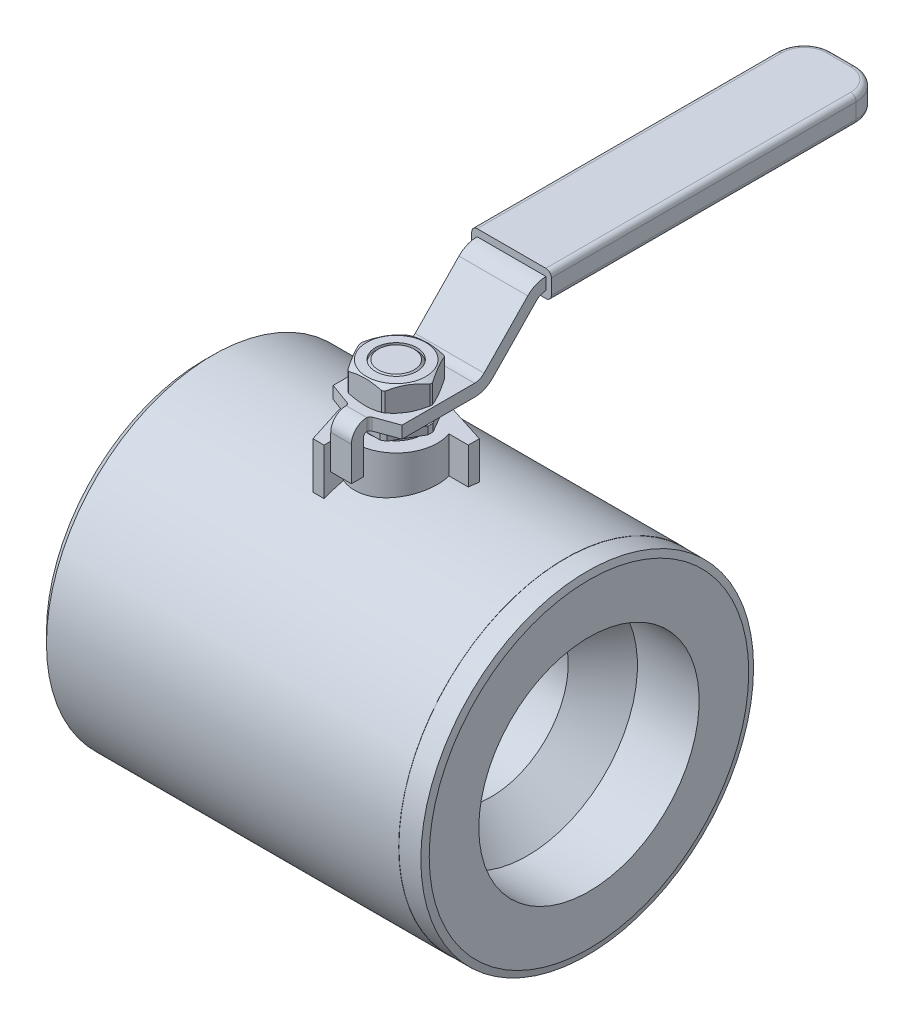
ISO-10303-21;
HEADER;
FILE_DESCRIPTION(('STEP AP214'),'2;1');
FILE_NAME('part.step','',(''),(''),'','','');
FILE_SCHEMA(('AUTOMOTIVE_DESIGN { 1 0 10303 214 1 1 1 1 }'));
ENDSEC;
DATA;
#1=APPLICATION_CONTEXT('core data for automotive mechanical design processes');
#2=APPLICATION_PROTOCOL_DEFINITION('international standard','automotive_design',2000,#1);
#3=PRODUCT_CONTEXT('',#1,'mechanical');
#4=PRODUCT('Part','Part','',(#3));
#5=PRODUCT_RELATED_PRODUCT_CATEGORY('part','',(#4));
#6=PRODUCT_DEFINITION_FORMATION('','',#4);
#7=PRODUCT_DEFINITION_CONTEXT('part definition',#1,'design');
#8=PRODUCT_DEFINITION('design','',#6,#7);
#9=PRODUCT_DEFINITION_SHAPE('','',#8);
#10=(LENGTH_UNIT() NAMED_UNIT(*) SI_UNIT(.MILLI.,.METRE.));
#11=(NAMED_UNIT(*) PLANE_ANGLE_UNIT() SI_UNIT($,.RADIAN.));
#12=(NAMED_UNIT(*) SI_UNIT($,.STERADIAN.) SOLID_ANGLE_UNIT());
#13=UNCERTAINTY_MEASURE_WITH_UNIT(LENGTH_MEASURE(1.E-05),#10,'distance_accuracy_value','');
#14=(GEOMETRIC_REPRESENTATION_CONTEXT(3) GLOBAL_UNCERTAINTY_ASSIGNED_CONTEXT((#13)) GLOBAL_UNIT_ASSIGNED_CONTEXT((#10,
#11,#12)) REPRESENTATION_CONTEXT('',''));
#15=CARTESIAN_POINT('',(0.,0.,0.));
#16=DIRECTION('',(0.,0.,1.));
#17=DIRECTION('',(1.,0.,0.));
#18=AXIS2_PLACEMENT_3D('',#15,#16,#17);
#19=CARTESIAN_POINT('',(7.9375,25.654,9.144));
#20=DIRECTION('',(1.,0.,0.));
#21=DIRECTION('',(0.,0.,-1.));
#22=AXIS2_PLACEMENT_3D('',#19,#20,#21);
#23=PLANE('',#22);
#24=DIRECTION('',(0.,1.,0.));
#25=VECTOR('',#24,1.);
#26=CARTESIAN_POINT('',(7.9375,16.51,6.58813224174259));
#27=LINE('',#26,#25);
#28=CARTESIAN_POINT('',(7.9375,26.416,6.58813224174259));
#29=VERTEX_POINT('',#28);
#30=CARTESIAN_POINT('',(7.9375,29.21,6.58813224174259));
#31=VERTEX_POINT('',#30);
#32=EDGE_CURVE('E493',#29,#31,#27,.T.);
#33=ORIENTED_EDGE('',*,*,#32,.F.);
#34=DIRECTION('',(0.,0.,-1.));
#35=VECTOR('',#34,1.);
#36=CARTESIAN_POINT('',(7.9375,26.416,9.144));
#37=LINE('',#36,#35);
#38=CARTESIAN_POINT('',(7.9375,26.416,-10.1410111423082));
#39=VERTEX_POINT('',#38);
#40=EDGE_CURVE('E534',#29,#39,#37,.T.);
#41=ORIENTED_EDGE('',*,*,#40,.T.);
#42=CARTESIAN_POINT('',(7.9375,32.258,-10.1410111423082));
#43=DIRECTION('',(1.,0.,0.));
#44=DIRECTION('',(0.,0.,1.));
#45=AXIS2_PLACEMENT_3D('',#42,#43,#44);
#46=CIRCLE('',#45,5.842);
#47=CARTESIAN_POINT('',(7.9375,28.1885745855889,-14.3325193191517));
#48=VERTEX_POINT('',#47);
#49=EDGE_CURVE('E536',#39,#48,#46,.T.);
#50=ORIENTED_EDGE('',*,*,#49,.T.);
#51=DIRECTION('',(0.,0.717478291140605,-0.696580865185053));
#52=VECTOR('',#51,1.);
#53=CARTESIAN_POINT('',(7.9375,28.1885745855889,-14.3325193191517));
#54=LINE('',#53,#52);
#55=CARTESIAN_POINT('',(7.9375,38.572178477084,-24.4136881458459));
#56=VERTEX_POINT('',#55);
#57=EDGE_CURVE('E539',#48,#56,#54,.T.);
#58=ORIENTED_EDGE('',*,*,#57,.T.);
#59=CARTESIAN_POINT('',(7.9375,36.449,-26.6005619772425));
#60=DIRECTION('',(-1.,0.,0.));
#61=DIRECTION('',(0.,0.,-1.));
#62=AXIS2_PLACEMENT_3D('',#59,#60,#61);
#63=CIRCLE('',#62,3.048);
#64=CARTESIAN_POINT('',(7.9375,39.497,-26.6005619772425));
#65=VERTEX_POINT('',#64);
#66=EDGE_CURVE('E541',#56,#65,#63,.T.);
#67=ORIENTED_EDGE('',*,*,#66,.T.);
#68=DIRECTION('',(0.,1.,0.));
#69=VECTOR('',#68,1.);
#70=CARTESIAN_POINT('',(7.9375,25.654,-26.6005619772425));
#71=LINE('',#70,#69);
#72=CARTESIAN_POINT('',(7.9375,42.291,-26.6005619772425));
#73=VERTEX_POINT('',#72);
#74=EDGE_CURVE('E531',#65,#73,#71,.T.);
#75=ORIENTED_EDGE('',*,*,#74,.T.);
#76=CARTESIAN_POINT('',(7.9375,36.449,-26.6005619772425));
#77=DIRECTION('',(1.,0.,0.));
#78=DIRECTION('',(0.,0.,-1.));
#79=AXIS2_PLACEMENT_3D('',#76,#77,#78);
#80=CIRCLE('',#79,5.842);
#81=CARTESIAN_POINT('',(7.9375,40.5184254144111,-22.4090538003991));
#82=VERTEX_POINT('',#81);
#83=EDGE_CURVE('E543',#73,#82,#80,.T.);
#84=ORIENTED_EDGE('',*,*,#83,.T.);
#85=DIRECTION('',(0.,-0.717478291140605,0.696580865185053));
#86=VECTOR('',#85,1.);
#87=CARTESIAN_POINT('',(7.9375,30.134821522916,-12.3278849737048));
#88=LINE('',#87,#86);
#89=CARTESIAN_POINT('',(7.9375,30.134821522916,-12.3278849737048));
#90=VERTEX_POINT('',#89);
#91=EDGE_CURVE('E545',#82,#90,#88,.T.);
#92=ORIENTED_EDGE('',*,*,#91,.T.);
#93=CARTESIAN_POINT('',(7.9375,32.258,-10.1410111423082));
#94=DIRECTION('',(-1.,0.,0.));
#95=DIRECTION('',(0.,0.,1.));
#96=AXIS2_PLACEMENT_3D('',#93,#94,#95);
#97=CIRCLE('',#96,3.048);
#98=CARTESIAN_POINT('',(7.9375,29.21,-10.1410111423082));
#99=VERTEX_POINT('',#98);
#100=EDGE_CURVE('E547',#90,#99,#97,.T.);
#101=ORIENTED_EDGE('',*,*,#100,.T.);
#102=DIRECTION('',(0.,0.,1.));
#103=VECTOR('',#102,1.);
#104=CARTESIAN_POINT('',(7.9375,29.21,9.144));
#105=LINE('',#104,#103);
#106=EDGE_CURVE('E549',#99,#31,#105,.T.);
#107=ORIENTED_EDGE('',*,*,#106,.T.);
#108=EDGE_LOOP('',(#33,#41,#50,#58,#67,#75,#84,#92,#101,#107));
#109=FACE_BOUND('',#108,.T.);
#110=ADVANCED_FACE('F36',(#109),#23,.T.);
#111=CARTESIAN_POINT('',(-7.9375,25.654,9.144));
#112=DIRECTION('',(1.,0.,0.));
#113=DIRECTION('',(0.,0.,-1.));
#114=AXIS2_PLACEMENT_3D('',#111,#112,#113);
#115=PLANE('',#114);
#116=DIRECTION('',(0.,0.,-1.));
#117=VECTOR('',#116,1.);
#118=CARTESIAN_POINT('',(-7.9375,26.416,9.144));
#119=LINE('',#118,#117);
#120=CARTESIAN_POINT('',(-7.9375,26.416,6.58813224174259));
#121=VERTEX_POINT('',#120);
#122=CARTESIAN_POINT('',(-7.9375,26.416,-10.1410111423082));
#123=VERTEX_POINT('',#122);
#124=EDGE_CURVE('E533',#121,#123,#119,.T.);
#125=ORIENTED_EDGE('',*,*,#124,.F.);
#126=DIRECTION('',(0.,1.,0.));
#127=VECTOR('',#126,1.);
#128=CARTESIAN_POINT('',(-7.9375,16.51,6.58813224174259));
#129=LINE('',#128,#127);
#130=CARTESIAN_POINT('',(-7.9375,29.21,6.58813224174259));
#131=VERTEX_POINT('',#130);
#132=EDGE_CURVE('E461',#121,#131,#129,.T.);
#133=ORIENTED_EDGE('',*,*,#132,.T.);
#134=DIRECTION('',(0.,0.,1.));
#135=VECTOR('',#134,1.);
#136=CARTESIAN_POINT('',(-7.9375,29.21,9.144));
#137=LINE('',#136,#135);
#138=CARTESIAN_POINT('',(-7.9375,29.21,-10.1410111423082));
#139=VERTEX_POINT('',#138);
#140=EDGE_CURVE('E537',#139,#131,#137,.T.);
#141=ORIENTED_EDGE('',*,*,#140,.F.);
#142=CARTESIAN_POINT('',(-7.9375,32.258,-10.1410111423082));
#143=DIRECTION('',(-1.,0.,0.));
#144=DIRECTION('',(0.,0.,1.));
#145=AXIS2_PLACEMENT_3D('',#142,#143,#144);
#146=CIRCLE('',#145,3.048);
#147=CARTESIAN_POINT('',(-7.9375,30.134821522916,-12.3278849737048));
#148=VERTEX_POINT('',#147);
#149=EDGE_CURVE('E565',#148,#139,#146,.T.);
#150=ORIENTED_EDGE('',*,*,#149,.F.);
#151=DIRECTION('',(0.,-0.717478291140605,0.696580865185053));
#152=VECTOR('',#151,1.);
#153=CARTESIAN_POINT('',(-7.9375,30.134821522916,-12.3278849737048));
#154=LINE('',#153,#152);
#155=CARTESIAN_POINT('',(-7.9375,40.5184254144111,-22.4090538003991));
#156=VERTEX_POINT('',#155);
#157=EDGE_CURVE('E563',#156,#148,#154,.T.);
#158=ORIENTED_EDGE('',*,*,#157,.F.);
#159=CARTESIAN_POINT('',(-7.9375,36.449,-26.6005619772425));
#160=DIRECTION('',(1.,0.,0.));
#161=DIRECTION('',(0.,0.,-1.));
#162=AXIS2_PLACEMENT_3D('',#159,#160,#161);
#163=CIRCLE('',#162,5.842);
#164=CARTESIAN_POINT('',(-7.9375,42.291,-26.6005619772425));
#165=VERTEX_POINT('',#164);
#166=EDGE_CURVE('E561',#165,#156,#163,.T.);
#167=ORIENTED_EDGE('',*,*,#166,.F.);
#168=DIRECTION('',(0.,1.,0.));
#169=VECTOR('',#168,1.);
#170=CARTESIAN_POINT('',(-7.9375,25.654,-26.6005619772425));
#171=LINE('',#170,#169);
#172=CARTESIAN_POINT('',(-7.9375,39.497,-26.6005619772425));
#173=VERTEX_POINT('',#172);
#174=EDGE_CURVE('E1968',#173,#165,#171,.T.);
#175=ORIENTED_EDGE('',*,*,#174,.F.);
#176=CARTESIAN_POINT('',(-7.9375,36.449,-26.6005619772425));
#177=DIRECTION('',(-1.,0.,0.));
#178=DIRECTION('',(0.,0.,-1.));
#179=AXIS2_PLACEMENT_3D('',#176,#177,#178);
#180=CIRCLE('',#179,3.048);
#181=CARTESIAN_POINT('',(-7.9375,38.572178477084,-24.4136881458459));
#182=VERTEX_POINT('',#181);
#183=EDGE_CURVE('E558',#182,#173,#180,.T.);
#184=ORIENTED_EDGE('',*,*,#183,.F.);
#185=DIRECTION('',(0.,0.717478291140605,-0.696580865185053));
#186=VECTOR('',#185,1.);
#187=CARTESIAN_POINT('',(-7.9375,28.1885745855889,-14.3325193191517));
#188=LINE('',#187,#186);
#189=CARTESIAN_POINT('',(-7.9375,28.1885745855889,-14.3325193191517));
#190=VERTEX_POINT('',#189);
#191=EDGE_CURVE('E556',#190,#182,#188,.T.);
#192=ORIENTED_EDGE('',*,*,#191,.F.);
#193=CARTESIAN_POINT('',(-7.9375,32.258,-10.1410111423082));
#194=DIRECTION('',(1.,0.,0.));
#195=DIRECTION('',(0.,0.,1.));
#196=AXIS2_PLACEMENT_3D('',#193,#194,#195);
#197=CIRCLE('',#196,5.842);
#198=EDGE_CURVE('E554',#123,#190,#197,.T.);
#199=ORIENTED_EDGE('',*,*,#198,.F.);
#200=EDGE_LOOP('',(#125,#133,#141,#150,#158,#167,#175,#184,#192,#199));
#201=FACE_BOUND('',#200,.T.);
#202=ADVANCED_FACE('F979',(#201),#115,.F.);
#203=CARTESIAN_POINT('',(0.,12.7,0.));
#204=DIRECTION('',(0.,1.,0.));
#205=DIRECTION('',(-1.,0.,0.));
#206=AXIS2_PLACEMENT_3D('',#203,#204,#205);
#207=CYLINDRICAL_SURFACE('',#206,4.7625);
#208=CARTESIAN_POINT('',(0.,26.035,0.));
#209=DIRECTION('',(0.,1.,0.));
#210=DIRECTION('',(-1.,0.,0.));
#211=AXIS2_PLACEMENT_3D('',#208,#209,#210);
#212=CIRCLE('',#211,4.7625);
#213=CARTESIAN_POINT('',(-4.7625,26.035,0.));
#214=VERTEX_POINT('',#213);
#215=EDGE_CURVE('E762',#214,#214,#212,.T.);
#216=ORIENTED_EDGE('',*,*,#215,.T.);
#217=EDGE_LOOP('',(#216));
#218=FACE_BOUND('',#217,.T.);
#219=CARTESIAN_POINT('',(0.,26.416,0.));
#220=DIRECTION('',(0.,1.,0.));
#221=DIRECTION('',(0.,0.,1.));
#222=AXIS2_PLACEMENT_3D('',#219,#220,#221);
#223=CIRCLE('',#222,4.7625);
#224=CARTESIAN_POINT('',(0.,26.416,4.7625));
#225=VERTEX_POINT('',#224);
#226=EDGE_CURVE('E1966',#225,#225,#223,.T.);
#227=ORIENTED_EDGE('',*,*,#226,.F.);
#228=EDGE_LOOP('',(#227));
#229=FACE_BOUND('',#228,.T.);
#230=ADVANCED_FACE('F983',(#218,#229),#207,.T.);
#231=CARTESIAN_POINT('',(6.096,24.257,0.));
#232=DIRECTION('',(0.,1.,0.));
#233=DIRECTION('',(-1.,0.,0.));
#234=AXIS2_PLACEMENT_3D('',#231,#232,#233);
#235=PLANE('',#234);
#236=CARTESIAN_POINT('',(0.,24.257,0.));
#237=DIRECTION('',(0.,1.,0.));
#238=DIRECTION('',(-1.,0.,0.));
#239=AXIS2_PLACEMENT_3D('',#236,#237,#238);
#240=CIRCLE('',#239,6.096);
#241=CARTESIAN_POINT('',(-6.096,24.257,0.));
#242=VERTEX_POINT('',#241);
#243=EDGE_CURVE('E775',#242,#242,#240,.T.);
#244=ORIENTED_EDGE('',*,*,#243,.T.);
#245=EDGE_LOOP('',(#244));
#246=FACE_BOUND('',#245,.T.);
#247=DIRECTION('',(0.5,0.,0.866025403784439));
#248=VECTOR('',#247,1.);
#249=CARTESIAN_POINT('',(-4.66266897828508,24.257,6.21152043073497));
#250=LINE('',#249,#248);
#251=CARTESIAN_POINT('',(-7.91660699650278,24.257,0.575534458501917));
#252=VERTEX_POINT('',#251);
#253=CARTESIAN_POINT('',(-4.45673096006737,24.257,6.56821554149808));
#254=VERTEX_POINT('',#253);
#255=EDGE_CURVE('E738',#252,#254,#250,.T.);
#256=ORIENTED_EDGE('',*,*,#255,.F.);
#257=CARTESIAN_POINT('',(0.,24.257,0.));
#258=DIRECTION('',(0.,1.,0.));
#259=DIRECTION('',(-1.,0.,0.));
#260=AXIS2_PLACEMENT_3D('',#257,#258,#259);
#261=CIRCLE('',#260,7.9375);
#262=CARTESIAN_POINT('',(-7.91660699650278,24.257,-0.575534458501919));
#263=VERTEX_POINT('',#262);
#264=EDGE_CURVE('E770',#263,#252,#261,.T.);
#265=ORIENTED_EDGE('',*,*,#264,.F.);
#266=DIRECTION('',(-0.5,0.,0.866025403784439));
#267=VECTOR('',#266,1.);
#268=CARTESIAN_POINT('',(-4.66266897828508,24.257,-6.21152043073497));
#269=LINE('',#268,#267);
#270=CARTESIAN_POINT('',(-4.45673096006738,24.257,-6.56821554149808));
#271=VERTEX_POINT('',#270);
#272=EDGE_CURVE('E721',#271,#263,#269,.T.);
#273=ORIENTED_EDGE('',*,*,#272,.F.);
#274=CARTESIAN_POINT('',(-3.45987603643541,24.257,-7.14375));
#275=VERTEX_POINT('',#274);
#276=EDGE_CURVE('E773',#275,#271,#261,.T.);
#277=ORIENTED_EDGE('',*,*,#276,.F.);
#278=DIRECTION('',(-1.,0.,0.));
#279=VECTOR('',#278,1.);
#280=CARTESIAN_POINT('',(6.096,24.257,-7.14375));
#281=LINE('',#280,#279);
#282=CARTESIAN_POINT('',(3.45987603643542,24.257,-7.14375));
#283=VERTEX_POINT('',#282);
#284=EDGE_CURVE('E1837',#283,#275,#281,.T.);
#285=ORIENTED_EDGE('',*,*,#284,.F.);
#286=CARTESIAN_POINT('',(4.45673096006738,24.257,-6.56821554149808));
#287=VERTEX_POINT('',#286);
#288=EDGE_CURVE('E1820',#287,#283,#261,.T.);
#289=ORIENTED_EDGE('',*,*,#288,.F.);
#290=DIRECTION('',(-0.5,0.,-0.866025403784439));
#291=VECTOR('',#290,1.);
#292=CARTESIAN_POINT('',(7.71066897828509,24.257,-0.932229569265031));
#293=LINE('',#292,#291);
#294=CARTESIAN_POINT('',(7.91660699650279,24.257,-0.575534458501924));
#295=VERTEX_POINT('',#294);
#296=EDGE_CURVE('E1887',#295,#287,#293,.T.);
#297=ORIENTED_EDGE('',*,*,#296,.F.);
#298=CARTESIAN_POINT('',(7.91660699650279,24.257,0.575534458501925));
#299=VERTEX_POINT('',#298);
#300=EDGE_CURVE('E1816',#299,#295,#261,.T.);
#301=ORIENTED_EDGE('',*,*,#300,.F.);
#302=DIRECTION('',(0.5,0.,-0.866025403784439));
#303=VECTOR('',#302,1.);
#304=CARTESIAN_POINT('',(7.71066897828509,24.257,0.932229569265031));
#305=LINE('',#304,#303);
#306=CARTESIAN_POINT('',(4.45673096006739,24.257,6.56821554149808));
#307=VERTEX_POINT('',#306);
#308=EDGE_CURVE('E1863',#307,#299,#305,.T.);
#309=ORIENTED_EDGE('',*,*,#308,.F.);
#310=CARTESIAN_POINT('',(3.45987603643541,24.257,7.14375));
#311=VERTEX_POINT('',#310);
#312=EDGE_CURVE('E1814',#311,#307,#261,.T.);
#313=ORIENTED_EDGE('',*,*,#312,.F.);
#314=DIRECTION('',(1.,0.,0.));
#315=VECTOR('',#314,1.);
#316=CARTESIAN_POINT('',(6.09600000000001,24.257,7.14375));
#317=LINE('',#316,#315);
#318=CARTESIAN_POINT('',(-3.4598760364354,24.257,7.14375));
#319=VERTEX_POINT('',#318);
#320=EDGE_CURVE('E1813',#319,#311,#317,.T.);
#321=ORIENTED_EDGE('',*,*,#320,.F.);
#322=EDGE_CURVE('E774',#254,#319,#261,.T.);
#323=ORIENTED_EDGE('',*,*,#322,.F.);
#324=EDGE_LOOP('',(#256,#265,#273,#277,#285,#289,#297,#301,#309,#313,#321,#323));
#325=FACE_BOUND('',#324,.T.);
#326=ADVANCED_FACE('F1610',(#246,#325),#235,.F.);
#327=CARTESIAN_POINT('',(0.,12.7,0.));
#328=DIRECTION('',(0.,1.,0.));
#329=DIRECTION('',(-1.,0.,0.));
#330=AXIS2_PLACEMENT_3D('',#327,#328,#329);
#331=CYLINDRICAL_SURFACE('',#330,7.9375);
#332=DIRECTION('',(0.,1.,0.));
#333=VECTOR('',#332,1.);
#334=CARTESIAN_POINT('',(-4.45673096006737,12.7,6.56821554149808));
#335=LINE('',#334,#333);
#336=CARTESIAN_POINT('',(-4.45673096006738,26.035,6.56821554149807));
#337=VERTEX_POINT('',#336);
#338=EDGE_CURVE('E736',#254,#337,#335,.T.);
#339=ORIENTED_EDGE('',*,*,#338,.F.);
#340=ORIENTED_EDGE('',*,*,#322,.T.);
#341=DIRECTION('',(0.,1.,0.));
#342=VECTOR('',#341,1.);
#343=CARTESIAN_POINT('',(-3.4598760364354,12.7,7.14375));
#344=LINE('',#343,#342);
#345=CARTESIAN_POINT('',(-3.4598760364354,26.035,7.14375));
#346=VERTEX_POINT('',#345);
#347=EDGE_CURVE('E1856',#346,#319,#344,.F.);
#348=ORIENTED_EDGE('',*,*,#347,.F.);
#349=CARTESIAN_POINT('',(0.,26.035,0.));
#350=DIRECTION('',(0.,1.,0.));
#351=DIRECTION('',(-1.,0.,0.));
#352=AXIS2_PLACEMENT_3D('',#349,#350,#351);
#353=CIRCLE('',#352,7.9375);
#354=EDGE_CURVE('E769',#337,#346,#353,.T.);
#355=ORIENTED_EDGE('',*,*,#354,.F.);
#356=EDGE_LOOP('',(#339,#340,#348,#355));
#357=FACE_BOUND('',#356,.T.);
#358=ADVANCED_FACE('F1616',(#357),#331,.T.);
#359=DIRECTION('',(0.,1.,0.));
#360=VECTOR('',#359,1.);
#361=CARTESIAN_POINT('',(-7.91660699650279,12.7,0.575534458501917));
#362=LINE('',#361,#360);
#363=CARTESIAN_POINT('',(-7.91660699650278,26.035,0.57553445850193));
#364=VERTEX_POINT('',#363);
#365=EDGE_CURVE('E734',#364,#252,#362,.F.);
#366=ORIENTED_EDGE('',*,*,#365,.F.);
#367=CARTESIAN_POINT('',(-7.91660699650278,26.035,-0.575534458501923));
#368=VERTEX_POINT('',#367);
#369=EDGE_CURVE('E765',#368,#364,#353,.T.);
#370=ORIENTED_EDGE('',*,*,#369,.F.);
#371=DIRECTION('',(0.,1.,0.));
#372=VECTOR('',#371,1.);
#373=CARTESIAN_POINT('',(-7.91660699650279,12.7,-0.575534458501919));
#374=LINE('',#373,#372);
#375=EDGE_CURVE('E719',#263,#368,#374,.T.);
#376=ORIENTED_EDGE('',*,*,#375,.F.);
#377=ORIENTED_EDGE('',*,*,#264,.T.);
#378=EDGE_LOOP('',(#366,#370,#376,#377));
#379=FACE_BOUND('',#378,.T.);
#380=ADVANCED_FACE('F1624',(#379),#331,.T.);
#381=DIRECTION('',(0.,1.,0.));
#382=VECTOR('',#381,1.);
#383=CARTESIAN_POINT('',(-4.45673096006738,12.7,-6.56821554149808));
#384=LINE('',#383,#382);
#385=CARTESIAN_POINT('',(-4.45673096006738,26.035,-6.56821554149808));
#386=VERTEX_POINT('',#385);
#387=EDGE_CURVE('E717',#386,#271,#384,.F.);
#388=ORIENTED_EDGE('',*,*,#387,.F.);
#389=CARTESIAN_POINT('',(-3.4598760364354,26.035,-7.14375));
#390=VERTEX_POINT('',#389);
#391=EDGE_CURVE('E768',#390,#386,#353,.T.);
#392=ORIENTED_EDGE('',*,*,#391,.F.);
#393=DIRECTION('',(0.,1.,0.));
#394=VECTOR('',#393,1.);
#395=CARTESIAN_POINT('',(-3.45987603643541,12.7,-7.14375));
#396=LINE('',#395,#394);
#397=EDGE_CURVE('E1834',#275,#390,#396,.T.);
#398=ORIENTED_EDGE('',*,*,#397,.F.);
#399=ORIENTED_EDGE('',*,*,#276,.T.);
#400=EDGE_LOOP('',(#388,#392,#398,#399));
#401=FACE_BOUND('',#400,.T.);
#402=ADVANCED_FACE('F1633',(#401),#331,.T.);
#403=DIRECTION('',(0.,1.,0.));
#404=VECTOR('',#403,1.);
#405=CARTESIAN_POINT('',(3.45987603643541,12.7,-7.14375));
#406=LINE('',#405,#404);
#407=CARTESIAN_POINT('',(3.45987603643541,26.035,-7.14375));
#408=VERTEX_POINT('',#407);
#409=EDGE_CURVE('E1899',#408,#283,#406,.F.);
#410=ORIENTED_EDGE('',*,*,#409,.F.);
#411=CARTESIAN_POINT('',(4.45673096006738,26.035,-6.56821554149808));
#412=VERTEX_POINT('',#411);
#413=EDGE_CURVE('E1845',#412,#408,#353,.T.);
#414=ORIENTED_EDGE('',*,*,#413,.F.);
#415=DIRECTION('',(0.,1.,0.));
#416=VECTOR('',#415,1.);
#417=CARTESIAN_POINT('',(4.45673096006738,12.7,-6.56821554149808));
#418=LINE('',#417,#416);
#419=EDGE_CURVE('E1885',#287,#412,#418,.T.);
#420=ORIENTED_EDGE('',*,*,#419,.F.);
#421=ORIENTED_EDGE('',*,*,#288,.T.);
#422=EDGE_LOOP('',(#410,#414,#420,#421));
#423=FACE_BOUND('',#422,.T.);
#424=ADVANCED_FACE('F1640',(#423),#331,.T.);
#425=DIRECTION('',(0.,1.,0.));
#426=VECTOR('',#425,1.);
#427=CARTESIAN_POINT('',(7.91660699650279,12.7,-0.575534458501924));
#428=LINE('',#427,#426);
#429=CARTESIAN_POINT('',(7.91660699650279,26.035,-0.575534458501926));
#430=VERTEX_POINT('',#429);
#431=EDGE_CURVE('E1883',#430,#295,#428,.F.);
#432=ORIENTED_EDGE('',*,*,#431,.F.);
#433=CARTESIAN_POINT('',(7.91660699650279,26.035,0.57553445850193));
#434=VERTEX_POINT('',#433);
#435=EDGE_CURVE('E1846',#434,#430,#353,.T.);
#436=ORIENTED_EDGE('',*,*,#435,.F.);
#437=DIRECTION('',(0.,1.,0.));
#438=VECTOR('',#437,1.);
#439=CARTESIAN_POINT('',(7.91660699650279,12.7,0.575534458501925));
#440=LINE('',#439,#438);
#441=EDGE_CURVE('E1860',#299,#434,#440,.T.);
#442=ORIENTED_EDGE('',*,*,#441,.F.);
#443=ORIENTED_EDGE('',*,*,#300,.T.);
#444=EDGE_LOOP('',(#432,#436,#442,#443));
#445=FACE_BOUND('',#444,.T.);
#446=ADVANCED_FACE('F1647',(#445),#331,.T.);
#447=DIRECTION('',(0.,1.,0.));
#448=VECTOR('',#447,1.);
#449=CARTESIAN_POINT('',(4.45673096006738,12.7,6.56821554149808));
#450=LINE('',#449,#448);
#451=CARTESIAN_POINT('',(4.45673096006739,26.035,6.56821554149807));
#452=VERTEX_POINT('',#451);
#453=EDGE_CURVE('E1858',#452,#307,#450,.F.);
#454=ORIENTED_EDGE('',*,*,#453,.F.);
#455=CARTESIAN_POINT('',(3.45987603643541,26.035,7.14375));
#456=VERTEX_POINT('',#455);
#457=EDGE_CURVE('E1850',#456,#452,#353,.T.);
#458=ORIENTED_EDGE('',*,*,#457,.F.);
#459=DIRECTION('',(0.,1.,0.));
#460=VECTOR('',#459,1.);
#461=CARTESIAN_POINT('',(3.45987603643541,12.7,7.14375));
#462=LINE('',#461,#460);
#463=EDGE_CURVE('E1857',#311,#456,#462,.T.);
#464=ORIENTED_EDGE('',*,*,#463,.F.);
#465=ORIENTED_EDGE('',*,*,#312,.T.);
#466=EDGE_LOOP('',(#454,#458,#464,#465));
#467=FACE_BOUND('',#466,.T.);
#468=ADVANCED_FACE('F1627',(#467),#331,.T.);
#469=CARTESIAN_POINT('',(7.9375,26.035,0.));
#470=DIRECTION('',(0.,-1.,0.));
#471=DIRECTION('',(1.,0.,0.));
#472=AXIS2_PLACEMENT_3D('',#469,#470,#471);
#473=PLANE('',#472);
#474=ORIENTED_EDGE('',*,*,#215,.F.);
#475=EDGE_LOOP('',(#474));
#476=FACE_BOUND('',#475,.T.);
#477=DIRECTION('',(-0.5,0.,-0.866025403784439));
#478=VECTOR('',#477,1.);
#479=CARTESIAN_POINT('',(-4.20229397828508,26.035,7.00891332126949));
#480=LINE('',#479,#478);
#481=EDGE_CURVE('E732',#337,#364,#480,.T.);
#482=ORIENTED_EDGE('',*,*,#481,.F.);
#483=ORIENTED_EDGE('',*,*,#354,.T.);
#484=DIRECTION('',(-1.,0.,0.));
#485=VECTOR('',#484,1.);
#486=CARTESIAN_POINT('',(7.9375,26.035,7.14375));
#487=LINE('',#486,#485);
#488=EDGE_CURVE('E624',#456,#346,#487,.T.);
#489=ORIENTED_EDGE('',*,*,#488,.F.);
#490=ORIENTED_EDGE('',*,*,#457,.T.);
#491=DIRECTION('',(-0.5,0.,0.866025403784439));
#492=VECTOR('',#491,1.);
#493=CARTESIAN_POINT('',(8.17104397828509,26.035,0.13483667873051));
#494=LINE('',#493,#492);
#495=EDGE_CURVE('E1861',#434,#452,#494,.T.);
#496=ORIENTED_EDGE('',*,*,#495,.F.);
#497=ORIENTED_EDGE('',*,*,#435,.T.);
#498=DIRECTION('',(0.5,0.,0.866025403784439));
#499=VECTOR('',#498,1.);
#500=CARTESIAN_POINT('',(8.17104397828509,26.035,-0.134836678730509));
#501=LINE('',#500,#499);
#502=EDGE_CURVE('E1879',#412,#430,#501,.T.);
#503=ORIENTED_EDGE('',*,*,#502,.F.);
#504=ORIENTED_EDGE('',*,*,#413,.T.);
#505=DIRECTION('',(1.,0.,0.));
#506=VECTOR('',#505,1.);
#507=CARTESIAN_POINT('',(7.9375,26.035,-7.14375));
#508=LINE('',#507,#506);
#509=EDGE_CURVE('E1844',#390,#408,#508,.T.);
#510=ORIENTED_EDGE('',*,*,#509,.F.);
#511=ORIENTED_EDGE('',*,*,#391,.T.);
#512=DIRECTION('',(0.5,0.,-0.866025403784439));
#513=VECTOR('',#512,1.);
#514=CARTESIAN_POINT('',(-4.20229397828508,26.035,-7.00891332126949));
#515=LINE('',#514,#513);
#516=EDGE_CURVE('E713',#368,#386,#515,.T.);
#517=ORIENTED_EDGE('',*,*,#516,.F.);
#518=ORIENTED_EDGE('',*,*,#369,.T.);
#519=EDGE_LOOP('',(#482,#483,#489,#490,#496,#497,#503,#504,#510,#511,#517,#518));
#520=FACE_BOUND('',#519,.T.);
#521=ADVANCED_FACE('F1660',(#476,#520),#473,.F.);
#522=CARTESIAN_POINT('',(0.,12.7,0.));
#523=DIRECTION('',(0.,1.,0.));
#524=DIRECTION('',(-1.,0.,0.));
#525=AXIS2_PLACEMENT_3D('',#522,#523,#524);
#526=CYLINDRICAL_SURFACE('',#525,6.096);
#527=CARTESIAN_POINT('',(0.,23.114,0.));
#528=DIRECTION('',(0.,1.,0.));
#529=DIRECTION('',(0.,0.,1.));
#530=AXIS2_PLACEMENT_3D('',#527,#528,#529);
#531=CIRCLE('',#530,6.096);
#532=CARTESIAN_POINT('',(0.,23.114,6.096));
#533=VERTEX_POINT('',#532);
#534=EDGE_CURVE('E448',#533,#533,#531,.T.);
#535=ORIENTED_EDGE('',*,*,#534,.T.);
#536=EDGE_LOOP('',(#535));
#537=FACE_BOUND('',#536,.T.);
#538=ORIENTED_EDGE('',*,*,#243,.F.);
#539=EDGE_LOOP('',(#538));
#540=FACE_BOUND('',#539,.T.);
#541=ADVANCED_FACE('F636',(#537,#540),#526,.T.);
#542=CARTESIAN_POINT('',(-4.12444598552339,19.812,7.14375));
#543=DIRECTION('',(0.,0.,1.));
#544=DIRECTION('',(1.,0.,0.));
#545=AXIS2_PLACEMENT_3D('',#542,#543,#544);
#546=PLANE('',#545);
#547=ORIENTED_EDGE('',*,*,#320,.T.);
#548=ORIENTED_EDGE('',*,*,#463,.T.);
#549=ORIENTED_EDGE('',*,*,#488,.T.);
#550=ORIENTED_EDGE('',*,*,#347,.T.);
#551=EDGE_LOOP('',(#547,#548,#549,#550));
#552=FACE_BOUND('',#551,.T.);
#553=ADVANCED_FACE('F630',(#552),#546,.T.);
#554=CARTESIAN_POINT('',(4.12444598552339,19.812,7.14375));
#555=DIRECTION('',(0.866025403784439,0.,0.5));
#556=DIRECTION('',(0.5,0.,-0.866025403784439));
#557=AXIS2_PLACEMENT_3D('',#554,#555,#556);
#558=PLANE('',#557);
#559=ORIENTED_EDGE('',*,*,#308,.T.);
#560=ORIENTED_EDGE('',*,*,#441,.T.);
#561=ORIENTED_EDGE('',*,*,#495,.T.);
#562=ORIENTED_EDGE('',*,*,#453,.T.);
#563=EDGE_LOOP('',(#559,#560,#561,#562));
#564=FACE_BOUND('',#563,.T.);
#565=ADVANCED_FACE('F635',(#564),#558,.T.);
#566=CARTESIAN_POINT('',(8.24889197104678,19.812,0.));
#567=DIRECTION('',(0.866025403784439,0.,-0.5));
#568=DIRECTION('',(-0.5,0.,-0.866025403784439));
#569=AXIS2_PLACEMENT_3D('',#566,#567,#568);
#570=PLANE('',#569);
#571=ORIENTED_EDGE('',*,*,#296,.T.);
#572=ORIENTED_EDGE('',*,*,#419,.T.);
#573=ORIENTED_EDGE('',*,*,#502,.T.);
#574=ORIENTED_EDGE('',*,*,#431,.T.);
#575=EDGE_LOOP('',(#571,#572,#573,#574));
#576=FACE_BOUND('',#575,.T.);
#577=ADVANCED_FACE('F1388',(#576),#570,.T.);
#578=CARTESIAN_POINT('',(4.12444598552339,19.812,-7.14375));
#579=DIRECTION('',(0.,0.,-1.));
#580=DIRECTION('',(-1.,0.,0.));
#581=AXIS2_PLACEMENT_3D('',#578,#579,#580);
#582=PLANE('',#581);
#583=ORIENTED_EDGE('',*,*,#284,.T.);
#584=ORIENTED_EDGE('',*,*,#397,.T.);
#585=ORIENTED_EDGE('',*,*,#509,.T.);
#586=ORIENTED_EDGE('',*,*,#409,.T.);
#587=EDGE_LOOP('',(#583,#584,#585,#586));
#588=FACE_BOUND('',#587,.T.);
#589=ADVANCED_FACE('F699',(#588),#582,.T.);
#590=CARTESIAN_POINT('',(-4.12444598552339,19.812,-7.14375));
#591=DIRECTION('',(-0.866025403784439,0.,-0.5));
#592=DIRECTION('',(-0.5,0.,0.866025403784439));
#593=AXIS2_PLACEMENT_3D('',#590,#591,#592);
#594=PLANE('',#593);
#595=ORIENTED_EDGE('',*,*,#272,.T.);
#596=ORIENTED_EDGE('',*,*,#375,.T.);
#597=ORIENTED_EDGE('',*,*,#516,.T.);
#598=ORIENTED_EDGE('',*,*,#387,.T.);
#599=EDGE_LOOP('',(#595,#596,#597,#598));
#600=FACE_BOUND('',#599,.T.);
#601=ADVANCED_FACE('F695',(#600),#594,.T.);
#602=CARTESIAN_POINT('',(-8.24889197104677,19.812,0.));
#603=DIRECTION('',(-0.866025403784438,0.,0.5));
#604=DIRECTION('',(0.5,0.,0.866025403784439));
#605=AXIS2_PLACEMENT_3D('',#602,#603,#604);
#606=PLANE('',#605);
#607=ORIENTED_EDGE('',*,*,#255,.T.);
#608=ORIENTED_EDGE('',*,*,#338,.T.);
#609=ORIENTED_EDGE('',*,*,#481,.T.);
#610=ORIENTED_EDGE('',*,*,#365,.T.);
#611=EDGE_LOOP('',(#607,#608,#609,#610));
#612=FACE_BOUND('',#611,.T.);
#613=ADVANCED_FACE('F641',(#612),#606,.T.);
#614=CARTESIAN_POINT('',(7.9375,26.416,9.144));
#615=DIRECTION('',(0.,1.,0.));
#616=DIRECTION('',(0.,0.,1.));
#617=AXIS2_PLACEMENT_3D('',#614,#615,#616);
#618=PLANE('',#617);
#619=CARTESIAN_POINT('',(-3.14325,26.416,9.144));
#620=DIRECTION('',(0.,1.,0.));
#621=DIRECTION('',(0.,0.,1.));
#622=AXIS2_PLACEMENT_3D('',#619,#620,#621);
#623=CIRCLE('',#622,0.762);
#624=CARTESIAN_POINT('',(-2.38125,26.416,9.144));
#625=VERTEX_POINT('',#624);
#626=CARTESIAN_POINT('',(-2.88263065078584,26.416,8.42795422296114));
#627=VERTEX_POINT('',#626);
#628=EDGE_CURVE('E481',#625,#627,#623,.T.);
#629=ORIENTED_EDGE('',*,*,#628,.T.);
#630=DIRECTION('',(-0.939692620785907,0.,-0.342020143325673));
#631=VECTOR('',#630,1.);
#632=CARTESIAN_POINT('',(6.90191783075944,26.416,11.9892386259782));
#633=LINE('',#632,#631);
#634=EDGE_CURVE('E484',#627,#121,#633,.T.);
#635=ORIENTED_EDGE('',*,*,#634,.T.);
#636=ORIENTED_EDGE('',*,*,#124,.T.);
#637=DIRECTION('',(-1.,0.,0.));
#638=VECTOR('',#637,1.);
#639=CARTESIAN_POINT('',(7.9375,26.416,-10.1410111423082));
#640=LINE('',#639,#638);
#641=EDGE_CURVE('E598',#39,#123,#640,.T.);
#642=ORIENTED_EDGE('',*,*,#641,.F.);
#643=ORIENTED_EDGE('',*,*,#40,.F.);
#644=DIRECTION('',(-0.939692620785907,0.,0.342020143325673));
#645=VECTOR('',#644,1.);
#646=CARTESIAN_POINT('',(7.1160599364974,26.416,6.88711197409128));
#647=LINE('',#646,#645);
#648=CARTESIAN_POINT('',(2.88263065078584,26.416,8.42795422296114));
#649=VERTEX_POINT('',#648);
#650=EDGE_CURVE('E514',#29,#649,#647,.T.);
#651=ORIENTED_EDGE('',*,*,#650,.T.);
#652=CARTESIAN_POINT('',(3.14325,26.416,9.144));
#653=DIRECTION('',(0.,1.,0.));
#654=DIRECTION('',(0.,0.,1.));
#655=AXIS2_PLACEMENT_3D('',#652,#653,#654);
#656=CIRCLE('',#655,0.762);
#657=CARTESIAN_POINT('',(2.38125,26.416,9.144));
#658=VERTEX_POINT('',#657);
#659=EDGE_CURVE('E511',#649,#658,#656,.T.);
#660=ORIENTED_EDGE('',*,*,#659,.T.);
#661=DIRECTION('',(-1.,0.,0.));
#662=VECTOR('',#661,1.);
#663=CARTESIAN_POINT('',(7.9375,26.416,9.144));
#664=LINE('',#663,#662);
#665=EDGE_CURVE('E601',#658,#625,#664,.T.);
#666=ORIENTED_EDGE('',*,*,#665,.T.);
#667=EDGE_LOOP('',(#629,#635,#636,#642,#643,#651,#660,#666));
#668=FACE_BOUND('',#667,.T.);
#669=ORIENTED_EDGE('',*,*,#226,.T.);
#670=EDGE_LOOP('',(#669));
#671=FACE_BOUND('',#670,.T.);
#672=ADVANCED_FACE('F998',(#668,#671),#618,.F.);
#673=CARTESIAN_POINT('',(7.9375,29.21,9.144));
#674=DIRECTION('',(0.,-1.,0.));
#675=DIRECTION('',(0.,0.,-1.));
#676=AXIS2_PLACEMENT_3D('',#673,#674,#675);
#677=PLANE('',#676);
#678=ORIENTED_EDGE('',*,*,#140,.T.);
#679=DIRECTION('',(-0.939692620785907,0.,-0.342020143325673));
#680=VECTOR('',#679,1.);
#681=CARTESIAN_POINT('',(-2.88263065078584,29.21,8.42795422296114));
#682=LINE('',#681,#680);
#683=CARTESIAN_POINT('',(-2.88263065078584,29.21,8.42795422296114));
#684=VERTEX_POINT('',#683);
#685=EDGE_CURVE('E451',#684,#131,#682,.T.);
#686=ORIENTED_EDGE('',*,*,#685,.F.);
#687=CARTESIAN_POINT('',(-3.14325,29.21,9.144));
#688=DIRECTION('',(0.,1.,0.));
#689=DIRECTION('',(0.,0.,-1.));
#690=AXIS2_PLACEMENT_3D('',#687,#688,#689);
#691=CIRCLE('',#690,0.762);
#692=CARTESIAN_POINT('',(-2.38125,29.21,9.144));
#693=VERTEX_POINT('',#692);
#694=EDGE_CURVE('E458',#693,#684,#691,.T.);
#695=ORIENTED_EDGE('',*,*,#694,.F.);
#696=DIRECTION('',(-1.,0.,0.));
#697=VECTOR('',#696,1.);
#698=CARTESIAN_POINT('',(7.9375,29.21,9.144));
#699=LINE('',#698,#697);
#700=CARTESIAN_POINT('',(2.38125,29.21,9.144));
#701=VERTEX_POINT('',#700);
#702=EDGE_CURVE('E574',#701,#693,#699,.T.);
#703=ORIENTED_EDGE('',*,*,#702,.F.);
#704=CARTESIAN_POINT('',(3.14325,29.21,9.144));
#705=DIRECTION('',(0.,1.,0.));
#706=DIRECTION('',(0.,0.,1.));
#707=AXIS2_PLACEMENT_3D('',#704,#705,#706);
#708=CIRCLE('',#707,0.762);
#709=CARTESIAN_POINT('',(2.88263065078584,29.21,8.42795422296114));
#710=VERTEX_POINT('',#709);
#711=EDGE_CURVE('E490',#710,#701,#708,.T.);
#712=ORIENTED_EDGE('',*,*,#711,.F.);
#713=DIRECTION('',(-0.939692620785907,0.,0.342020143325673));
#714=VECTOR('',#713,1.);
#715=CARTESIAN_POINT('',(2.88263065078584,29.21,8.42795422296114));
#716=LINE('',#715,#714);
#717=EDGE_CURVE('E487',#31,#710,#716,.T.);
#718=ORIENTED_EDGE('',*,*,#717,.F.);
#719=ORIENTED_EDGE('',*,*,#106,.F.);
#720=DIRECTION('',(-1.,0.,0.));
#721=VECTOR('',#720,1.);
#722=CARTESIAN_POINT('',(7.9375,29.21,-10.1410111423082));
#723=LINE('',#722,#721);
#724=EDGE_CURVE('E577',#99,#139,#723,.T.);
#725=ORIENTED_EDGE('',*,*,#724,.T.);
#726=EDGE_LOOP('',(#678,#686,#695,#703,#712,#718,#719,#725));
#727=FACE_BOUND('',#726,.T.);
#728=CARTESIAN_POINT('',(0.,29.21,0.));
#729=DIRECTION('',(0.,-1.,0.));
#730=DIRECTION('',(0.,0.,-1.));
#731=AXIS2_PLACEMENT_3D('',#728,#729,#730);
#732=CIRCLE('',#731,6.81990000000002);
#733=CARTESIAN_POINT('',(0.,29.21,-6.81990000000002));
#734=VERTEX_POINT('',#733);
#735=EDGE_CURVE('E610',#734,#734,#732,.T.);
#736=ORIENTED_EDGE('',*,*,#735,.T.);
#737=EDGE_LOOP('',(#736));
#738=FACE_BOUND('',#737,.T.);
#739=ADVANCED_FACE('F995',(#727,#738),#677,.F.);
#740=CARTESIAN_POINT('',(7.9375,17.78,9.906));
#741=DIRECTION('',(0.,1.,0.));
#742=DIRECTION('',(0.,0.,1.));
#743=AXIS2_PLACEMENT_3D('',#740,#741,#742);
#744=PLANE('',#743);
#745=DIRECTION('',(-1.,0.,0.));
#746=VECTOR('',#745,1.);
#747=CARTESIAN_POINT('',(7.9375,17.78,12.7));
#748=LINE('',#747,#746);
#749=CARTESIAN_POINT('',(2.38125,17.78,12.7));
#750=VERTEX_POINT('',#749);
#751=CARTESIAN_POINT('',(-2.38125,17.78,12.7));
#752=VERTEX_POINT('',#751);
#753=EDGE_CURVE('E552',#750,#752,#748,.T.);
#754=ORIENTED_EDGE('',*,*,#753,.T.);
#755=DIRECTION('',(0.,0.,-1.));
#756=VECTOR('',#755,1.);
#757=CARTESIAN_POINT('',(-2.38125,17.78,9.906));
#758=LINE('',#757,#756);
#759=CARTESIAN_POINT('',(-2.38125,17.78,9.906));
#760=VERTEX_POINT('',#759);
#761=EDGE_CURVE('E478',#752,#760,#758,.T.);
#762=ORIENTED_EDGE('',*,*,#761,.T.);
#763=DIRECTION('',(-1.,0.,0.));
#764=VECTOR('',#763,1.);
#765=CARTESIAN_POINT('',(7.9375,17.78,9.906));
#766=LINE('',#765,#764);
#767=CARTESIAN_POINT('',(2.38125,17.78,9.906));
#768=VERTEX_POINT('',#767);
#769=EDGE_CURVE('E607',#768,#760,#766,.T.);
#770=ORIENTED_EDGE('',*,*,#769,.F.);
#771=DIRECTION('',(0.,0.,1.));
#772=VECTOR('',#771,1.);
#773=CARTESIAN_POINT('',(2.38125,17.78,9.906));
#774=LINE('',#773,#772);
#775=EDGE_CURVE('E508',#768,#750,#774,.T.);
#776=ORIENTED_EDGE('',*,*,#775,.T.);
#777=EDGE_LOOP('',(#754,#762,#770,#776));
#778=FACE_BOUND('',#777,.T.);
#779=ADVANCED_FACE('F702',(#778),#744,.F.);
#780=CARTESIAN_POINT('',(7.9375,17.78,9.906));
#781=DIRECTION('',(0.,0.,1.));
#782=DIRECTION('',(1.,0.,0.));
#783=AXIS2_PLACEMENT_3D('',#780,#781,#782);
#784=PLANE('',#783);
#785=ORIENTED_EDGE('',*,*,#769,.T.);
#786=DIRECTION('',(0.,1.,0.));
#787=VECTOR('',#786,1.);
#788=CARTESIAN_POINT('',(-2.38125,17.78,9.906));
#789=LINE('',#788,#787);
#790=CARTESIAN_POINT('',(-2.38125,25.654,9.906));
#791=VERTEX_POINT('',#790);
#792=EDGE_CURVE('E475',#760,#791,#789,.T.);
#793=ORIENTED_EDGE('',*,*,#792,.T.);
#794=DIRECTION('',(-1.,0.,0.));
#795=VECTOR('',#794,1.);
#796=CARTESIAN_POINT('',(7.9375,25.654,9.906));
#797=LINE('',#796,#795);
#798=CARTESIAN_POINT('',(2.38125,25.654,9.906));
#799=VERTEX_POINT('',#798);
#800=EDGE_CURVE('E604',#799,#791,#797,.T.);
#801=ORIENTED_EDGE('',*,*,#800,.F.);
#802=DIRECTION('',(0.,-1.,0.));
#803=VECTOR('',#802,1.);
#804=CARTESIAN_POINT('',(2.38125,17.78,9.906));
#805=LINE('',#804,#803);
#806=EDGE_CURVE('E505',#799,#768,#805,.T.);
#807=ORIENTED_EDGE('',*,*,#806,.T.);
#808=EDGE_LOOP('',(#785,#793,#801,#807));
#809=FACE_BOUND('',#808,.T.);
#810=ADVANCED_FACE('F1028',(#809),#784,.F.);
#811=CARTESIAN_POINT('',(7.9375,25.654,9.144));
#812=DIRECTION('',(-1.,0.,0.));
#813=DIRECTION('',(0.,0.,1.));
#814=AXIS2_PLACEMENT_3D('',#811,#812,#813);
#815=CYLINDRICAL_SURFACE('',#814,0.762);
#816=ORIENTED_EDGE('',*,*,#800,.T.);
#817=CARTESIAN_POINT('',(-2.38125,25.654,9.144));
#818=DIRECTION('',(1.,0.,0.));
#819=DIRECTION('',(0.,0.,-1.));
#820=AXIS2_PLACEMENT_3D('',#817,#818,#819);
#821=CIRCLE('',#820,0.762);
#822=EDGE_CURVE('E472',#791,#625,#821,.F.);
#823=ORIENTED_EDGE('',*,*,#822,.T.);
#824=ORIENTED_EDGE('',*,*,#665,.F.);
#825=CARTESIAN_POINT('',(2.38125,25.654,9.144));
#826=DIRECTION('',(-1.,0.,0.));
#827=DIRECTION('',(0.,0.,1.));
#828=AXIS2_PLACEMENT_3D('',#825,#826,#827);
#829=CIRCLE('',#828,0.762);
#830=EDGE_CURVE('E502',#658,#799,#829,.F.);
#831=ORIENTED_EDGE('',*,*,#830,.T.);
#832=EDGE_LOOP('',(#816,#823,#824,#831));
#833=FACE_BOUND('',#832,.T.);
#834=ADVANCED_FACE('F1022',(#833),#815,.F.);
#835=CARTESIAN_POINT('',(7.9375,32.258,-10.1410111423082));
#836=DIRECTION('',(-1.,0.,0.));
#837=DIRECTION('',(0.,0.,1.));
#838=AXIS2_PLACEMENT_3D('',#835,#836,#837);
#839=CYLINDRICAL_SURFACE('',#838,5.842);
#840=ORIENTED_EDGE('',*,*,#198,.T.);
#841=DIRECTION('',(-1.,0.,0.));
#842=VECTOR('',#841,1.);
#843=CARTESIAN_POINT('',(7.9375,28.1885745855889,-14.3325193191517));
#844=LINE('',#843,#842);
#845=EDGE_CURVE('E595',#48,#190,#844,.T.);
#846=ORIENTED_EDGE('',*,*,#845,.F.);
#847=ORIENTED_EDGE('',*,*,#49,.F.);
#848=ORIENTED_EDGE('',*,*,#641,.T.);
#849=EDGE_LOOP('',(#840,#846,#847,#848));
#850=FACE_BOUND('',#849,.T.);
#851=ADVANCED_FACE('F1018',(#850),#839,.T.);
#852=CARTESIAN_POINT('',(7.9375,28.1885745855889,-14.3325193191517));
#853=DIRECTION('',(0.,0.696580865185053,0.717478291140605));
#854=DIRECTION('',(0.,-0.717478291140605,0.696580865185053));
#855=AXIS2_PLACEMENT_3D('',#852,#853,#854);
#856=PLANE('',#855);
#857=ORIENTED_EDGE('',*,*,#191,.T.);
#858=DIRECTION('',(-1.,0.,0.));
#859=VECTOR('',#858,1.);
#860=CARTESIAN_POINT('',(7.9375,38.572178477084,-24.4136881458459));
#861=LINE('',#860,#859);
#862=EDGE_CURVE('E592',#56,#182,#861,.T.);
#863=ORIENTED_EDGE('',*,*,#862,.F.);
#864=ORIENTED_EDGE('',*,*,#57,.F.);
#865=ORIENTED_EDGE('',*,*,#845,.T.);
#866=EDGE_LOOP('',(#857,#863,#864,#865));
#867=FACE_BOUND('',#866,.T.);
#868=ADVANCED_FACE('F1014',(#867),#856,.F.);
#869=CARTESIAN_POINT('',(7.9375,36.449,-26.6005619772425));
#870=DIRECTION('',(-1.,0.,0.));
#871=DIRECTION('',(0.,0.,1.));
#872=AXIS2_PLACEMENT_3D('',#869,#870,#871);
#873=CYLINDRICAL_SURFACE('',#872,3.048);
#874=ORIENTED_EDGE('',*,*,#183,.T.);
#875=DIRECTION('',(-1.,0.,0.));
#876=VECTOR('',#875,1.);
#877=CARTESIAN_POINT('',(7.9375,39.497,-26.6005619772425));
#878=LINE('',#877,#876);
#879=EDGE_CURVE('E589',#65,#173,#878,.T.);
#880=ORIENTED_EDGE('',*,*,#879,.F.);
#881=ORIENTED_EDGE('',*,*,#66,.F.);
#882=ORIENTED_EDGE('',*,*,#862,.T.);
#883=EDGE_LOOP('',(#874,#880,#881,#882));
#884=FACE_BOUND('',#883,.T.);
#885=ADVANCED_FACE('F1010',(#884),#873,.F.);
#886=CARTESIAN_POINT('',(7.9375,36.449,-26.6005619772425));
#887=DIRECTION('',(-1.,0.,0.));
#888=DIRECTION('',(0.,0.,1.));
#889=AXIS2_PLACEMENT_3D('',#886,#887,#888);
#890=CYLINDRICAL_SURFACE('',#889,5.842);
#891=ORIENTED_EDGE('',*,*,#166,.T.);
#892=DIRECTION('',(-1.,0.,0.));
#893=VECTOR('',#892,1.);
#894=CARTESIAN_POINT('',(7.9375,40.5184254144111,-22.4090538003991));
#895=LINE('',#894,#893);
#896=EDGE_CURVE('E583',#82,#156,#895,.T.);
#897=ORIENTED_EDGE('',*,*,#896,.F.);
#898=ORIENTED_EDGE('',*,*,#83,.F.);
#899=DIRECTION('',(-1.,0.,0.));
#900=VECTOR('',#899,1.);
#901=CARTESIAN_POINT('',(7.9375,42.291,-26.6005619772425));
#902=LINE('',#901,#900);
#903=EDGE_CURVE('E586',#73,#165,#902,.T.);
#904=ORIENTED_EDGE('',*,*,#903,.T.);
#905=EDGE_LOOP('',(#891,#897,#898,#904));
#906=FACE_BOUND('',#905,.T.);
#907=ADVANCED_FACE('F1006',(#906),#890,.T.);
#908=CARTESIAN_POINT('',(7.9375,30.134821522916,-12.3278849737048));
#909=DIRECTION('',(0.,-0.696580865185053,-0.717478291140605));
#910=DIRECTION('',(0.,0.717478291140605,-0.696580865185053));
#911=AXIS2_PLACEMENT_3D('',#908,#909,#910);
#912=PLANE('',#911);
#913=ORIENTED_EDGE('',*,*,#157,.T.);
#914=DIRECTION('',(-1.,0.,0.));
#915=VECTOR('',#914,1.);
#916=CARTESIAN_POINT('',(7.9375,30.134821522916,-12.3278849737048));
#917=LINE('',#916,#915);
#918=EDGE_CURVE('E580',#90,#148,#917,.T.);
#919=ORIENTED_EDGE('',*,*,#918,.F.);
#920=ORIENTED_EDGE('',*,*,#91,.F.);
#921=ORIENTED_EDGE('',*,*,#896,.T.);
#922=EDGE_LOOP('',(#913,#919,#920,#921));
#923=FACE_BOUND('',#922,.T.);
#924=ADVANCED_FACE('F1002',(#923),#912,.F.);
#925=CARTESIAN_POINT('',(7.9375,32.258,-10.1410111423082));
#926=DIRECTION('',(-1.,0.,0.));
#927=DIRECTION('',(0.,0.,1.));
#928=AXIS2_PLACEMENT_3D('',#925,#926,#927);
#929=CYLINDRICAL_SURFACE('',#928,3.048);
#930=ORIENTED_EDGE('',*,*,#149,.T.);
#931=ORIENTED_EDGE('',*,*,#724,.F.);
#932=ORIENTED_EDGE('',*,*,#100,.F.);
#933=ORIENTED_EDGE('',*,*,#918,.T.);
#934=EDGE_LOOP('',(#930,#931,#932,#933));
#935=FACE_BOUND('',#934,.T.);
#936=ADVANCED_FACE('F993',(#935),#929,.F.);
#937=CARTESIAN_POINT('',(7.9375,25.654,9.144));
#938=DIRECTION('',(-1.,0.,0.));
#939=DIRECTION('',(0.,0.,1.));
#940=AXIS2_PLACEMENT_3D('',#937,#938,#939);
#941=CYLINDRICAL_SURFACE('',#940,3.556);
#942=ORIENTED_EDGE('',*,*,#702,.T.);
#943=CARTESIAN_POINT('',(-2.38125,25.654,9.144));
#944=DIRECTION('',(1.,0.,0.));
#945=DIRECTION('',(0.,0.,-1.));
#946=AXIS2_PLACEMENT_3D('',#943,#944,#945);
#947=CIRCLE('',#946,3.556);
#948=CARTESIAN_POINT('',(-2.38125,25.654,12.7));
#949=VERTEX_POINT('',#948);
#950=EDGE_CURVE('E464',#693,#949,#947,.T.);
#951=ORIENTED_EDGE('',*,*,#950,.T.);
#952=DIRECTION('',(-1.,0.,0.));
#953=VECTOR('',#952,1.);
#954=CARTESIAN_POINT('',(7.9375,25.654,12.7));
#955=LINE('',#954,#953);
#956=CARTESIAN_POINT('',(2.38125,25.654,12.7));
#957=VERTEX_POINT('',#956);
#958=EDGE_CURVE('E571',#957,#949,#955,.T.);
#959=ORIENTED_EDGE('',*,*,#958,.F.);
#960=CARTESIAN_POINT('',(2.38125,25.654,9.144));
#961=DIRECTION('',(-1.,0.,0.));
#962=DIRECTION('',(0.,0.,1.));
#963=AXIS2_PLACEMENT_3D('',#960,#961,#962);
#964=CIRCLE('',#963,3.556);
#965=EDGE_CURVE('E496',#957,#701,#964,.T.);
#966=ORIENTED_EDGE('',*,*,#965,.T.);
#967=EDGE_LOOP('',(#942,#951,#959,#966));
#968=FACE_BOUND('',#967,.T.);
#969=ADVANCED_FACE('F989',(#968),#941,.T.);
#970=CARTESIAN_POINT('',(7.9375,17.78,12.7));
#971=DIRECTION('',(0.,0.,-1.));
#972=DIRECTION('',(-1.,0.,0.));
#973=AXIS2_PLACEMENT_3D('',#970,#971,#972);
#974=PLANE('',#973);
#975=ORIENTED_EDGE('',*,*,#958,.T.);
#976=DIRECTION('',(0.,-1.,0.));
#977=VECTOR('',#976,1.);
#978=CARTESIAN_POINT('',(-2.38125,17.78,12.7));
#979=LINE('',#978,#977);
#980=EDGE_CURVE('E870',#949,#752,#979,.T.);
#981=ORIENTED_EDGE('',*,*,#980,.T.);
#982=ORIENTED_EDGE('',*,*,#753,.F.);
#983=DIRECTION('',(0.,1.,0.));
#984=VECTOR('',#983,1.);
#985=CARTESIAN_POINT('',(2.38125,17.78,12.7));
#986=LINE('',#985,#984);
#987=EDGE_CURVE('E1042',#750,#957,#986,.T.);
#988=ORIENTED_EDGE('',*,*,#987,.T.);
#989=EDGE_LOOP('',(#975,#981,#982,#988));
#990=FACE_BOUND('',#989,.T.);
#991=ADVANCED_FACE('F985',(#990),#974,.F.);
#992=CARTESIAN_POINT('',(4.12750000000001,35.052,0.));
#993=DIRECTION('',(0.,-1.,0.));
#994=DIRECTION('',(1.,0.,0.));
#995=AXIS2_PLACEMENT_3D('',#992,#993,#994);
#996=PLANE('',#995);
#997=CARTESIAN_POINT('',(0.,35.052,0.));
#998=DIRECTION('',(0.,1.,0.));
#999=DIRECTION('',(-1.,0.,0.));
#1000=AXIS2_PLACEMENT_3D('',#997,#998,#999);
#1001=CIRCLE('',#1000,4.1275);
#1002=CARTESIAN_POINT('',(-4.1275,35.052,0.));
#1003=VERTEX_POINT('',#1002);
#1004=EDGE_CURVE('E740',#1003,#1003,#1001,.T.);
#1005=ORIENTED_EDGE('',*,*,#1004,.T.);
#1006=EDGE_LOOP('',(#1005));
#1007=FACE_BOUND('',#1006,.T.);
#1008=ADVANCED_FACE('F988',(#1007),#996,.F.);
#1009=CARTESIAN_POINT('',(0.,34.417,0.));
#1010=DIRECTION('',(0.,-1.,0.));
#1011=DIRECTION('',(1.,0.,0.));
#1012=AXIS2_PLACEMENT_3D('',#1009,#1010,#1011);
#1013=CONICAL_SURFACE('',#1012,4.7625,0.785398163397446);
#1014=ORIENTED_EDGE('',*,*,#1004,.F.);
#1015=EDGE_LOOP('',(#1014));
#1016=FACE_BOUND('',#1015,.T.);
#1017=CARTESIAN_POINT('',(0.,34.417,0.));
#1018=DIRECTION('',(0.,1.,0.));
#1019=DIRECTION('',(-1.,0.,0.));
#1020=AXIS2_PLACEMENT_3D('',#1017,#1018,#1019);
#1021=CIRCLE('',#1020,4.7625);
#1022=CARTESIAN_POINT('',(-4.7625,34.417,0.));
#1023=VERTEX_POINT('',#1022);
#1024=EDGE_CURVE('E743',#1023,#1023,#1021,.T.);
#1025=ORIENTED_EDGE('',*,*,#1024,.T.);
#1026=EDGE_LOOP('',(#1025));
#1027=FACE_BOUND('',#1026,.T.);
#1028=ADVANCED_FACE('F1434',(#1016,#1027),#1013,.T.);
#1029=CARTESIAN_POINT('',(0.,12.7,0.));
#1030=DIRECTION('',(0.,1.,0.));
#1031=DIRECTION('',(-1.,0.,0.));
#1032=AXIS2_PLACEMENT_3D('',#1029,#1030,#1031);
#1033=CYLINDRICAL_SURFACE('',#1032,4.7625);
#1034=ORIENTED_EDGE('',*,*,#1024,.F.);
#1035=EDGE_LOOP('',(#1034));
#1036=FACE_BOUND('',#1035,.T.);
#1037=CARTESIAN_POINT('',(0.,35.052,0.));
#1038=DIRECTION('',(0.,1.,0.));
#1039=DIRECTION('',(-1.,0.,0.));
#1040=AXIS2_PLACEMENT_3D('',#1037,#1038,#1039);
#1041=CIRCLE('',#1040,4.7625);
#1042=CARTESIAN_POINT('',(-4.7625,35.052,0.));
#1043=VERTEX_POINT('',#1042);
#1044=EDGE_CURVE('E746',#1043,#1043,#1041,.T.);
#1045=ORIENTED_EDGE('',*,*,#1044,.T.);
#1046=EDGE_LOOP('',(#1045));
#1047=FACE_BOUND('',#1046,.T.);
#1048=ADVANCED_FACE('F1427',(#1036,#1047),#1033,.F.);
#1049=CARTESIAN_POINT('',(6.8199,35.052,0.));
#1050=DIRECTION('',(0.,-1.,0.));
#1051=DIRECTION('',(1.,0.,0.));
#1052=AXIS2_PLACEMENT_3D('',#1049,#1050,#1051);
#1053=PLANE('',#1052);
#1054=ORIENTED_EDGE('',*,*,#1044,.F.);
#1055=EDGE_LOOP('',(#1054));
#1056=FACE_BOUND('',#1055,.T.);
#1057=CARTESIAN_POINT('',(0.,35.052,0.));
#1058=DIRECTION('',(0.,1.,0.));
#1059=DIRECTION('',(-1.,0.,0.));
#1060=AXIS2_PLACEMENT_3D('',#1057,#1058,#1059);
#1061=CIRCLE('',#1060,6.8199);
#1062=CARTESIAN_POINT('',(-6.8199,35.052,0.));
#1063=VERTEX_POINT('',#1062);
#1064=EDGE_CURVE('E749',#1063,#1063,#1061,.T.);
#1065=ORIENTED_EDGE('',*,*,#1064,.T.);
#1066=EDGE_LOOP('',(#1065));
#1067=FACE_BOUND('',#1066,.T.);
#1068=ADVANCED_FACE('F665',(#1056,#1067),#1053,.F.);
#1069=CARTESIAN_POINT('',(0.,34.3187651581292,0.));
#1070=DIRECTION('',(0.,-1.,0.));
#1071=DIRECTION('',(1.,0.,0.));
#1072=AXIS2_PLACEMENT_3D('',#1069,#1070,#1071);
#1073=CONICAL_SURFACE('',#1072,8.0899,1.0471975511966);
#1074=ORIENTED_EDGE('',*,*,#1064,.F.);
#1075=EDGE_LOOP('',(#1074));
#1076=FACE_BOUND('',#1075,.T.);
#1077=CARTESIAN_POINT('',(-4.28805613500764,34.3185651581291,6.86036890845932));
#1078=CARTESIAN_POINT('',(-4.37738727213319,34.3669714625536,6.70564284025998));
#1079=CARTESIAN_POINT('',(-4.46704838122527,34.4129067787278,6.55034524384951));
#1080=CARTESIAN_POINT('',(-4.64706838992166,34.4991957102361,6.23854144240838));
#1081=CARTESIAN_POINT('',(-4.73742750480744,34.5395475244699,6.08203486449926));
#1082=CARTESIAN_POINT('',(-5.00981828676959,34.651344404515,5.6102401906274));
#1083=CARTESIAN_POINT('',(-5.19287161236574,34.7133684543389,5.29318253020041));
#1084=CARTESIAN_POINT('',(-5.46676921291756,34.78331244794,4.81877796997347));
#1085=CARTESIAN_POINT('',(-5.55690834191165,34.8026813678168,4.66265241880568));
#1086=CARTESIAN_POINT('',(-5.73751095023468,34.8338207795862,4.34983952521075));
#1087=CARTESIAN_POINT('',(-5.82797439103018,34.845592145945,4.19315224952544));
#1088=CARTESIAN_POINT('',(-6.00898754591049,34.8612392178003,3.8796282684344));
#1089=CARTESIAN_POINT('',(-6.09953709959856,34.8651223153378,3.72279184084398));
#1090=CARTESIAN_POINT('',(-6.28062733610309,34.8649241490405,3.40913435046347));
#1091=CARTESIAN_POINT('',(-6.37116801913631,34.8608432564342,3.25231328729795));
#1092=CARTESIAN_POINT('',(-6.5976802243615,34.8407603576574,2.85998263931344));
#1093=CARTESIAN_POINT('',(-6.73354741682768,34.8197862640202,2.62465375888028));
#1094=CARTESIAN_POINT('',(-7.00442896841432,34.7611083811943,2.15547314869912));
#1095=CARTESIAN_POINT('',(-7.13944283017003,34.7233956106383,1.92162228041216));
#1096=CARTESIAN_POINT('',(-7.4105670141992,34.6322402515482,1.45202141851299));
#1097=CARTESIAN_POINT('',(-7.5466545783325,34.5785315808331,1.21631084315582));
#1098=CARTESIAN_POINT('',(-7.81719038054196,34.4579056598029,0.747729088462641));
#1099=CARTESIAN_POINT('',(-7.95164043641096,34.3910048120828,0.514854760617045));
#1100=CARTESIAN_POINT('',(-8.08528182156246,34.3185651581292,0.283381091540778));
#1101=B_SPLINE_CURVE_WITH_KNOTS('',3,(#1077,#1078,#1079,#1080,#1081,#1082,#1083,#1084,#1085,
#1086,#1087,#1088,#1089,#1090,#1091,#1092,#1093,#1094,#1095,#1096,#1097,#1098,#1099,#1100),
.UNSPECIFIED.,.F.,.F.,(4,2,2,2,2,2,2,2,2,2,2,4),(0.,0.555264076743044,1.1107068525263,
2.22340642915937,2.76722459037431,3.31098014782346,3.85422592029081,4.3974463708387,
5.21448181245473,6.03195617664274,6.86387027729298,7.6947564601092),.UNSPECIFIED.);
#1102=CARTESIAN_POINT('',(-4.28842518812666,34.3187651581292,6.85972968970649));
#1103=VERTEX_POINT('',#1102);
#1104=CARTESIAN_POINT('',(-8.0849127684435,34.3187651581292,0.284020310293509));
#1105=VERTEX_POINT('',#1104);
#1106=EDGE_CURVE('E690',#1103,#1105,#1101,.T.);
#1107=ORIENTED_EDGE('',*,*,#1106,.F.);
#1108=CARTESIAN_POINT('',(0.,34.3187651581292,0.));
#1109=DIRECTION('',(0.,1.,0.));
#1110=DIRECTION('',(-1.,0.,0.));
#1111=AXIS2_PLACEMENT_3D('',#1108,#1109,#1110);
#1112=CIRCLE('',#1111,8.0899);
#1113=CARTESIAN_POINT('',(-3.79648758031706,34.3187651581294,7.14375));
#1114=VERTEX_POINT('',#1113);
#1115=EDGE_CURVE('E756',#1103,#1114,#1112,.T.);
#1116=ORIENTED_EDGE('',*,*,#1115,.T.);
#1117=CARTESIAN_POINT('',(-10.900020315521,31.465207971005,7.14375));
#1118=CARTESIAN_POINT('',(-10.5866680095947,31.6164762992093,7.14375));
#1119=CARTESIAN_POINT('',(-10.2725704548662,31.7662290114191,7.14375));
#1120=CARTESIAN_POINT('',(-9.64248168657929,32.0618362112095,7.14375));
#1121=CARTESIAN_POINT('',(-9.32649015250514,32.2076900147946,7.14375));
#1122=CARTESIAN_POINT('',(-8.69048412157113,32.495409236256,7.14375));
#1123=CARTESIAN_POINT('',(-8.37045692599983,32.6372466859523,7.14375));
#1124=CARTESIAN_POINT('',(-7.72775792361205,32.9147734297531,7.14375));
#1125=CARTESIAN_POINT('',(-7.40508625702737,33.0504630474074,7.14375));
#1126=CARTESIAN_POINT('',(-6.75275955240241,33.3155948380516,7.14375));
#1127=CARTESIAN_POINT('',(-6.42306698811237,33.4449451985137,7.14375));
#1128=CARTESIAN_POINT('',(-5.75978030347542,33.6934185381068,7.14375));
#1129=CARTESIAN_POINT('',(-5.42618575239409,33.8125403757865,7.14375));
#1130=CARTESIAN_POINT('',(-4.75525840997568,34.0373271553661,7.14375));
#1131=CARTESIAN_POINT('',(-4.41793542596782,34.1430210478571,7.14375));
#1132=CARTESIAN_POINT('',(-3.73850806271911,34.3374962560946,7.14375));
#1133=CARTESIAN_POINT('',(-3.39640524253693,34.4262829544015,7.14375));
#1134=CARTESIAN_POINT('',(-2.70711187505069,34.5826057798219,7.14375));
#1135=CARTESIAN_POINT('',(-2.35991952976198,34.6501341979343,7.14375));
#1136=CARTESIAN_POINT('',(-1.8361092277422,34.7320797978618,7.14375));
#1137=CARTESIAN_POINT('',(-1.66098066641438,34.75617224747,7.14375));
#1138=CARTESIAN_POINT('',(-1.30991534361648,34.797433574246,7.14375));
#1139=CARTESIAN_POINT('',(-1.13397866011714,34.8146031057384,7.14375));
#1140=CARTESIAN_POINT('',(-0.782629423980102,34.841558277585,7.14375));
#1141=CARTESIAN_POINT('',(-0.607220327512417,34.8513887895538,7.14375));
#1142=CARTESIAN_POINT('',(-0.256143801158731,34.8636146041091,7.14375));
#1143=CARTESIAN_POINT('',(-0.0804763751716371,34.8660100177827,7.14375));
#1144=CARTESIAN_POINT('',(0.27075295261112,34.8633087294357,7.14375));
#1145=CARTESIAN_POINT('',(0.44631487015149,34.8582140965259,7.14375));
#1146=CARTESIAN_POINT('',(0.797072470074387,34.8406582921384,7.14375));
#1147=CARTESIAN_POINT('',(0.972268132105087,34.8281967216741,7.14375));
#1148=CARTESIAN_POINT('',(1.39800638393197,34.7892211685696,7.14375));
#1149=CARTESIAN_POINT('',(1.64821196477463,34.758954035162,7.14375));
#1150=CARTESIAN_POINT('',(2.1466369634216,34.6850885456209,7.14375));
#1151=CARTESIAN_POINT('',(2.39485607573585,34.6414881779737,7.14375));
#1152=CARTESIAN_POINT('',(3.13697961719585,34.4928769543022,7.14375));
#1153=CARTESIAN_POINT('',(3.62737732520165,34.3701563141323,7.14375));
#1154=CARTESIAN_POINT('',(4.3608544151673,34.1588769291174,7.14375));
#1155=CARTESIAN_POINT('',(4.60777418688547,34.0828966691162,7.14375));
#1156=CARTESIAN_POINT('',(5.09922836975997,33.923440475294,7.14375));
#1157=CARTESIAN_POINT('',(5.34376256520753,33.8399638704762,7.14375));
#1158=CARTESIAN_POINT('',(5.82922420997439,33.6672976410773,7.14375));
#1159=CARTESIAN_POINT('',(6.07016424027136,33.5781430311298,7.14375));
#1160=CARTESIAN_POINT('',(6.5499994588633,33.394722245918,7.14375));
#1161=CARTESIAN_POINT('',(6.78889532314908,33.3004578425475,7.14375));
#1162=CARTESIAN_POINT('',(7.02693140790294,33.2041180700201,7.14375));
#1163=B_SPLINE_CURVE_WITH_KNOTS('',3,(#1117,#1118,#1119,#1120,#1121,#1122,#1123,#1124,#1125,
#1126,#1127,#1128,#1129,#1130,#1131,#1132,#1133,#1134,#1135,#1136,#1137,#1138,#1139,#1140,#1141,
#1142,#1143,#1144,#1145,#1146,#1147,#1148,#1149,#1150,#1151,#1152,#1153,#1154,#1155,#1156,#1157,
#1158,#1159,#1160,#1161,#1162),.UNSPECIFIED.,.F.,.F.,(4,2,2,2,2,2,2,2,2,2,2,2,2,2,2,2,2,2,2,2,2,
2,4),(0.,1.04387530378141,2.08793255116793,3.13803228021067,4.18807667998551,5.25042251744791,
6.31288675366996,7.37301997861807,8.43281513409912,9.49299416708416,10.0232127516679,
10.5533812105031,11.0802809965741,11.607172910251,12.1339192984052,12.6606942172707,
13.4163529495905,14.1721257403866,15.68659255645,16.4615697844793,17.2366164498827,
18.0072758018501,18.7776696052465),.UNSPECIFIED.);
#1164=CARTESIAN_POINT('',(3.79648758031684,34.3187651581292,7.14375));
#1165=VERTEX_POINT('',#1164);
#1166=EDGE_CURVE('E646',#1165,#1114,#1163,.F.);
#1167=ORIENTED_EDGE('',*,*,#1166,.F.);
#1168=CARTESIAN_POINT('',(4.28842518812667,34.3187651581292,6.85972968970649));
#1169=VERTEX_POINT('',#1168);
#1170=EDGE_CURVE('E1948',#1165,#1169,#1112,.T.);
#1171=ORIENTED_EDGE('',*,*,#1170,.T.);
#1172=CARTESIAN_POINT('',(8.08528182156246,34.3185651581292,0.28338109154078));
#1173=CARTESIAN_POINT('',(7.99595068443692,34.3669714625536,0.438107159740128));
#1174=CARTESIAN_POINT('',(7.90628957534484,34.4129067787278,0.59340475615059));
#1175=CARTESIAN_POINT('',(7.72626956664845,34.4991957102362,0.905208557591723));
#1176=CARTESIAN_POINT('',(7.63591045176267,34.53954752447,1.06171513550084));
#1177=CARTESIAN_POINT('',(7.36351966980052,34.651344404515,1.5335098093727));
#1178=CARTESIAN_POINT('',(7.18046634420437,34.7133684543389,1.85056746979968));
#1179=CARTESIAN_POINT('',(6.90656874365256,34.78331244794,2.32497203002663));
#1180=CARTESIAN_POINT('',(6.81642961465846,34.8026813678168,2.48109758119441));
#1181=CARTESIAN_POINT('',(6.63582700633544,34.8338207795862,2.79391047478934));
#1182=CARTESIAN_POINT('',(6.54536356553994,34.845592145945,2.95059775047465));
#1183=CARTESIAN_POINT('',(6.36435041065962,34.8612392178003,3.26412173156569));
#1184=CARTESIAN_POINT('',(6.27380085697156,34.8651223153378,3.4209581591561));
#1185=CARTESIAN_POINT('',(6.09271062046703,34.8649241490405,3.73461564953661));
#1186=CARTESIAN_POINT('',(6.00216993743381,34.8608432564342,3.89143671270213));
#1187=CARTESIAN_POINT('',(5.77565773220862,34.8407603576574,4.28376736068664));
#1188=CARTESIAN_POINT('',(5.63979053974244,34.8197862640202,4.5190962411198));
#1189=CARTESIAN_POINT('',(5.36890898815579,34.7611083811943,4.98827685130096));
#1190=CARTESIAN_POINT('',(5.23389512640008,34.7233956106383,5.22212771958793));
#1191=CARTESIAN_POINT('',(4.96277094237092,34.6322402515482,5.6917285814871));
#1192=CARTESIAN_POINT('',(4.82668337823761,34.5785315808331,5.92743915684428));
#1193=CARTESIAN_POINT('',(4.55614757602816,34.4579056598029,6.39602091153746));
#1194=CARTESIAN_POINT('',(4.42169752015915,34.3910048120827,6.62889523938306));
#1195=CARTESIAN_POINT('',(4.28805613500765,34.3185651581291,6.86036890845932));
#1196=B_SPLINE_CURVE_WITH_KNOTS('',3,(#1172,#1173,#1174,#1175,#1176,#1177,#1178,#1179,#1180,
#1181,#1182,#1183,#1184,#1185,#1186,#1187,#1188,#1189,#1190,#1191,#1192,#1193,#1194,#1195),
.UNSPECIFIED.,.F.,.F.,(4,2,2,2,2,2,2,2,2,2,2,4),(0.,0.555264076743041,1.1107068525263,
2.22340642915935,2.76722459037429,3.31098014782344,3.85422592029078,4.39744637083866,
5.2144818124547,6.03195617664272,6.86387027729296,7.6947564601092),.UNSPECIFIED.);
#1197=CARTESIAN_POINT('',(8.08491276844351,34.3187651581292,0.284020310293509));
#1198=VERTEX_POINT('',#1197);
#1199=EDGE_CURVE('E653',#1198,#1169,#1196,.T.);
#1200=ORIENTED_EDGE('',*,*,#1199,.F.);
#1201=CARTESIAN_POINT('',(8.08491276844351,34.3187651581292,-0.284020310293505));
#1202=VERTEX_POINT('',#1201);
#1203=EDGE_CURVE('E1947',#1198,#1202,#1112,.T.);
#1204=ORIENTED_EDGE('',*,*,#1203,.T.);
#1205=CARTESIAN_POINT('',(4.28805613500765,34.3185651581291,-6.86036890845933));
#1206=CARTESIAN_POINT('',(4.37738727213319,34.3669714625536,-6.70564284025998));
#1207=CARTESIAN_POINT('',(4.46704838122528,34.4129067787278,-6.55034524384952));
#1208=CARTESIAN_POINT('',(4.64706838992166,34.4991957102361,-6.23854144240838));
#1209=CARTESIAN_POINT('',(4.73742750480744,34.5395475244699,-6.08203486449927));
#1210=CARTESIAN_POINT('',(5.00981828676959,34.651344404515,-5.61024019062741));
#1211=CARTESIAN_POINT('',(5.19287161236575,34.7133684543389,-5.29318253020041));
#1212=CARTESIAN_POINT('',(5.46676921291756,34.78331244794,-4.81877796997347));
#1213=CARTESIAN_POINT('',(5.55690834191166,34.8026813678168,-4.66265241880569));
#1214=CARTESIAN_POINT('',(5.73751095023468,34.8338207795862,-4.34983952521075));
#1215=CARTESIAN_POINT('',(5.82797439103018,34.845592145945,-4.19315224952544));
#1216=CARTESIAN_POINT('',(6.0089875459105,34.8612392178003,-3.8796282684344));
#1217=CARTESIAN_POINT('',(6.09953709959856,34.8651223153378,-3.72279184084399));
#1218=CARTESIAN_POINT('',(6.28062733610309,34.8649241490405,-3.40913435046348));
#1219=CARTESIAN_POINT('',(6.37116801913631,34.8608432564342,-3.25231328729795));
#1220=CARTESIAN_POINT('',(6.59768022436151,34.8407603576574,-2.85998263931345));
#1221=CARTESIAN_POINT('',(6.73354741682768,34.8197862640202,-2.62465375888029));
#1222=CARTESIAN_POINT('',(7.00442896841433,34.7611083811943,-2.15547314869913));
#1223=CARTESIAN_POINT('',(7.13944283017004,34.7233956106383,-1.92162228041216));
#1224=CARTESIAN_POINT('',(7.4105670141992,34.6322402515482,-1.45202141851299));
#1225=CARTESIAN_POINT('',(7.54665457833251,34.5785315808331,-1.21631084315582));
#1226=CARTESIAN_POINT('',(7.81719038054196,34.4579056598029,-0.747729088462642));
#1227=CARTESIAN_POINT('',(7.95164043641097,34.3910048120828,-0.514854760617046));
#1228=CARTESIAN_POINT('',(8.08528182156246,34.3185651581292,-0.283381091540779));
#1229=B_SPLINE_CURVE_WITH_KNOTS('',3,(#1205,#1206,#1207,#1208,#1209,#1210,#1211,#1212,#1213,
#1214,#1215,#1216,#1217,#1218,#1219,#1220,#1221,#1222,#1223,#1224,#1225,#1226,#1227,#1228),
.UNSPECIFIED.,.F.,.F.,(4,2,2,2,2,2,2,2,2,2,2,4),(0.,0.555264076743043,1.1107068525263,
2.22340642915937,2.76722459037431,3.31098014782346,3.85422592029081,4.39744637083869,
5.21448181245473,6.03195617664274,6.86387027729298,7.6947564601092),.UNSPECIFIED.);
#1230=CARTESIAN_POINT('',(4.28842518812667,34.3187651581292,-6.8597296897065));
#1231=VERTEX_POINT('',#1230);
#1232=EDGE_CURVE('E674',#1231,#1202,#1229,.T.);
#1233=ORIENTED_EDGE('',*,*,#1232,.F.);
#1234=CARTESIAN_POINT('',(3.79648758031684,34.3187651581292,-7.14375));
#1235=VERTEX_POINT('',#1234);
#1236=EDGE_CURVE('E1944',#1231,#1235,#1112,.T.);
#1237=ORIENTED_EDGE('',*,*,#1236,.T.);
#1238=CARTESIAN_POINT('',(-10.900020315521,31.465207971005,-7.14375));
#1239=CARTESIAN_POINT('',(-10.5866680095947,31.6164762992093,-7.14375));
#1240=CARTESIAN_POINT('',(-10.2725704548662,31.7662290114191,-7.14375));
#1241=CARTESIAN_POINT('',(-9.64248168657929,32.0618362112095,-7.14375));
#1242=CARTESIAN_POINT('',(-9.32649015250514,32.2076900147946,-7.14375));
#1243=CARTESIAN_POINT('',(-8.69048412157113,32.495409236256,-7.14375));
#1244=CARTESIAN_POINT('',(-8.37045692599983,32.6372466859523,-7.14375));
#1245=CARTESIAN_POINT('',(-7.72775792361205,32.9147734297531,-7.14375));
#1246=CARTESIAN_POINT('',(-7.40508625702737,33.0504630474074,-7.14375));
#1247=CARTESIAN_POINT('',(-6.75275955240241,33.3155948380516,-7.14375));
#1248=CARTESIAN_POINT('',(-6.42306698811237,33.4449451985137,-7.14375));
#1249=CARTESIAN_POINT('',(-5.75978030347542,33.6934185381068,-7.14375));
#1250=CARTESIAN_POINT('',(-5.42618575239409,33.8125403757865,-7.14375));
#1251=CARTESIAN_POINT('',(-4.75525840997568,34.0373271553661,-7.14375));
#1252=CARTESIAN_POINT('',(-4.41793542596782,34.1430210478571,-7.14375));
#1253=CARTESIAN_POINT('',(-3.73850806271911,34.3374962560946,-7.14375));
#1254=CARTESIAN_POINT('',(-3.39640524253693,34.4262829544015,-7.14375));
#1255=CARTESIAN_POINT('',(-2.70711187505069,34.5826057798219,-7.14375));
#1256=CARTESIAN_POINT('',(-2.35991952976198,34.6501341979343,-7.14375));
#1257=CARTESIAN_POINT('',(-1.8361092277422,34.7320797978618,-7.14375));
#1258=CARTESIAN_POINT('',(-1.66098066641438,34.75617224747,-7.14375));
#1259=CARTESIAN_POINT('',(-1.30991534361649,34.797433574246,-7.14375));
#1260=CARTESIAN_POINT('',(-1.13397866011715,34.8146031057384,-7.14375));
#1261=CARTESIAN_POINT('',(-0.782629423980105,34.841558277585,-7.14375));
#1262=CARTESIAN_POINT('',(-0.60722032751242,34.8513887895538,-7.14375));
#1263=CARTESIAN_POINT('',(-0.256143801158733,34.8636146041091,-7.14375));
#1264=CARTESIAN_POINT('',(-0.0804763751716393,34.8660100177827,-7.14375));
#1265=CARTESIAN_POINT('',(0.270752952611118,34.8633087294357,-7.14375));
#1266=CARTESIAN_POINT('',(0.446314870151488,34.8582140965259,-7.14375));
#1267=CARTESIAN_POINT('',(0.797072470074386,34.8406582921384,-7.14375));
#1268=CARTESIAN_POINT('',(0.972268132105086,34.8281967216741,-7.14375));
#1269=CARTESIAN_POINT('',(1.39800638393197,34.7892211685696,-7.14375));
#1270=CARTESIAN_POINT('',(1.64821196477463,34.758954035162,-7.14375));
#1271=CARTESIAN_POINT('',(2.1466369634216,34.6850885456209,-7.14375));
#1272=CARTESIAN_POINT('',(2.39485607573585,34.6414881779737,-7.14375));
#1273=CARTESIAN_POINT('',(3.13697961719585,34.4928769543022,-7.14375));
#1274=CARTESIAN_POINT('',(3.62737732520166,34.3701563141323,-7.14375));
#1275=CARTESIAN_POINT('',(4.3608544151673,34.1588769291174,-7.14375));
#1276=CARTESIAN_POINT('',(4.60777418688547,34.0828966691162,-7.14375));
#1277=CARTESIAN_POINT('',(5.09922836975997,33.923440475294,-7.14375));
#1278=CARTESIAN_POINT('',(5.34376256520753,33.8399638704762,-7.14375));
#1279=CARTESIAN_POINT('',(5.82922420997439,33.6672976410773,-7.14375));
#1280=CARTESIAN_POINT('',(6.07016424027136,33.5781430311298,-7.14375));
#1281=CARTESIAN_POINT('',(6.5499994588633,33.394722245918,-7.14375));
#1282=CARTESIAN_POINT('',(6.78889532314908,33.3004578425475,-7.14375));
#1283=CARTESIAN_POINT('',(7.02693140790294,33.2041180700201,-7.14375));
#1284=B_SPLINE_CURVE_WITH_KNOTS('',3,(#1238,#1239,#1240,#1241,#1242,#1243,#1244,#1245,#1246,
#1247,#1248,#1249,#1250,#1251,#1252,#1253,#1254,#1255,#1256,#1257,#1258,#1259,#1260,#1261,#1262,
#1263,#1264,#1265,#1266,#1267,#1268,#1269,#1270,#1271,#1272,#1273,#1274,#1275,#1276,#1277,#1278,
#1279,#1280,#1281,#1282,#1283),.UNSPECIFIED.,.F.,.F.,(4,2,2,2,2,2,2,2,2,2,2,2,2,2,2,2,2,2,2,2,2,
2,4),(0.,1.04387530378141,2.08793255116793,3.13803228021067,4.18807667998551,5.25042251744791,
6.31288675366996,7.37301997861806,8.43281513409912,9.49299416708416,10.0232127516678,
10.5533812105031,11.0802809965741,11.607172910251,12.1339192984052,12.6606942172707,
13.4163529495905,14.1721257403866,15.68659255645,16.4615697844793,17.2366164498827,
18.0072758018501,18.7776696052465),.UNSPECIFIED.);
#1285=CARTESIAN_POINT('',(-3.79648758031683,34.3187651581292,-7.14375));
#1286=VERTEX_POINT('',#1285);
#1287=EDGE_CURVE('E679',#1286,#1235,#1284,.T.);
#1288=ORIENTED_EDGE('',*,*,#1287,.F.);
#1289=CARTESIAN_POINT('',(-4.28842518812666,34.3187651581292,-6.85972968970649));
#1290=VERTEX_POINT('',#1289);
#1291=EDGE_CURVE('E755',#1286,#1290,#1112,.T.);
#1292=ORIENTED_EDGE('',*,*,#1291,.T.);
#1293=CARTESIAN_POINT('',(-8.08528182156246,34.3185651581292,-0.283381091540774));
#1294=CARTESIAN_POINT('',(-7.99595068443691,34.3669714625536,-0.438107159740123));
#1295=CARTESIAN_POINT('',(-7.90628957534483,34.4129067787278,-0.593404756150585));
#1296=CARTESIAN_POINT('',(-7.72626956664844,34.4991957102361,-0.905208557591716));
#1297=CARTESIAN_POINT('',(-7.63591045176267,34.53954752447,-1.06171513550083));
#1298=CARTESIAN_POINT('',(-7.36351966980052,34.651344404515,-1.53350980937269));
#1299=CARTESIAN_POINT('',(-7.18046634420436,34.7133684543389,-1.85056746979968));
#1300=CARTESIAN_POINT('',(-6.90656874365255,34.78331244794,-2.32497203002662));
#1301=CARTESIAN_POINT('',(-6.81642961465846,34.8026813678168,-2.4810975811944));
#1302=CARTESIAN_POINT('',(-6.63582700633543,34.8338207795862,-2.79391047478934));
#1303=CARTESIAN_POINT('',(-6.54536356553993,34.845592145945,-2.95059775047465));
#1304=CARTESIAN_POINT('',(-6.36435041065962,34.8612392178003,-3.26412173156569));
#1305=CARTESIAN_POINT('',(-6.27380085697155,34.8651223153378,-3.4209581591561));
#1306=CARTESIAN_POINT('',(-6.09271062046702,34.8649241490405,-3.73461564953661));
#1307=CARTESIAN_POINT('',(-6.00216993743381,34.8608432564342,-3.89143671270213));
#1308=CARTESIAN_POINT('',(-5.77565773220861,34.8407603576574,-4.28376736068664));
#1309=CARTESIAN_POINT('',(-5.63979053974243,34.8197862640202,-4.5190962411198));
#1310=CARTESIAN_POINT('',(-5.36890898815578,34.7611083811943,-4.98827685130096));
#1311=CARTESIAN_POINT('',(-5.23389512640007,34.7233956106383,-5.22212771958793));
#1312=CARTESIAN_POINT('',(-4.96277094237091,34.6322402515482,-5.6917285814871));
#1313=CARTESIAN_POINT('',(-4.8266833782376,34.5785315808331,-5.92743915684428));
#1314=CARTESIAN_POINT('',(-4.55614757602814,34.4579056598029,-6.39602091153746));
#1315=CARTESIAN_POINT('',(-4.42169752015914,34.3910048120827,-6.62889523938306));
#1316=CARTESIAN_POINT('',(-4.28805613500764,34.3185651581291,-6.86036890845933));
#1317=B_SPLINE_CURVE_WITH_KNOTS('',3,(#1293,#1294,#1295,#1296,#1297,#1298,#1299,#1300,#1301,
#1302,#1303,#1304,#1305,#1306,#1307,#1308,#1309,#1310,#1311,#1312,#1313,#1314,#1315,#1316),
.UNSPECIFIED.,.F.,.F.,(4,2,2,2,2,2,2,2,2,2,2,4),(0.,0.555264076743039,1.11070685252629,
2.22340642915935,2.76722459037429,3.31098014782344,3.85422592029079,4.39744637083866,
5.21448181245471,6.03195617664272,6.86387027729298,7.69475646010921),.UNSPECIFIED.);
#1318=CARTESIAN_POINT('',(-8.0849127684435,34.3187651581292,-0.284020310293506));
#1319=VERTEX_POINT('',#1318);
#1320=EDGE_CURVE('E685',#1319,#1290,#1317,.T.);
#1321=ORIENTED_EDGE('',*,*,#1320,.F.);
#1322=EDGE_CURVE('E752',#1319,#1105,#1112,.T.);
#1323=ORIENTED_EDGE('',*,*,#1322,.T.);
#1324=EDGE_LOOP('',(#1107,#1116,#1167,#1171,#1200,#1204,#1233,#1237,#1288,#1292,#1321,#1323));
#1325=FACE_BOUND('',#1324,.T.);
#1326=ADVANCED_FACE('F660',(#1076,#1325),#1073,.T.);
#1327=CARTESIAN_POINT('',(0.,12.7,0.));
#1328=DIRECTION('',(0.,1.,0.));
#1329=DIRECTION('',(-1.,0.,0.));
#1330=AXIS2_PLACEMENT_3D('',#1327,#1328,#1329);
#1331=CYLINDRICAL_SURFACE('',#1330,8.0899);
#1332=DIRECTION('',(0.,1.,0.));
#1333=VECTOR('',#1332,1.);
#1334=CARTESIAN_POINT('',(-4.28842518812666,12.7,6.8597296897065));
#1335=LINE('',#1334,#1333);
#1336=CARTESIAN_POINT('',(-4.28842518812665,29.9432348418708,6.8597296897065));
#1337=VERTEX_POINT('',#1336);
#1338=EDGE_CURVE('E725',#1337,#1103,#1335,.T.);
#1339=ORIENTED_EDGE('',*,*,#1338,.F.);
#1340=CARTESIAN_POINT('',(0.,29.9432348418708,0.));
#1341=DIRECTION('',(0.,1.,0.));
#1342=DIRECTION('',(-1.,0.,0.));
#1343=AXIS2_PLACEMENT_3D('',#1340,#1341,#1342);
#1344=CIRCLE('',#1343,8.0899);
#1345=CARTESIAN_POINT('',(-3.79648758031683,29.9432348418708,7.14375));
#1346=VERTEX_POINT('',#1345);
#1347=EDGE_CURVE('E761',#1337,#1346,#1344,.T.);
#1348=ORIENTED_EDGE('',*,*,#1347,.T.);
#1349=DIRECTION('',(0.,1.,0.));
#1350=VECTOR('',#1349,1.);
#1351=CARTESIAN_POINT('',(-3.79648758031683,12.7,7.14375));
#1352=LINE('',#1351,#1350);
#1353=EDGE_CURVE('E613',#1114,#1346,#1352,.F.);
#1354=ORIENTED_EDGE('',*,*,#1353,.F.);
#1355=ORIENTED_EDGE('',*,*,#1115,.F.);
#1356=EDGE_LOOP('',(#1339,#1348,#1354,#1355));
#1357=FACE_BOUND('',#1356,.T.);
#1358=ADVANCED_FACE('F664',(#1357),#1331,.T.);
#1359=CARTESIAN_POINT('',(-10.900020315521,32.796792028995,7.14375));
#1360=CARTESIAN_POINT('',(-10.5866680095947,32.6455237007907,7.14375));
#1361=CARTESIAN_POINT('',(-10.2725704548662,32.4957709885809,7.14375));
#1362=CARTESIAN_POINT('',(-9.64248168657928,32.2001637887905,7.14375));
#1363=CARTESIAN_POINT('',(-9.32649015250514,32.0543099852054,7.14375));
#1364=CARTESIAN_POINT('',(-8.69048412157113,31.766590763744,7.14375));
#1365=CARTESIAN_POINT('',(-8.37045692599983,31.6247533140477,7.14375));
#1366=CARTESIAN_POINT('',(-7.72775792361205,31.3472265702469,7.14375));
#1367=CARTESIAN_POINT('',(-7.40508625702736,31.2115369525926,7.14375));
#1368=CARTESIAN_POINT('',(-6.7527595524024,30.9464051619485,7.14375));
#1369=CARTESIAN_POINT('',(-6.42306698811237,30.8170548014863,7.14375));
#1370=CARTESIAN_POINT('',(-5.75978030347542,30.5685814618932,7.14375));
#1371=CARTESIAN_POINT('',(-5.42618575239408,30.4494596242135,7.14375));
#1372=CARTESIAN_POINT('',(-4.75525840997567,30.2246728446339,7.14375));
#1373=CARTESIAN_POINT('',(-4.41793542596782,30.1189789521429,7.14375));
#1374=CARTESIAN_POINT('',(-3.7385080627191,29.9245037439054,7.14375));
#1375=CARTESIAN_POINT('',(-3.39640524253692,29.8357170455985,7.14375));
#1376=CARTESIAN_POINT('',(-2.70711187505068,29.6793942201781,7.14375));
#1377=CARTESIAN_POINT('',(-2.35991952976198,29.6118658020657,7.14375));
#1378=CARTESIAN_POINT('',(-1.83610922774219,29.5299202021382,7.14375));
#1379=CARTESIAN_POINT('',(-1.66098066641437,29.50582775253,7.14375));
#1380=CARTESIAN_POINT('',(-1.30991534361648,29.464566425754,7.14375));
#1381=CARTESIAN_POINT('',(-1.13397866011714,29.4473968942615,7.14375));
#1382=CARTESIAN_POINT('',(-0.782629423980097,29.420441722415,7.14375));
#1383=CARTESIAN_POINT('',(-0.607220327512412,29.4106112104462,7.14375));
#1384=CARTESIAN_POINT('',(-0.256143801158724,29.3983853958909,7.14375));
#1385=CARTESIAN_POINT('',(-0.0804763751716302,29.3959899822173,7.14375));
#1386=CARTESIAN_POINT('',(0.270752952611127,29.3986912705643,7.14375));
#1387=CARTESIAN_POINT('',(0.446314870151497,29.4037859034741,7.14375));
#1388=CARTESIAN_POINT('',(0.797072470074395,29.4213417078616,7.14375));
#1389=CARTESIAN_POINT('',(0.972268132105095,29.4338032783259,7.14375));
#1390=CARTESIAN_POINT('',(1.39800638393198,29.4727788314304,7.14375));
#1391=CARTESIAN_POINT('',(1.64821196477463,29.503045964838,7.14375));
#1392=CARTESIAN_POINT('',(2.14663696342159,29.5769114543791,7.14375));
#1393=CARTESIAN_POINT('',(2.39485607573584,29.6205118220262,7.14375));
#1394=CARTESIAN_POINT('',(3.13697961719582,29.7691230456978,7.14375));
#1395=CARTESIAN_POINT('',(3.62737732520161,29.8918436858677,7.14375));
#1396=CARTESIAN_POINT('',(4.36085441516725,30.1031230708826,7.14375));
#1397=CARTESIAN_POINT('',(4.6077741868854,30.1791033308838,7.14375));
#1398=CARTESIAN_POINT('',(5.0992283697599,30.338559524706,7.14375));
#1399=CARTESIAN_POINT('',(5.34376256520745,30.4220361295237,7.14375));
#1400=CARTESIAN_POINT('',(5.82922420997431,30.5947023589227,7.14375));
#1401=CARTESIAN_POINT('',(6.07016424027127,30.6838569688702,7.14375));
#1402=CARTESIAN_POINT('',(6.5499994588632,30.867277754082,7.14375));
#1403=CARTESIAN_POINT('',(6.78889532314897,30.9615421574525,7.14375));
#1404=CARTESIAN_POINT('',(7.02693140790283,31.0578819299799,7.14375));
#1405=B_SPLINE_CURVE_WITH_KNOTS('',3,(#1359,#1360,#1361,#1362,#1363,#1364,#1365,#1366,#1367,
#1368,#1369,#1370,#1371,#1372,#1373,#1374,#1375,#1376,#1377,#1378,#1379,#1380,#1381,#1382,#1383,
#1384,#1385,#1386,#1387,#1388,#1389,#1390,#1391,#1392,#1393,#1394,#1395,#1396,#1397,#1398,#1399,
#1400,#1401,#1402,#1403,#1404),.UNSPECIFIED.,.F.,.F.,(4,2,2,2,2,2,2,2,2,2,2,2,2,2,2,2,2,2,2,2,2,
2,4),(0.,1.04387530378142,2.08793255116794,3.13803228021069,4.18807667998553,5.25042251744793,
6.31288675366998,7.37301997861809,8.43281513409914,9.49299416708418,10.0232127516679,
10.5533812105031,11.0802809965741,11.6071729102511,12.1339192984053,12.6606942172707,
13.4163529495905,14.1721257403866,15.6865925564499,16.4615697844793,17.2366164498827,
18.00727580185,18.7776696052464),.UNSPECIFIED.);
#1406=CARTESIAN_POINT('',(3.79648758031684,29.9432348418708,7.14375));
#1407=VERTEX_POINT('',#1406);
#1408=EDGE_CURVE('E617',#1346,#1407,#1405,.T.);
#1409=ORIENTED_EDGE('',*,*,#1408,.T.);
#1410=DIRECTION('',(0.,1.,0.));
#1411=VECTOR('',#1410,1.);
#1412=CARTESIAN_POINT('',(3.79648758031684,12.7,7.14375));
#1413=LINE('',#1412,#1411);
#1414=EDGE_CURVE('E615',#1407,#1165,#1413,.T.);
#1415=ORIENTED_EDGE('',*,*,#1414,.T.);
#1416=ORIENTED_EDGE('',*,*,#1166,.T.);
#1417=ORIENTED_EDGE('',*,*,#1353,.T.);
#1418=EDGE_LOOP('',(#1409,#1415,#1416,#1417));
#1419=FACE_BOUND('',#1418,.T.);
#1420=ADVANCED_FACE('F638',(#1419),#546,.T.);
#1421=DIRECTION('',(0.,1.,0.));
#1422=VECTOR('',#1421,1.);
#1423=CARTESIAN_POINT('',(4.28842518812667,12.7,6.8597296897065));
#1424=LINE('',#1423,#1422);
#1425=CARTESIAN_POINT('',(4.28842518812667,29.9432348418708,6.8597296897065));
#1426=VERTEX_POINT('',#1425);
#1427=EDGE_CURVE('E1958',#1169,#1426,#1424,.F.);
#1428=ORIENTED_EDGE('',*,*,#1427,.F.);
#1429=ORIENTED_EDGE('',*,*,#1170,.F.);
#1430=ORIENTED_EDGE('',*,*,#1414,.F.);
#1431=EDGE_CURVE('E1923',#1407,#1426,#1344,.T.);
#1432=ORIENTED_EDGE('',*,*,#1431,.T.);
#1433=EDGE_LOOP('',(#1428,#1429,#1430,#1432));
#1434=FACE_BOUND('',#1433,.T.);
#1435=ADVANCED_FACE('F1396',(#1434),#1331,.T.);
#1436=CARTESIAN_POINT('',(4.28805613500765,29.9434348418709,6.86036890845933));
#1437=CARTESIAN_POINT('',(4.3773872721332,29.8950285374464,6.70564284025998));
#1438=CARTESIAN_POINT('',(4.46704838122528,29.8490932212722,6.55034524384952));
#1439=CARTESIAN_POINT('',(4.64706838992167,29.7628042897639,6.23854144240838));
#1440=CARTESIAN_POINT('',(4.73742750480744,29.7224524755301,6.08203486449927));
#1441=CARTESIAN_POINT('',(5.00981828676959,29.610655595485,5.61024019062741));
#1442=CARTESIAN_POINT('',(5.19287161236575,29.5486315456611,5.29318253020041));
#1443=CARTESIAN_POINT('',(5.46676921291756,29.47868755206,4.81877796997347));
#1444=CARTESIAN_POINT('',(5.55690834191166,29.4593186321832,4.66265241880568));
#1445=CARTESIAN_POINT('',(5.73751095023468,29.4281792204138,4.34983952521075));
#1446=CARTESIAN_POINT('',(5.82797439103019,29.416407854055,4.19315224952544));
#1447=CARTESIAN_POINT('',(6.0089875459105,29.4007607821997,3.8796282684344));
#1448=CARTESIAN_POINT('',(6.09953709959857,29.3968776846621,3.72279184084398));
#1449=CARTESIAN_POINT('',(6.2806273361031,29.3970758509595,3.40913435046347));
#1450=CARTESIAN_POINT('',(6.37116801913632,29.4011567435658,3.25231328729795));
#1451=CARTESIAN_POINT('',(6.59768022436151,29.4212396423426,2.85998263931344));
#1452=CARTESIAN_POINT('',(6.73354741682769,29.4422137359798,2.62465375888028));
#1453=CARTESIAN_POINT('',(7.00442896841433,29.5008916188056,2.15547314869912));
#1454=CARTESIAN_POINT('',(7.13944283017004,29.5386043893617,1.92162228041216));
#1455=CARTESIAN_POINT('',(7.41056701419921,29.6297597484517,1.45202141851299));
#1456=CARTESIAN_POINT('',(7.54665457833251,29.6834684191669,1.21631084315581));
#1457=CARTESIAN_POINT('',(7.81719038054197,29.8040943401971,0.747729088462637));
#1458=CARTESIAN_POINT('',(7.95164043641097,29.8709951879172,0.51485476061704));
#1459=CARTESIAN_POINT('',(8.08528182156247,29.9434348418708,0.283381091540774));
#1460=B_SPLINE_CURVE_WITH_KNOTS('',3,(#1436,#1437,#1438,#1439,#1440,#1441,#1442,#1443,#1444,
#1445,#1446,#1447,#1448,#1449,#1450,#1451,#1452,#1453,#1454,#1455,#1456,#1457,#1458,#1459),
.UNSPECIFIED.,.F.,.F.,(4,2,2,2,2,2,2,2,2,2,2,4),(0.,0.555264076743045,1.11070685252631,
2.22340642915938,2.76722459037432,3.31098014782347,3.85422592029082,4.3974463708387,
5.21448181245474,6.03195617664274,6.86387027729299,7.69475646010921),.UNSPECIFIED.);
#1461=CARTESIAN_POINT('',(8.08491276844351,29.9432348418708,0.284020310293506));
#1462=VERTEX_POINT('',#1461);
#1463=EDGE_CURVE('E1865',#1426,#1462,#1460,.T.);
#1464=ORIENTED_EDGE('',*,*,#1463,.T.);
#1465=DIRECTION('',(0.,1.,0.));
#1466=VECTOR('',#1465,1.);
#1467=CARTESIAN_POINT('',(8.08491276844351,12.7,0.284020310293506));
#1468=LINE('',#1467,#1466);
#1469=EDGE_CURVE('E1957',#1462,#1198,#1468,.T.);
#1470=ORIENTED_EDGE('',*,*,#1469,.T.);
#1471=ORIENTED_EDGE('',*,*,#1199,.T.);
#1472=ORIENTED_EDGE('',*,*,#1427,.T.);
#1473=EDGE_LOOP('',(#1464,#1470,#1471,#1472));
#1474=FACE_BOUND('',#1473,.T.);
#1475=ADVANCED_FACE('F1394',(#1474),#558,.T.);
#1476=DIRECTION('',(0.,1.,0.));
#1477=VECTOR('',#1476,1.);
#1478=CARTESIAN_POINT('',(8.08491276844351,12.7,-0.284020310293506));
#1479=LINE('',#1478,#1477);
#1480=CARTESIAN_POINT('',(8.08491276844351,29.9432348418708,-0.284020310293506));
#1481=VERTEX_POINT('',#1480);
#1482=EDGE_CURVE('E1870',#1202,#1481,#1479,.F.);
#1483=ORIENTED_EDGE('',*,*,#1482,.F.);
#1484=ORIENTED_EDGE('',*,*,#1203,.F.);
#1485=ORIENTED_EDGE('',*,*,#1469,.F.);
#1486=EDGE_CURVE('E1925',#1462,#1481,#1344,.T.);
#1487=ORIENTED_EDGE('',*,*,#1486,.T.);
#1488=EDGE_LOOP('',(#1483,#1484,#1485,#1487));
#1489=FACE_BOUND('',#1488,.T.);
#1490=ADVANCED_FACE('F1381',(#1489),#1331,.T.);
#1491=CARTESIAN_POINT('',(8.08528182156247,29.9434348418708,-0.283381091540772));
#1492=CARTESIAN_POINT('',(7.99595068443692,29.8950285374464,-0.438107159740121));
#1493=CARTESIAN_POINT('',(7.90628957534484,29.8490932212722,-0.593404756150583));
#1494=CARTESIAN_POINT('',(7.72626956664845,29.7628042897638,-0.905208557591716));
#1495=CARTESIAN_POINT('',(7.63591045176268,29.72245247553,-1.06171513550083));
#1496=CARTESIAN_POINT('',(7.36351966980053,29.610655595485,-1.53350980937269));
#1497=CARTESIAN_POINT('',(7.18046634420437,29.5486315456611,-1.85056746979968));
#1498=CARTESIAN_POINT('',(6.90656874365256,29.47868755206,-2.32497203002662));
#1499=CARTESIAN_POINT('',(6.81642961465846,29.4593186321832,-2.48109758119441));
#1500=CARTESIAN_POINT('',(6.63582700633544,29.4281792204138,-2.79391047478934));
#1501=CARTESIAN_POINT('',(6.54536356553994,29.416407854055,-2.95059775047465));
#1502=CARTESIAN_POINT('',(6.36435041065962,29.4007607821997,-3.26412173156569));
#1503=CARTESIAN_POINT('',(6.27380085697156,29.3968776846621,-3.4209581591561));
#1504=CARTESIAN_POINT('',(6.09271062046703,29.3970758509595,-3.73461564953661));
#1505=CARTESIAN_POINT('',(6.00216993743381,29.4011567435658,-3.89143671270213));
#1506=CARTESIAN_POINT('',(5.77565773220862,29.4212396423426,-4.28376736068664));
#1507=CARTESIAN_POINT('',(5.63979053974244,29.4422137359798,-4.5190962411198));
#1508=CARTESIAN_POINT('',(5.36890898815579,29.5008916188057,-4.98827685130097));
#1509=CARTESIAN_POINT('',(5.23389512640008,29.5386043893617,-5.22212771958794));
#1510=CARTESIAN_POINT('',(4.96277094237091,29.6297597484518,-5.69172858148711));
#1511=CARTESIAN_POINT('',(4.8266833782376,29.6834684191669,-5.92743915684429));
#1512=CARTESIAN_POINT('',(4.55614757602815,29.8040943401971,-6.39602091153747));
#1513=CARTESIAN_POINT('',(4.42169752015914,29.8709951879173,-6.62889523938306));
#1514=CARTESIAN_POINT('',(4.28805613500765,29.9434348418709,-6.86036890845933));
#1515=B_SPLINE_CURVE_WITH_KNOTS('',3,(#1491,#1492,#1493,#1494,#1495,#1496,#1497,#1498,#1499,
#1500,#1501,#1502,#1503,#1504,#1505,#1506,#1507,#1508,#1509,#1510,#1511,#1512,#1513,#1514),
.UNSPECIFIED.,.F.,.F.,(4,2,2,2,2,2,2,2,2,2,2,4),(0.,0.555264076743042,1.1107068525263,
2.22340642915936,2.7672245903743,3.31098014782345,3.85422592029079,4.39744637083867,
5.21448181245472,6.03195617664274,6.86387027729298,7.69475646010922),.UNSPECIFIED.);
#1516=CARTESIAN_POINT('',(4.28842518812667,29.9432348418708,-6.8597296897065));
#1517=VERTEX_POINT('',#1516);
#1518=EDGE_CURVE('E1874',#1481,#1517,#1515,.T.);
#1519=ORIENTED_EDGE('',*,*,#1518,.T.);
#1520=DIRECTION('',(0.,1.,0.));
#1521=VECTOR('',#1520,1.);
#1522=CARTESIAN_POINT('',(4.28842518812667,12.7,-6.8597296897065));
#1523=LINE('',#1522,#1521);
#1524=EDGE_CURVE('E1872',#1517,#1231,#1523,.T.);
#1525=ORIENTED_EDGE('',*,*,#1524,.T.);
#1526=ORIENTED_EDGE('',*,*,#1232,.T.);
#1527=ORIENTED_EDGE('',*,*,#1482,.T.);
#1528=EDGE_LOOP('',(#1519,#1525,#1526,#1527));
#1529=FACE_BOUND('',#1528,.T.);
#1530=ADVANCED_FACE('F1379',(#1529),#570,.T.);
#1531=DIRECTION('',(0.,1.,0.));
#1532=VECTOR('',#1531,1.);
#1533=CARTESIAN_POINT('',(3.79648758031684,12.7,-7.14375));
#1534=LINE('',#1533,#1532);
#1535=CARTESIAN_POINT('',(3.79648758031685,29.9432348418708,-7.14375));
#1536=VERTEX_POINT('',#1535);
#1537=EDGE_CURVE('E1889',#1235,#1536,#1534,.F.);
#1538=ORIENTED_EDGE('',*,*,#1537,.F.);
#1539=ORIENTED_EDGE('',*,*,#1236,.F.);
#1540=ORIENTED_EDGE('',*,*,#1524,.F.);
#1541=EDGE_CURVE('E1929',#1517,#1536,#1344,.T.);
#1542=ORIENTED_EDGE('',*,*,#1541,.T.);
#1543=EDGE_LOOP('',(#1538,#1539,#1540,#1542));
#1544=FACE_BOUND('',#1543,.T.);
#1545=ADVANCED_FACE('F1367',(#1544),#1331,.T.);
#1546=CARTESIAN_POINT('',(-10.900020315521,32.796792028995,-7.14375));
#1547=CARTESIAN_POINT('',(-10.5866680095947,32.6455237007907,-7.14375));
#1548=CARTESIAN_POINT('',(-10.2725704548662,32.4957709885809,-7.14375));
#1549=CARTESIAN_POINT('',(-9.64248168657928,32.2001637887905,-7.14375));
#1550=CARTESIAN_POINT('',(-9.32649015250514,32.0543099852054,-7.14375));
#1551=CARTESIAN_POINT('',(-8.69048412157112,31.766590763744,-7.14375));
#1552=CARTESIAN_POINT('',(-8.37045692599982,31.6247533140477,-7.14375));
#1553=CARTESIAN_POINT('',(-7.72775792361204,31.3472265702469,-7.14375));
#1554=CARTESIAN_POINT('',(-7.40508625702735,31.2115369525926,-7.14375));
#1555=CARTESIAN_POINT('',(-6.7527595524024,30.9464051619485,-7.14375));
#1556=CARTESIAN_POINT('',(-6.42306698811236,30.8170548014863,-7.14375));
#1557=CARTESIAN_POINT('',(-5.75978030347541,30.5685814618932,-7.14375));
#1558=CARTESIAN_POINT('',(-5.42618575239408,30.4494596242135,-7.14375));
#1559=CARTESIAN_POINT('',(-4.75525840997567,30.2246728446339,-7.14375));
#1560=CARTESIAN_POINT('',(-4.41793542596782,30.1189789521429,-7.14375));
#1561=CARTESIAN_POINT('',(-3.73850806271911,29.9245037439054,-7.14375));
#1562=CARTESIAN_POINT('',(-3.39640524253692,29.8357170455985,-7.14375));
#1563=CARTESIAN_POINT('',(-2.70711187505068,29.6793942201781,-7.14375));
#1564=CARTESIAN_POINT('',(-2.35991952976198,29.6118658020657,-7.14375));
#1565=CARTESIAN_POINT('',(-1.83610922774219,29.5299202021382,-7.14375));
#1566=CARTESIAN_POINT('',(-1.66098066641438,29.50582775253,-7.14375));
#1567=CARTESIAN_POINT('',(-1.30991534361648,29.464566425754,-7.14375));
#1568=CARTESIAN_POINT('',(-1.13397866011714,29.4473968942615,-7.14375));
#1569=CARTESIAN_POINT('',(-0.782629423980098,29.420441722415,-7.14375));
#1570=CARTESIAN_POINT('',(-0.607220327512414,29.4106112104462,-7.14375));
#1571=CARTESIAN_POINT('',(-0.256143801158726,29.3983853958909,-7.14375));
#1572=CARTESIAN_POINT('',(-0.0804763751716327,29.3959899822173,-7.14375));
#1573=CARTESIAN_POINT('',(0.270752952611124,29.3986912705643,-7.14375));
#1574=CARTESIAN_POINT('',(0.446314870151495,29.4037859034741,-7.14375));
#1575=CARTESIAN_POINT('',(0.797072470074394,29.4213417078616,-7.14375));
#1576=CARTESIAN_POINT('',(0.972268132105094,29.4338032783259,-7.14375));
#1577=CARTESIAN_POINT('',(1.39800638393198,29.4727788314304,-7.14375));
#1578=CARTESIAN_POINT('',(1.64821196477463,29.503045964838,-7.14375));
#1579=CARTESIAN_POINT('',(2.14663696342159,29.5769114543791,-7.14375));
#1580=CARTESIAN_POINT('',(2.39485607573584,29.6205118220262,-7.14375));
#1581=CARTESIAN_POINT('',(3.13697961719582,29.7691230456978,-7.14375));
#1582=CARTESIAN_POINT('',(3.62737732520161,29.8918436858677,-7.14375));
#1583=CARTESIAN_POINT('',(4.36085441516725,30.1031230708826,-7.14375));
#1584=CARTESIAN_POINT('',(4.6077741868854,30.1791033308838,-7.14375));
#1585=CARTESIAN_POINT('',(5.0992283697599,30.338559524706,-7.14375));
#1586=CARTESIAN_POINT('',(5.34376256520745,30.4220361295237,-7.14375));
#1587=CARTESIAN_POINT('',(5.82922420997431,30.5947023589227,-7.14375));
#1588=CARTESIAN_POINT('',(6.07016424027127,30.6838569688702,-7.14375));
#1589=CARTESIAN_POINT('',(6.5499994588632,30.867277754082,-7.14375));
#1590=CARTESIAN_POINT('',(6.78889532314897,30.9615421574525,-7.14375));
#1591=CARTESIAN_POINT('',(7.02693140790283,31.0578819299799,-7.14375));
#1592=B_SPLINE_CURVE_WITH_KNOTS('',3,(#1546,#1547,#1548,#1549,#1550,#1551,#1552,#1553,#1554,
#1555,#1556,#1557,#1558,#1559,#1560,#1561,#1562,#1563,#1564,#1565,#1566,#1567,#1568,#1569,#1570,
#1571,#1572,#1573,#1574,#1575,#1576,#1577,#1578,#1579,#1580,#1581,#1582,#1583,#1584,#1585,#1586,
#1587,#1588,#1589,#1590,#1591),.UNSPECIFIED.,.F.,.F.,(4,2,2,2,2,2,2,2,2,2,2,2,2,2,2,2,2,2,2,2,2,
2,4),(0.,1.04387530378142,2.08793255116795,3.13803228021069,4.18807667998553,5.25042251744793,
6.31288675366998,7.37301997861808,8.43281513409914,9.49299416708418,10.0232127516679,
10.5533812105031,11.0802809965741,11.6071729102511,12.1339192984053,12.6606942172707,
13.4163529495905,14.1721257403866,15.6865925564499,16.4615697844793,17.2366164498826,
18.00727580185,18.7776696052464),.UNSPECIFIED.);
#1593=CARTESIAN_POINT('',(-3.79648758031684,29.9432348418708,-7.14375));
#1594=VERTEX_POINT('',#1593);
#1595=EDGE_CURVE('E1893',#1536,#1594,#1592,.F.);
#1596=ORIENTED_EDGE('',*,*,#1595,.T.);
#1597=DIRECTION('',(0.,1.,0.));
#1598=VECTOR('',#1597,1.);
#1599=CARTESIAN_POINT('',(-3.79648758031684,12.7,-7.14375));
#1600=LINE('',#1599,#1598);
#1601=EDGE_CURVE('E1891',#1594,#1286,#1600,.T.);
#1602=ORIENTED_EDGE('',*,*,#1601,.T.);
#1603=ORIENTED_EDGE('',*,*,#1287,.T.);
#1604=ORIENTED_EDGE('',*,*,#1537,.T.);
#1605=EDGE_LOOP('',(#1596,#1602,#1603,#1604));
#1606=FACE_BOUND('',#1605,.T.);
#1607=ADVANCED_FACE('F1365',(#1606),#582,.T.);
#1608=DIRECTION('',(0.,1.,0.));
#1609=VECTOR('',#1608,1.);
#1610=CARTESIAN_POINT('',(-4.28842518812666,12.7,-6.8597296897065));
#1611=LINE('',#1610,#1609);
#1612=CARTESIAN_POINT('',(-4.28842518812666,29.9432348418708,-6.8597296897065));
#1613=VERTEX_POINT('',#1612);
#1614=EDGE_CURVE('E1902',#1290,#1613,#1611,.F.);
#1615=ORIENTED_EDGE('',*,*,#1614,.F.);
#1616=ORIENTED_EDGE('',*,*,#1291,.F.);
#1617=ORIENTED_EDGE('',*,*,#1601,.F.);
#1618=EDGE_CURVE('E760',#1594,#1613,#1344,.T.);
#1619=ORIENTED_EDGE('',*,*,#1618,.T.);
#1620=EDGE_LOOP('',(#1615,#1616,#1617,#1619));
#1621=FACE_BOUND('',#1620,.T.);
#1622=ADVANCED_FACE('F1353',(#1621),#1331,.T.);
#1623=CARTESIAN_POINT('',(-4.28805613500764,29.9434348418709,-6.86036890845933));
#1624=CARTESIAN_POINT('',(-4.37738727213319,29.8950285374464,-6.70564284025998));
#1625=CARTESIAN_POINT('',(-4.46704838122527,29.8490932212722,-6.55034524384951));
#1626=CARTESIAN_POINT('',(-4.64706838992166,29.7628042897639,-6.23854144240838));
#1627=CARTESIAN_POINT('',(-4.73742750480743,29.7224524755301,-6.08203486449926));
#1628=CARTESIAN_POINT('',(-5.00981828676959,29.610655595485,-5.6102401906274));
#1629=CARTESIAN_POINT('',(-5.19287161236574,29.5486315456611,-5.29318253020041));
#1630=CARTESIAN_POINT('',(-5.46676921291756,29.47868755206,-4.81877796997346));
#1631=CARTESIAN_POINT('',(-5.55690834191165,29.4593186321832,-4.66265241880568));
#1632=CARTESIAN_POINT('',(-5.73751095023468,29.4281792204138,-4.34983952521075));
#1633=CARTESIAN_POINT('',(-5.82797439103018,29.416407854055,-4.19315224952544));
#1634=CARTESIAN_POINT('',(-6.00898754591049,29.4007607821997,-3.87962826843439));
#1635=CARTESIAN_POINT('',(-6.09953709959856,29.3968776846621,-3.72279184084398));
#1636=CARTESIAN_POINT('',(-6.28062733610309,29.3970758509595,-3.40913435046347));
#1637=CARTESIAN_POINT('',(-6.37116801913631,29.4011567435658,-3.25231328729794));
#1638=CARTESIAN_POINT('',(-6.5976802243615,29.4212396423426,-2.85998263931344));
#1639=CARTESIAN_POINT('',(-6.73354741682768,29.4422137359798,-2.62465375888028));
#1640=CARTESIAN_POINT('',(-7.00442896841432,29.5008916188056,-2.15547314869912));
#1641=CARTESIAN_POINT('',(-7.13944283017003,29.5386043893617,-1.92162228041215));
#1642=CARTESIAN_POINT('',(-7.4105670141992,29.6297597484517,-1.45202141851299));
#1643=CARTESIAN_POINT('',(-7.5466545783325,29.6834684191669,-1.21631084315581));
#1644=CARTESIAN_POINT('',(-7.81719038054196,29.8040943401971,-0.747729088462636));
#1645=CARTESIAN_POINT('',(-7.95164043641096,29.8709951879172,-0.514854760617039));
#1646=CARTESIAN_POINT('',(-8.08528182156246,29.9434348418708,-0.283381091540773));
#1647=B_SPLINE_CURVE_WITH_KNOTS('',3,(#1623,#1624,#1625,#1626,#1627,#1628,#1629,#1630,#1631,
#1632,#1633,#1634,#1635,#1636,#1637,#1638,#1639,#1640,#1641,#1642,#1643,#1644,#1645,#1646),
.UNSPECIFIED.,.F.,.F.,(4,2,2,2,2,2,2,2,2,2,2,4),(0.,0.555264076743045,1.11070685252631,
2.22340642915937,2.76722459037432,3.31098014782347,3.85422592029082,4.3974463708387,
5.21448181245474,6.03195617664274,6.86387027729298,7.69475646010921),.UNSPECIFIED.);
#1648=CARTESIAN_POINT('',(-8.0849127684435,29.9432348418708,-0.284020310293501));
#1649=VERTEX_POINT('',#1648);
#1650=EDGE_CURVE('E707',#1613,#1649,#1647,.T.);
#1651=ORIENTED_EDGE('',*,*,#1650,.T.);
#1652=DIRECTION('',(0.,1.,0.));
#1653=VECTOR('',#1652,1.);
#1654=CARTESIAN_POINT('',(-8.0849127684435,12.7,-0.284020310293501));
#1655=LINE('',#1654,#1653);
#1656=EDGE_CURVE('E714',#1649,#1319,#1655,.T.);
#1657=ORIENTED_EDGE('',*,*,#1656,.T.);
#1658=ORIENTED_EDGE('',*,*,#1320,.T.);
#1659=ORIENTED_EDGE('',*,*,#1614,.T.);
#1660=EDGE_LOOP('',(#1651,#1657,#1658,#1659));
#1661=FACE_BOUND('',#1660,.T.);
#1662=ADVANCED_FACE('F701',(#1661),#594,.T.);
#1663=DIRECTION('',(0.,1.,0.));
#1664=VECTOR('',#1663,1.);
#1665=CARTESIAN_POINT('',(-8.0849127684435,12.7,0.2840203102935));
#1666=LINE('',#1665,#1664);
#1667=CARTESIAN_POINT('',(-8.0849127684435,29.9432348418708,0.2840203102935));
#1668=VERTEX_POINT('',#1667);
#1669=EDGE_CURVE('E723',#1105,#1668,#1666,.F.);
#1670=ORIENTED_EDGE('',*,*,#1669,.F.);
#1671=ORIENTED_EDGE('',*,*,#1322,.F.);
#1672=ORIENTED_EDGE('',*,*,#1656,.F.);
#1673=EDGE_CURVE('E757',#1649,#1668,#1344,.T.);
#1674=ORIENTED_EDGE('',*,*,#1673,.T.);
#1675=EDGE_LOOP('',(#1670,#1671,#1672,#1674));
#1676=FACE_BOUND('',#1675,.T.);
#1677=ADVANCED_FACE('F1343',(#1676),#1331,.T.);
#1678=CARTESIAN_POINT('',(-8.08528182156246,29.9434348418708,0.283381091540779));
#1679=CARTESIAN_POINT('',(-7.99595068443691,29.8950285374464,0.438107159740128));
#1680=CARTESIAN_POINT('',(-7.90628957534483,29.8490932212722,0.59340475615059));
#1681=CARTESIAN_POINT('',(-7.72626956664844,29.7628042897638,0.905208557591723));
#1682=CARTESIAN_POINT('',(-7.63591045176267,29.72245247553,1.06171513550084));
#1683=CARTESIAN_POINT('',(-7.36351966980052,29.610655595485,1.5335098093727));
#1684=CARTESIAN_POINT('',(-7.18046634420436,29.5486315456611,1.85056746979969));
#1685=CARTESIAN_POINT('',(-6.90656874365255,29.47868755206,2.32497203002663));
#1686=CARTESIAN_POINT('',(-6.81642961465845,29.4593186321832,2.48109758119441));
#1687=CARTESIAN_POINT('',(-6.63582700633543,29.4281792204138,2.79391047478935));
#1688=CARTESIAN_POINT('',(-6.54536356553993,29.416407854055,2.95059775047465));
#1689=CARTESIAN_POINT('',(-6.36435041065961,29.4007607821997,3.2641217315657));
#1690=CARTESIAN_POINT('',(-6.27380085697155,29.3968776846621,3.42095815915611));
#1691=CARTESIAN_POINT('',(-6.09271062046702,29.3970758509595,3.73461564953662));
#1692=CARTESIAN_POINT('',(-6.0021699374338,29.4011567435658,3.89143671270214));
#1693=CARTESIAN_POINT('',(-5.77565773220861,29.4212396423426,4.28376736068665));
#1694=CARTESIAN_POINT('',(-5.63979053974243,29.4422137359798,4.51909624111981));
#1695=CARTESIAN_POINT('',(-5.36890898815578,29.5008916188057,4.98827685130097));
#1696=CARTESIAN_POINT('',(-5.23389512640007,29.5386043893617,5.22212771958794));
#1697=CARTESIAN_POINT('',(-4.96277094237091,29.6297597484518,5.69172858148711));
#1698=CARTESIAN_POINT('',(-4.8266833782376,29.6834684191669,5.92743915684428));
#1699=CARTESIAN_POINT('',(-4.55614757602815,29.8040943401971,6.39602091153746));
#1700=CARTESIAN_POINT('',(-4.42169752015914,29.8709951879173,6.62889523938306));
#1701=CARTESIAN_POINT('',(-4.28805613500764,29.9434348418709,6.86036890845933));
#1702=B_SPLINE_CURVE_WITH_KNOTS('',3,(#1678,#1679,#1680,#1681,#1682,#1683,#1684,#1685,#1686,
#1687,#1688,#1689,#1690,#1691,#1692,#1693,#1694,#1695,#1696,#1697,#1698,#1699,#1700,#1701),
.UNSPECIFIED.,.F.,.F.,(4,2,2,2,2,2,2,2,2,2,2,4),(0.,0.555264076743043,1.1107068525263,
2.22340642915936,2.7672245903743,3.31098014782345,3.85422592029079,4.39744637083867,
5.21448181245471,6.03195617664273,6.86387027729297,7.69475646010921),.UNSPECIFIED.);
#1703=EDGE_CURVE('E727',#1668,#1337,#1702,.T.);
#1704=ORIENTED_EDGE('',*,*,#1703,.T.);
#1705=ORIENTED_EDGE('',*,*,#1338,.T.);
#1706=ORIENTED_EDGE('',*,*,#1106,.T.);
#1707=ORIENTED_EDGE('',*,*,#1669,.T.);
#1708=EDGE_LOOP('',(#1704,#1705,#1706,#1707));
#1709=FACE_BOUND('',#1708,.T.);
#1710=ADVANCED_FACE('F1334',(#1709),#606,.T.);
#1711=CARTESIAN_POINT('',(0.,29.21,0.));
#1712=DIRECTION('',(0.,1.,0.));
#1713=DIRECTION('',(-1.,0.,0.));
#1714=AXIS2_PLACEMENT_3D('',#1711,#1712,#1713);
#1715=CONICAL_SURFACE('',#1714,6.8199,1.0471975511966);
#1716=ORIENTED_EDGE('',*,*,#735,.F.);
#1717=EDGE_LOOP('',(#1716));
#1718=FACE_BOUND('',#1717,.T.);
#1719=ORIENTED_EDGE('',*,*,#1703,.F.);
#1720=ORIENTED_EDGE('',*,*,#1673,.F.);
#1721=ORIENTED_EDGE('',*,*,#1650,.F.);
#1722=ORIENTED_EDGE('',*,*,#1618,.F.);
#1723=ORIENTED_EDGE('',*,*,#1595,.F.);
#1724=ORIENTED_EDGE('',*,*,#1541,.F.);
#1725=ORIENTED_EDGE('',*,*,#1518,.F.);
#1726=ORIENTED_EDGE('',*,*,#1486,.F.);
#1727=ORIENTED_EDGE('',*,*,#1463,.F.);
#1728=ORIENTED_EDGE('',*,*,#1431,.F.);
#1729=ORIENTED_EDGE('',*,*,#1408,.F.);
#1730=ORIENTED_EDGE('',*,*,#1347,.F.);
#1731=EDGE_LOOP('',(#1719,#1720,#1721,#1722,#1723,#1724,#1725,#1726,#1727,#1728,#1729,#1730));
#1732=FACE_BOUND('',#1731,.T.);
#1733=ADVANCED_FACE('F626',(#1718,#1732),#1715,.T.);
#1734=CARTESIAN_POINT('',(9.1821,43.9166,-103.2256));
#1735=DIRECTION('',(0.,-1.,0.));
#1736=DIRECTION('',(0.,0.,-1.));
#1737=AXIS2_PLACEMENT_3D('',#1734,#1735,#1736);
#1738=PLANE('',#1737);
#1739=CARTESIAN_POINT('',(-2.8321,43.9166,-96.8756));
#1740=DIRECTION('',(0.,-1.,0.));
#1741=DIRECTION('',(0.,0.,-1.));
#1742=AXIS2_PLACEMENT_3D('',#1739,#1740,#1741);
#1743=CIRCLE('',#1742,5.08);
#1744=CARTESIAN_POINT('',(-2.8321,43.9166,-101.9556));
#1745=VERTEX_POINT('',#1744);
#1746=CARTESIAN_POINT('',(-7.9121,43.9166,-96.8756));
#1747=VERTEX_POINT('',#1746);
#1748=EDGE_CURVE('E2031',#1745,#1747,#1743,.F.);
#1749=ORIENTED_EDGE('',*,*,#1748,.T.);
#1750=DIRECTION('',(0.,0.,1.));
#1751=VECTOR('',#1750,1.);
#1752=CARTESIAN_POINT('',(-7.9121,43.9166,-103.2256));
#1753=LINE('',#1752,#1751);
#1754=CARTESIAN_POINT('',(-7.9121,43.9166,-26.6005619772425));
#1755=VERTEX_POINT('',#1754);
#1756=EDGE_CURVE('E1044',#1747,#1755,#1753,.T.);
#1757=ORIENTED_EDGE('',*,*,#1756,.T.);
#1758=DIRECTION('',(-1.,0.,0.));
#1759=VECTOR('',#1758,1.);
#1760=CARTESIAN_POINT('',(9.1821,43.9166,-26.6005619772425));
#1761=LINE('',#1760,#1759);
#1762=CARTESIAN_POINT('',(7.9121,43.9166,-26.6005619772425));
#1763=VERTEX_POINT('',#1762);
#1764=EDGE_CURVE('E528',#1763,#1755,#1761,.T.);
#1765=ORIENTED_EDGE('',*,*,#1764,.F.);
#1766=DIRECTION('',(0.,0.,1.));
#1767=VECTOR('',#1766,1.);
#1768=CARTESIAN_POINT('',(7.9121,43.9166,-96.8756));
#1769=LINE('',#1768,#1767);
#1770=CARTESIAN_POINT('',(7.9121,43.9166,-96.8756));
#1771=VERTEX_POINT('',#1770);
#1772=EDGE_CURVE('E2025',#1763,#1771,#1769,.F.);
#1773=ORIENTED_EDGE('',*,*,#1772,.T.);
#1774=CARTESIAN_POINT('',(2.8321,43.9166,-96.8756));
#1775=DIRECTION('',(0.,-1.,0.));
#1776=DIRECTION('',(0.,0.,-1.));
#1777=AXIS2_PLACEMENT_3D('',#1774,#1775,#1776);
#1778=CIRCLE('',#1777,5.08);
#1779=CARTESIAN_POINT('',(2.8321,43.9166,-101.9556));
#1780=VERTEX_POINT('',#1779);
#1781=EDGE_CURVE('E2027',#1771,#1780,#1778,.F.);
#1782=ORIENTED_EDGE('',*,*,#1781,.T.);
#1783=DIRECTION('',(-1.,0.,0.));
#1784=VECTOR('',#1783,1.);
#1785=CARTESIAN_POINT('',(9.1821,43.9166,-101.9556));
#1786=LINE('',#1785,#1784);
#1787=EDGE_CURVE('E2029',#1780,#1745,#1786,.T.);
#1788=ORIENTED_EDGE('',*,*,#1787,.T.);
#1789=EDGE_LOOP('',(#1749,#1757,#1765,#1773,#1782,#1788));
#1790=FACE_BOUND('',#1789,.T.);
#1791=ADVANCED_FACE('F972',(#1790),#1738,.F.);
#1792=CARTESIAN_POINT('',(9.1821,43.9166,-26.6005619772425));
#1793=DIRECTION('',(0.,0.,-1.));
#1794=DIRECTION('',(-1.,0.,0.));
#1795=AXIS2_PLACEMENT_3D('',#1792,#1793,#1794);
#1796=PLANE('',#1795);
#1797=ORIENTED_EDGE('',*,*,#74,.F.);
#1798=ORIENTED_EDGE('',*,*,#879,.T.);
#1799=ORIENTED_EDGE('',*,*,#174,.T.);
#1800=ORIENTED_EDGE('',*,*,#903,.F.);
#1801=EDGE_LOOP('',(#1797,#1798,#1799,#1800));
#1802=FACE_BOUND('',#1801,.T.);
#1803=DIRECTION('',(0.,-1.,0.));
#1804=VECTOR('',#1803,1.);
#1805=CARTESIAN_POINT('',(-9.1821,43.9166,-26.6005619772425));
#1806=LINE('',#1805,#1804);
#1807=CARTESIAN_POINT('',(-9.1821,42.6466,-26.6005619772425));
#1808=VERTEX_POINT('',#1807);
#1809=CARTESIAN_POINT('',(-9.1821,39.1414,-26.6005619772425));
#1810=VERTEX_POINT('',#1809);
#1811=EDGE_CURVE('E522',#1808,#1810,#1806,.T.);
#1812=ORIENTED_EDGE('',*,*,#1811,.T.);
#1813=CARTESIAN_POINT('',(-7.9121,39.1414,-26.6005619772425));
#1814=DIRECTION('',(0.,0.,-1.));
#1815=DIRECTION('',(-1.,0.,0.));
#1816=AXIS2_PLACEMENT_3D('',#1813,#1814,#1815);
#1817=CIRCLE('',#1816,1.27);
#1818=CARTESIAN_POINT('',(-7.9121,37.8714,-26.6005619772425));
#1819=VERTEX_POINT('',#1818);
#1820=EDGE_CURVE('E2007',#1810,#1819,#1817,.F.);
#1821=ORIENTED_EDGE('',*,*,#1820,.T.);
#1822=DIRECTION('',(-1.,0.,0.));
#1823=VECTOR('',#1822,1.);
#1824=CARTESIAN_POINT('',(9.1821,37.8714,-26.6005619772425));
#1825=LINE('',#1824,#1823);
#1826=CARTESIAN_POINT('',(7.9121,37.8714,-26.6005619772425));
#1827=VERTEX_POINT('',#1826);
#1828=EDGE_CURVE('E521',#1827,#1819,#1825,.T.);
#1829=ORIENTED_EDGE('',*,*,#1828,.F.);
#1830=CARTESIAN_POINT('',(7.9121,39.1414,-26.6005619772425));
#1831=DIRECTION('',(0.,0.,-1.));
#1832=DIRECTION('',(-1.,0.,0.));
#1833=AXIS2_PLACEMENT_3D('',#1830,#1831,#1832);
#1834=CIRCLE('',#1833,1.27);
#1835=CARTESIAN_POINT('',(9.1821,39.1414,-26.6005619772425));
#1836=VERTEX_POINT('',#1835);
#1837=EDGE_CURVE('E2005',#1827,#1836,#1834,.F.);
#1838=ORIENTED_EDGE('',*,*,#1837,.T.);
#1839=DIRECTION('',(0.,-1.,0.));
#1840=VECTOR('',#1839,1.);
#1841=CARTESIAN_POINT('',(9.1821,43.9166,-26.6005619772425));
#1842=LINE('',#1841,#1840);
#1843=CARTESIAN_POINT('',(9.1821,42.6466,-26.6005619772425));
#1844=VERTEX_POINT('',#1843);
#1845=EDGE_CURVE('E518',#1844,#1836,#1842,.T.);
#1846=ORIENTED_EDGE('',*,*,#1845,.F.);
#1847=CARTESIAN_POINT('',(7.9121,42.6466,-26.6005619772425));
#1848=DIRECTION('',(0.,0.,-1.));
#1849=DIRECTION('',(-1.,0.,0.));
#1850=AXIS2_PLACEMENT_3D('',#1847,#1848,#1849);
#1851=CIRCLE('',#1850,1.27);
#1852=EDGE_CURVE('E2001',#1844,#1763,#1851,.F.);
#1853=ORIENTED_EDGE('',*,*,#1852,.T.);
#1854=ORIENTED_EDGE('',*,*,#1764,.T.);
#1855=CARTESIAN_POINT('',(-7.9121,42.6466,-26.6005619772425));
#1856=DIRECTION('',(0.,0.,-1.));
#1857=DIRECTION('',(-1.,0.,0.));
#1858=AXIS2_PLACEMENT_3D('',#1855,#1856,#1857);
#1859=CIRCLE('',#1858,1.27);
#1860=EDGE_CURVE('E2003',#1755,#1808,#1859,.F.);
#1861=ORIENTED_EDGE('',*,*,#1860,.T.);
#1862=EDGE_LOOP('',(#1812,#1821,#1829,#1838,#1846,#1853,#1854,#1861));
#1863=FACE_BOUND('',#1862,.T.);
#1864=ADVANCED_FACE('F968',(#1802,#1863),#1796,.F.);
#1865=CARTESIAN_POINT('',(9.1821,37.8714,-26.6005619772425));
#1866=DIRECTION('',(0.,1.,0.));
#1867=DIRECTION('',(0.,0.,1.));
#1868=AXIS2_PLACEMENT_3D('',#1865,#1866,#1867);
#1869=PLANE('',#1868);
#1870=ORIENTED_EDGE('',*,*,#1828,.T.);
#1871=DIRECTION('',(0.,0.,-1.));
#1872=VECTOR('',#1871,1.);
#1873=CARTESIAN_POINT('',(-7.9121,37.8714,-26.6005619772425));
#1874=LINE('',#1873,#1872);
#1875=CARTESIAN_POINT('',(-7.9121,37.8714,-96.8756));
#1876=VERTEX_POINT('',#1875);
#1877=EDGE_CURVE('E1994',#1819,#1876,#1874,.T.);
#1878=ORIENTED_EDGE('',*,*,#1877,.T.);
#1879=CARTESIAN_POINT('',(-2.8321,37.8714,-96.8756));
#1880=DIRECTION('',(0.,1.,0.));
#1881=DIRECTION('',(0.,0.,1.));
#1882=AXIS2_PLACEMENT_3D('',#1879,#1880,#1881);
#1883=CIRCLE('',#1882,5.08);
#1884=CARTESIAN_POINT('',(-2.8321,37.8714,-101.9556));
#1885=VERTEX_POINT('',#1884);
#1886=EDGE_CURVE('E1992',#1876,#1885,#1883,.F.);
#1887=ORIENTED_EDGE('',*,*,#1886,.T.);
#1888=DIRECTION('',(-1.,0.,0.));
#1889=VECTOR('',#1888,1.);
#1890=CARTESIAN_POINT('',(9.1821,37.8714,-101.9556));
#1891=LINE('',#1890,#1889);
#1892=CARTESIAN_POINT('',(2.8321,37.8714,-101.9556));
#1893=VERTEX_POINT('',#1892);
#1894=EDGE_CURVE('E1990',#1885,#1893,#1891,.F.);
#1895=ORIENTED_EDGE('',*,*,#1894,.T.);
#1896=CARTESIAN_POINT('',(2.8321,37.8714,-96.8756));
#1897=DIRECTION('',(0.,1.,0.));
#1898=DIRECTION('',(0.,0.,1.));
#1899=AXIS2_PLACEMENT_3D('',#1896,#1897,#1898);
#1900=CIRCLE('',#1899,5.08);
#1901=CARTESIAN_POINT('',(7.9121,37.8714,-96.8756));
#1902=VERTEX_POINT('',#1901);
#1903=EDGE_CURVE('E1988',#1893,#1902,#1900,.F.);
#1904=ORIENTED_EDGE('',*,*,#1903,.T.);
#1905=DIRECTION('',(0.,0.,-1.));
#1906=VECTOR('',#1905,1.);
#1907=CARTESIAN_POINT('',(7.9121,37.8714,-26.6005619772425));
#1908=LINE('',#1907,#1906);
#1909=EDGE_CURVE('E1986',#1902,#1827,#1908,.F.);
#1910=ORIENTED_EDGE('',*,*,#1909,.T.);
#1911=EDGE_LOOP('',(#1870,#1878,#1887,#1895,#1904,#1910));
#1912=FACE_BOUND('',#1911,.T.);
#1913=ADVANCED_FACE('F964',(#1912),#1869,.F.);
#1914=CARTESIAN_POINT('',(9.1821,37.8714,-103.2256));
#1915=DIRECTION('',(0.,0.,1.));
#1916=DIRECTION('',(1.,0.,0.));
#1917=AXIS2_PLACEMENT_3D('',#1914,#1915,#1916);
#1918=PLANE('',#1917);
#1919=DIRECTION('',(0.,1.,0.));
#1920=VECTOR('',#1919,1.);
#1921=CARTESIAN_POINT('',(2.8321,37.8714,-103.2256));
#1922=LINE('',#1921,#1920);
#1923=CARTESIAN_POINT('',(2.8321,42.6466,-103.2256));
#1924=VERTEX_POINT('',#1923);
#1925=CARTESIAN_POINT('',(2.8321,39.1414,-103.2256));
#1926=VERTEX_POINT('',#1925);
#1927=EDGE_CURVE('E1972',#1924,#1926,#1922,.F.);
#1928=ORIENTED_EDGE('',*,*,#1927,.T.);
#1929=DIRECTION('',(-1.,0.,0.));
#1930=VECTOR('',#1929,1.);
#1931=CARTESIAN_POINT('',(9.1821,39.1414,-103.2256));
#1932=LINE('',#1931,#1930);
#1933=CARTESIAN_POINT('',(-2.8321,39.1414,-103.2256));
#1934=VERTEX_POINT('',#1933);
#1935=EDGE_CURVE('E2015',#1926,#1934,#1932,.T.);
#1936=ORIENTED_EDGE('',*,*,#1935,.T.);
#1937=DIRECTION('',(0.,1.,0.));
#1938=VECTOR('',#1937,1.);
#1939=CARTESIAN_POINT('',(-2.8321,37.8714,-103.2256));
#1940=LINE('',#1939,#1938);
#1941=CARTESIAN_POINT('',(-2.8321,42.6466,-103.2256));
#1942=VERTEX_POINT('',#1941);
#1943=EDGE_CURVE('E1977',#1934,#1942,#1940,.T.);
#1944=ORIENTED_EDGE('',*,*,#1943,.T.);
#1945=DIRECTION('',(-1.,0.,0.));
#1946=VECTOR('',#1945,1.);
#1947=CARTESIAN_POINT('',(9.1821,42.6466,-103.2256));
#1948=LINE('',#1947,#1946);
#1949=EDGE_CURVE('E2013',#1942,#1924,#1948,.F.);
#1950=ORIENTED_EDGE('',*,*,#1949,.T.);
#1951=EDGE_LOOP('',(#1928,#1936,#1944,#1950));
#1952=FACE_BOUND('',#1951,.T.);
#1953=ADVANCED_FACE('F956',(#1952),#1918,.F.);
#1954=CARTESIAN_POINT('',(9.1821,43.9166,-26.6005619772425));
#1955=DIRECTION('',(1.,0.,0.));
#1956=DIRECTION('',(0.,0.,-1.));
#1957=AXIS2_PLACEMENT_3D('',#1954,#1955,#1956);
#1958=PLANE('',#1957);
#1959=ORIENTED_EDGE('',*,*,#1845,.T.);
#1960=DIRECTION('',(0.,0.,-1.));
#1961=VECTOR('',#1960,1.);
#1962=CARTESIAN_POINT('',(9.1821,39.1414,-96.8756));
#1963=LINE('',#1962,#1961);
#1964=CARTESIAN_POINT('',(9.1821,39.1414,-96.8756));
#1965=VERTEX_POINT('',#1964);
#1966=EDGE_CURVE('E2023',#1836,#1965,#1963,.T.);
#1967=ORIENTED_EDGE('',*,*,#1966,.T.);
#1968=DIRECTION('',(0.,1.,0.));
#1969=VECTOR('',#1968,1.);
#1970=CARTESIAN_POINT('',(9.1821,43.9166,-96.8756));
#1971=LINE('',#1970,#1969);
#1972=CARTESIAN_POINT('',(9.1821,42.6466,-96.8756));
#1973=VERTEX_POINT('',#1972);
#1974=EDGE_CURVE('E1983',#1965,#1973,#1971,.T.);
#1975=ORIENTED_EDGE('',*,*,#1974,.T.);
#1976=DIRECTION('',(0.,0.,1.));
#1977=VECTOR('',#1976,1.);
#1978=CARTESIAN_POINT('',(9.1821,42.6466,-26.6005619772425));
#1979=LINE('',#1978,#1977);
#1980=EDGE_CURVE('E2021',#1973,#1844,#1979,.T.);
#1981=ORIENTED_EDGE('',*,*,#1980,.T.);
#1982=EDGE_LOOP('',(#1959,#1967,#1975,#1981));
#1983=FACE_BOUND('',#1982,.T.);
#1984=ADVANCED_FACE('F952',(#1983),#1958,.T.);
#1985=CARTESIAN_POINT('',(-9.1821,43.9166,-26.6005619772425));
#1986=DIRECTION('',(1.,0.,0.));
#1987=DIRECTION('',(0.,0.,-1.));
#1988=AXIS2_PLACEMENT_3D('',#1985,#1986,#1987);
#1989=PLANE('',#1988);
#1990=DIRECTION('',(0.,1.,0.));
#1991=VECTOR('',#1990,1.);
#1992=CARTESIAN_POINT('',(-9.1821,43.9166,-96.8756));
#1993=LINE('',#1992,#1991);
#1994=CARTESIAN_POINT('',(-9.1821,42.6466,-96.8756));
#1995=VERTEX_POINT('',#1994);
#1996=CARTESIAN_POINT('',(-9.1821,39.1414,-96.8756));
#1997=VERTEX_POINT('',#1996);
#1998=EDGE_CURVE('E1980',#1995,#1997,#1993,.F.);
#1999=ORIENTED_EDGE('',*,*,#1998,.T.);
#2000=DIRECTION('',(0.,0.,-1.));
#2001=VECTOR('',#2000,1.);
#2002=CARTESIAN_POINT('',(-9.1821,39.1414,-26.6005619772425));
#2003=LINE('',#2002,#2001);
#2004=EDGE_CURVE('E1999',#1997,#1810,#2003,.F.);
#2005=ORIENTED_EDGE('',*,*,#2004,.T.);
#2006=ORIENTED_EDGE('',*,*,#1811,.F.);
#2007=DIRECTION('',(0.,0.,1.));
#2008=VECTOR('',#2007,1.);
#2009=CARTESIAN_POINT('',(-9.1821,42.6466,-26.6005619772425));
#2010=LINE('',#2009,#2008);
#2011=EDGE_CURVE('E1997',#1808,#1995,#2010,.F.);
#2012=ORIENTED_EDGE('',*,*,#2011,.T.);
#2013=EDGE_LOOP('',(#1999,#2005,#2006,#2012));
#2014=FACE_BOUND('',#2013,.T.);
#2015=ADVANCED_FACE('F955',(#2014),#1989,.F.);
#2016=CARTESIAN_POINT('',(-2.8321,37.8714,-96.8756));
#2017=DIRECTION('',(0.,1.,0.));
#2018=DIRECTION('',(0.,0.,1.));
#2019=AXIS2_PLACEMENT_3D('',#2016,#2017,#2018);
#2020=CYLINDRICAL_SURFACE('',#2019,6.35);
#2021=ORIENTED_EDGE('',*,*,#1943,.F.);
#2022=CARTESIAN_POINT('',(-2.8321,39.1414,-96.8756));
#2023=DIRECTION('',(0.,1.,0.));
#2024=DIRECTION('',(0.,0.,1.));
#2025=AXIS2_PLACEMENT_3D('',#2022,#2023,#2024);
#2026=CIRCLE('',#2025,6.35);
#2027=EDGE_CURVE('E2011',#1934,#1997,#2026,.T.);
#2028=ORIENTED_EDGE('',*,*,#2027,.T.);
#2029=ORIENTED_EDGE('',*,*,#1998,.F.);
#2030=CARTESIAN_POINT('',(-2.8321,42.6466,-96.8756));
#2031=DIRECTION('',(0.,-1.,0.));
#2032=DIRECTION('',(0.,0.,-1.));
#2033=AXIS2_PLACEMENT_3D('',#2030,#2031,#2032);
#2034=CIRCLE('',#2033,6.35);
#2035=EDGE_CURVE('E2009',#1995,#1942,#2034,.T.);
#2036=ORIENTED_EDGE('',*,*,#2035,.T.);
#2037=EDGE_LOOP('',(#2021,#2028,#2029,#2036));
#2038=FACE_BOUND('',#2037,.T.);
#2039=ADVANCED_FACE('F960',(#2038),#2020,.T.);
#2040=CARTESIAN_POINT('',(2.8321,43.9166,-96.8756));
#2041=DIRECTION('',(0.,-1.,0.));
#2042=DIRECTION('',(0.,0.,-1.));
#2043=AXIS2_PLACEMENT_3D('',#2040,#2041,#2042);
#2044=CYLINDRICAL_SURFACE('',#2043,6.35);
#2045=ORIENTED_EDGE('',*,*,#1974,.F.);
#2046=CARTESIAN_POINT('',(2.8321,39.1414,-96.8756));
#2047=DIRECTION('',(0.,1.,0.));
#2048=DIRECTION('',(0.,0.,1.));
#2049=AXIS2_PLACEMENT_3D('',#2046,#2047,#2048);
#2050=CIRCLE('',#2049,6.35);
#2051=EDGE_CURVE('E2019',#1965,#1926,#2050,.T.);
#2052=ORIENTED_EDGE('',*,*,#2051,.T.);
#2053=ORIENTED_EDGE('',*,*,#1927,.F.);
#2054=CARTESIAN_POINT('',(2.8321,42.6466,-96.8756));
#2055=DIRECTION('',(0.,-1.,0.));
#2056=DIRECTION('',(0.,0.,-1.));
#2057=AXIS2_PLACEMENT_3D('',#2054,#2055,#2056);
#2058=CIRCLE('',#2057,6.35);
#2059=EDGE_CURVE('E2017',#1924,#1973,#2058,.T.);
#2060=ORIENTED_EDGE('',*,*,#2059,.T.);
#2061=EDGE_LOOP('',(#2045,#2052,#2053,#2060));
#2062=FACE_BOUND('',#2061,.T.);
#2063=ADVANCED_FACE('F1289',(#2062),#2044,.T.);
#2064=CARTESIAN_POINT('',(7.9121,39.1414,-26.6005619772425));
#2065=DIRECTION('',(0.,0.,1.));
#2066=DIRECTION('',(0.,-1.,0.));
#2067=AXIS2_PLACEMENT_3D('',#2064,#2065,#2066);
#2068=CYLINDRICAL_SURFACE('',#2067,1.27);
#2069=ORIENTED_EDGE('',*,*,#1837,.F.);
#2070=ORIENTED_EDGE('',*,*,#1909,.F.);
#2071=CARTESIAN_POINT('',(7.9121,39.1414,-96.8756));
#2072=DIRECTION('',(0.,0.,-1.));
#2073=DIRECTION('',(-1.,0.,0.));
#2074=AXIS2_PLACEMENT_3D('',#2071,#2072,#2073);
#2075=CIRCLE('',#2074,1.27);
#2076=EDGE_CURVE('E525',#1965,#1902,#2075,.T.);
#2077=ORIENTED_EDGE('',*,*,#2076,.F.);
#2078=ORIENTED_EDGE('',*,*,#1966,.F.);
#2079=EDGE_LOOP('',(#2069,#2070,#2077,#2078));
#2080=FACE_BOUND('',#2079,.T.);
#2081=ADVANCED_FACE('F1282',(#2080),#2068,.T.);
#2082=CARTESIAN_POINT('',(2.8321,39.1414,-96.8756));
#2083=DIRECTION('',(0.,1.,0.));
#2084=DIRECTION('',(0.,0.,1.));
#2085=AXIS2_PLACEMENT_3D('',#2082,#2083,#2084);
#2086=TOROIDAL_SURFACE('',#2085,5.08,1.27);
#2087=ORIENTED_EDGE('',*,*,#2076,.T.);
#2088=ORIENTED_EDGE('',*,*,#1903,.F.);
#2089=CARTESIAN_POINT('',(2.8321,39.1414,-101.9556));
#2090=DIRECTION('',(-1.,0.,0.));
#2091=DIRECTION('',(0.,0.,1.));
#2092=AXIS2_PLACEMENT_3D('',#2089,#2090,#2091);
#2093=CIRCLE('',#2092,1.27);
#2094=EDGE_CURVE('E2041',#1926,#1893,#2093,.T.);
#2095=ORIENTED_EDGE('',*,*,#2094,.F.);
#2096=ORIENTED_EDGE('',*,*,#2051,.F.);
#2097=EDGE_LOOP('',(#2087,#2088,#2095,#2096));
#2098=FACE_BOUND('',#2097,.T.);
#2099=ADVANCED_FACE('F1274',(#2098),#2086,.T.);
#2100=CARTESIAN_POINT('',(9.1821,39.1414,-101.9556));
#2101=DIRECTION('',(-1.,0.,0.));
#2102=DIRECTION('',(0.,0.,1.));
#2103=AXIS2_PLACEMENT_3D('',#2100,#2101,#2102);
#2104=CYLINDRICAL_SURFACE('',#2103,1.27);
#2105=ORIENTED_EDGE('',*,*,#2094,.T.);
#2106=ORIENTED_EDGE('',*,*,#1894,.F.);
#2107=CARTESIAN_POINT('',(-2.8321,39.1414,-101.9556));
#2108=DIRECTION('',(-1.,0.,0.));
#2109=DIRECTION('',(0.,0.,1.));
#2110=AXIS2_PLACEMENT_3D('',#2107,#2108,#2109);
#2111=CIRCLE('',#2110,1.27);
#2112=EDGE_CURVE('E2037',#1934,#1885,#2111,.T.);
#2113=ORIENTED_EDGE('',*,*,#2112,.F.);
#2114=ORIENTED_EDGE('',*,*,#1935,.F.);
#2115=EDGE_LOOP('',(#2105,#2106,#2113,#2114));
#2116=FACE_BOUND('',#2115,.T.);
#2117=ADVANCED_FACE('F1266',(#2116),#2104,.T.);
#2118=CARTESIAN_POINT('',(-2.8321,39.1414,-96.8756));
#2119=DIRECTION('',(0.,1.,0.));
#2120=DIRECTION('',(0.,0.,1.));
#2121=AXIS2_PLACEMENT_3D('',#2118,#2119,#2120);
#2122=TOROIDAL_SURFACE('',#2121,5.08,1.27);
#2123=ORIENTED_EDGE('',*,*,#2112,.T.);
#2124=ORIENTED_EDGE('',*,*,#1886,.F.);
#2125=CARTESIAN_POINT('',(-7.9121,39.1414,-96.8756));
#2126=DIRECTION('',(0.,0.,1.));
#2127=DIRECTION('',(1.,0.,0.));
#2128=AXIS2_PLACEMENT_3D('',#2125,#2126,#2127);
#2129=CIRCLE('',#2128,1.27);
#2130=EDGE_CURVE('E2035',#1997,#1876,#2129,.T.);
#2131=ORIENTED_EDGE('',*,*,#2130,.F.);
#2132=ORIENTED_EDGE('',*,*,#2027,.F.);
#2133=EDGE_LOOP('',(#2123,#2124,#2131,#2132));
#2134=FACE_BOUND('',#2133,.T.);
#2135=ADVANCED_FACE('F1258',(#2134),#2122,.T.);
#2136=CARTESIAN_POINT('',(-7.9121,39.1414,-26.6005619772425));
#2137=DIRECTION('',(0.,0.,-1.));
#2138=DIRECTION('',(0.,1.,0.));
#2139=AXIS2_PLACEMENT_3D('',#2136,#2137,#2138);
#2140=CYLINDRICAL_SURFACE('',#2139,1.27);
#2141=ORIENTED_EDGE('',*,*,#1820,.F.);
#2142=ORIENTED_EDGE('',*,*,#2004,.F.);
#2143=ORIENTED_EDGE('',*,*,#2130,.T.);
#2144=ORIENTED_EDGE('',*,*,#1877,.F.);
#2145=EDGE_LOOP('',(#2141,#2142,#2143,#2144));
#2146=FACE_BOUND('',#2145,.T.);
#2147=ADVANCED_FACE('F1250',(#2146),#2140,.T.);
#2148=CARTESIAN_POINT('',(7.9121,42.6466,-26.6005619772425));
#2149=DIRECTION('',(0.,0.,-1.));
#2150=DIRECTION('',(0.,1.,0.));
#2151=AXIS2_PLACEMENT_3D('',#2148,#2149,#2150);
#2152=CYLINDRICAL_SURFACE('',#2151,1.27);
#2153=ORIENTED_EDGE('',*,*,#1852,.F.);
#2154=ORIENTED_EDGE('',*,*,#1980,.F.);
#2155=CARTESIAN_POINT('',(7.9121,42.6466,-96.8756));
#2156=DIRECTION('',(0.,0.,-1.));
#2157=DIRECTION('',(-1.,0.,0.));
#2158=AXIS2_PLACEMENT_3D('',#2155,#2156,#2157);
#2159=CIRCLE('',#2158,1.27);
#2160=EDGE_CURVE('E2038',#1771,#1973,#2159,.T.);
#2161=ORIENTED_EDGE('',*,*,#2160,.F.);
#2162=ORIENTED_EDGE('',*,*,#1772,.F.);
#2163=EDGE_LOOP('',(#2153,#2154,#2161,#2162));
#2164=FACE_BOUND('',#2163,.T.);
#2165=ADVANCED_FACE('F38',(#2164),#2152,.T.);
#2166=CARTESIAN_POINT('',(2.8321,42.6466,-96.8756));
#2167=DIRECTION('',(0.,-1.,0.));
#2168=DIRECTION('',(0.,0.,-1.));
#2169=AXIS2_PLACEMENT_3D('',#2166,#2167,#2168);
#2170=TOROIDAL_SURFACE('',#2169,5.08,1.27);
#2171=ORIENTED_EDGE('',*,*,#2160,.T.);
#2172=ORIENTED_EDGE('',*,*,#2059,.F.);
#2173=CARTESIAN_POINT('',(2.8321,42.6466,-101.9556));
#2174=DIRECTION('',(-1.,0.,0.));
#2175=DIRECTION('',(0.,0.,1.));
#2176=AXIS2_PLACEMENT_3D('',#2173,#2174,#2175);
#2177=CIRCLE('',#2176,1.27);
#2178=EDGE_CURVE('E2051',#1780,#1924,#2177,.T.);
#2179=ORIENTED_EDGE('',*,*,#2178,.F.);
#2180=ORIENTED_EDGE('',*,*,#1781,.F.);
#2181=EDGE_LOOP('',(#2171,#2172,#2179,#2180));
#2182=FACE_BOUND('',#2181,.T.);
#2183=ADVANCED_FACE('F1236',(#2182),#2170,.T.);
#2184=CARTESIAN_POINT('',(9.1821,42.6466,-101.9556));
#2185=DIRECTION('',(-1.,0.,0.));
#2186=DIRECTION('',(0.,0.,1.));
#2187=AXIS2_PLACEMENT_3D('',#2184,#2185,#2186);
#2188=CYLINDRICAL_SURFACE('',#2187,1.27);
#2189=ORIENTED_EDGE('',*,*,#2178,.T.);
#2190=ORIENTED_EDGE('',*,*,#1949,.F.);
#2191=CARTESIAN_POINT('',(-2.8321,42.6466,-101.9556));
#2192=DIRECTION('',(-1.,0.,0.));
#2193=DIRECTION('',(0.,0.,1.));
#2194=AXIS2_PLACEMENT_3D('',#2191,#2192,#2193);
#2195=CIRCLE('',#2194,1.27);
#2196=EDGE_CURVE('E2048',#1745,#1942,#2195,.T.);
#2197=ORIENTED_EDGE('',*,*,#2196,.F.);
#2198=ORIENTED_EDGE('',*,*,#1787,.F.);
#2199=EDGE_LOOP('',(#2189,#2190,#2197,#2198));
#2200=FACE_BOUND('',#2199,.T.);
#2201=ADVANCED_FACE('F1228',(#2200),#2188,.T.);
#2202=CARTESIAN_POINT('',(-2.8321,42.6466,-96.8756));
#2203=DIRECTION('',(0.,-1.,0.));
#2204=DIRECTION('',(0.,0.,-1.));
#2205=AXIS2_PLACEMENT_3D('',#2202,#2203,#2204);
#2206=TOROIDAL_SURFACE('',#2205,5.08,1.27);
#2207=ORIENTED_EDGE('',*,*,#2196,.T.);
#2208=ORIENTED_EDGE('',*,*,#2035,.F.);
#2209=CARTESIAN_POINT('',(-7.9121,42.6466,-96.8756));
#2210=DIRECTION('',(0.,0.,1.));
#2211=DIRECTION('',(1.,0.,0.));
#2212=AXIS2_PLACEMENT_3D('',#2209,#2210,#2211);
#2213=CIRCLE('',#2212,1.27);
#2214=EDGE_CURVE('E517',#1747,#1995,#2213,.T.);
#2215=ORIENTED_EDGE('',*,*,#2214,.F.);
#2216=ORIENTED_EDGE('',*,*,#1748,.F.);
#2217=EDGE_LOOP('',(#2207,#2208,#2215,#2216));
#2218=FACE_BOUND('',#2217,.T.);
#2219=ADVANCED_FACE('F1219',(#2218),#2206,.T.);
#2220=CARTESIAN_POINT('',(-7.9121,42.6466,-103.2256));
#2221=DIRECTION('',(0.,0.,1.));
#2222=DIRECTION('',(0.,-1.,0.));
#2223=AXIS2_PLACEMENT_3D('',#2220,#2221,#2222);
#2224=CYLINDRICAL_SURFACE('',#2223,1.27);
#2225=ORIENTED_EDGE('',*,*,#2214,.T.);
#2226=ORIENTED_EDGE('',*,*,#2011,.F.);
#2227=ORIENTED_EDGE('',*,*,#1860,.F.);
#2228=ORIENTED_EDGE('',*,*,#1756,.F.);
#2229=EDGE_LOOP('',(#2225,#2226,#2227,#2228));
#2230=FACE_BOUND('',#2229,.T.);
#2231=ADVANCED_FACE('F950',(#2230),#2224,.T.);
#2232=CARTESIAN_POINT('',(2.88263065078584,16.51,8.42795422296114));
#2233=DIRECTION('',(-0.342020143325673,0.,-0.939692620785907));
#2234=DIRECTION('',(-0.939692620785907,0.,0.342020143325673));
#2235=AXIS2_PLACEMENT_3D('',#2232,#2233,#2234);
#2236=PLANE('',#2235);
#2237=ORIENTED_EDGE('',*,*,#32,.T.);
#2238=ORIENTED_EDGE('',*,*,#717,.T.);
#2239=DIRECTION('',(0.,1.,0.));
#2240=VECTOR('',#2239,1.);
#2241=CARTESIAN_POINT('',(2.88263065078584,16.51,8.42795422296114));
#2242=LINE('',#2241,#2240);
#2243=EDGE_CURVE('E497',#649,#710,#2242,.T.);
#2244=ORIENTED_EDGE('',*,*,#2243,.F.);
#2245=ORIENTED_EDGE('',*,*,#650,.F.);
#2246=EDGE_LOOP('',(#2237,#2238,#2244,#2245));
#2247=FACE_BOUND('',#2246,.T.);
#2248=ADVANCED_FACE('F946',(#2247),#2236,.F.);
#2249=CARTESIAN_POINT('',(3.14325,16.51,9.144));
#2250=DIRECTION('',(0.,1.,0.));
#2251=DIRECTION('',(0.,0.,1.));
#2252=AXIS2_PLACEMENT_3D('',#2249,#2250,#2251);
#2253=CYLINDRICAL_SURFACE('',#2252,0.762);
#2254=ORIENTED_EDGE('',*,*,#2243,.T.);
#2255=ORIENTED_EDGE('',*,*,#711,.T.);
#2256=DIRECTION('',(0.,1.,0.));
#2257=VECTOR('',#2256,1.);
#2258=CARTESIAN_POINT('',(2.38125,16.51,9.144));
#2259=LINE('',#2258,#2257);
#2260=EDGE_CURVE('E494',#658,#701,#2259,.T.);
#2261=ORIENTED_EDGE('',*,*,#2260,.F.);
#2262=ORIENTED_EDGE('',*,*,#659,.F.);
#2263=EDGE_LOOP('',(#2254,#2255,#2261,#2262));
#2264=FACE_BOUND('',#2263,.T.);
#2265=ADVANCED_FACE('F942',(#2264),#2253,.F.);
#2266=CARTESIAN_POINT('',(2.38125,16.51,12.7));
#2267=DIRECTION('',(-1.,0.,0.));
#2268=DIRECTION('',(0.,0.,1.));
#2269=AXIS2_PLACEMENT_3D('',#2266,#2267,#2268);
#2270=PLANE('',#2269);
#2271=ORIENTED_EDGE('',*,*,#806,.F.);
#2272=ORIENTED_EDGE('',*,*,#830,.F.);
#2273=ORIENTED_EDGE('',*,*,#2260,.T.);
#2274=ORIENTED_EDGE('',*,*,#965,.F.);
#2275=ORIENTED_EDGE('',*,*,#987,.F.);
#2276=ORIENTED_EDGE('',*,*,#775,.F.);
#2277=EDGE_LOOP('',(#2271,#2272,#2273,#2274,#2275,#2276));
#2278=FACE_BOUND('',#2277,.T.);
#2279=ADVANCED_FACE('F938',(#2278),#2270,.F.);
#2280=CARTESIAN_POINT('',(-2.88263065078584,16.51,8.42795422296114));
#2281=DIRECTION('',(0.342020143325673,0.,-0.939692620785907));
#2282=DIRECTION('',(-0.939692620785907,0.,-0.342020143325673));
#2283=AXIS2_PLACEMENT_3D('',#2280,#2281,#2282);
#2284=PLANE('',#2283);
#2285=DIRECTION('',(0.,1.,0.));
#2286=VECTOR('',#2285,1.);
#2287=CARTESIAN_POINT('',(-2.88263065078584,16.51,8.42795422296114));
#2288=LINE('',#2287,#2286);
#2289=EDGE_CURVE('E462',#627,#684,#2288,.T.);
#2290=ORIENTED_EDGE('',*,*,#2289,.T.);
#2291=ORIENTED_EDGE('',*,*,#685,.T.);
#2292=ORIENTED_EDGE('',*,*,#132,.F.);
#2293=ORIENTED_EDGE('',*,*,#634,.F.);
#2294=EDGE_LOOP('',(#2290,#2291,#2292,#2293));
#2295=FACE_BOUND('',#2294,.T.);
#2296=ADVANCED_FACE('F931',(#2295),#2284,.F.);
#2297=CARTESIAN_POINT('',(-3.14325,16.51,9.144));
#2298=DIRECTION('',(0.,1.,0.));
#2299=DIRECTION('',(0.,0.,1.));
#2300=AXIS2_PLACEMENT_3D('',#2297,#2298,#2299);
#2301=CYLINDRICAL_SURFACE('',#2300,0.762);
#2302=DIRECTION('',(0.,1.,0.));
#2303=VECTOR('',#2302,1.);
#2304=CARTESIAN_POINT('',(-2.38125,16.51,9.144));
#2305=LINE('',#2304,#2303);
#2306=EDGE_CURVE('E465',#625,#693,#2305,.T.);
#2307=ORIENTED_EDGE('',*,*,#2306,.T.);
#2308=ORIENTED_EDGE('',*,*,#694,.T.);
#2309=ORIENTED_EDGE('',*,*,#2289,.F.);
#2310=ORIENTED_EDGE('',*,*,#628,.F.);
#2311=EDGE_LOOP('',(#2307,#2308,#2309,#2310));
#2312=FACE_BOUND('',#2311,.T.);
#2313=ADVANCED_FACE('F928',(#2312),#2301,.F.);
#2314=CARTESIAN_POINT('',(-2.38125,16.51,12.7));
#2315=DIRECTION('',(1.,0.,0.));
#2316=DIRECTION('',(0.,0.,-1.));
#2317=AXIS2_PLACEMENT_3D('',#2314,#2315,#2316);
#2318=PLANE('',#2317);
#2319=ORIENTED_EDGE('',*,*,#980,.F.);
#2320=ORIENTED_EDGE('',*,*,#950,.F.);
#2321=ORIENTED_EDGE('',*,*,#2306,.F.);
#2322=ORIENTED_EDGE('',*,*,#822,.F.);
#2323=ORIENTED_EDGE('',*,*,#792,.F.);
#2324=ORIENTED_EDGE('',*,*,#761,.F.);
#2325=EDGE_LOOP('',(#2319,#2320,#2321,#2322,#2323,#2324));
#2326=FACE_BOUND('',#2325,.T.);
#2327=ADVANCED_FACE('F927',(#2326),#2318,.F.);
#2328=CARTESIAN_POINT('',(0.,23.114,0.));
#2329=DIRECTION('',(0.,-1.,0.));
#2330=DIRECTION('',(0.,0.,-1.));
#2331=AXIS2_PLACEMENT_3D('',#2328,#2329,#2330);
#2332=CYLINDRICAL_SURFACE('',#2331,9.525);
#2333=DIRECTION('',(0.,-1.,0.));
#2334=VECTOR('',#2333,1.);
#2335=CARTESIAN_POINT('',(-3.175,23.114,8.98025612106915));
#2336=LINE('',#2335,#2334);
#2337=CARTESIAN_POINT('',(-3.175,23.114,8.98025612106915));
#2338=VERTEX_POINT('',#2337);
#2339=CARTESIAN_POINT('',(-3.175,13.7943557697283,8.98025612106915));
#2340=VERTEX_POINT('',#2339);
#2341=EDGE_CURVE('E866',#2338,#2340,#2336,.T.);
#2342=ORIENTED_EDGE('',*,*,#2341,.T.);
#2343=CARTESIAN_POINT('',(-3.175,13.7943557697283,8.98025612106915));
#2344=CARTESIAN_POINT('',(-2.9298139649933,13.773484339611,9.06697380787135));
#2345=CARTESIAN_POINT('',(-2.68088848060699,13.7547399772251,9.14365455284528));
#2346=CARTESIAN_POINT('',(-2.17730126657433,13.7219454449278,9.27645653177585));
#2347=CARTESIAN_POINT('',(-1.92263932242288,13.7078954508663,9.33257699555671));
#2348=CARTESIAN_POINT('',(-1.40960362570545,13.6849431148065,9.42371946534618));
#2349=CARTESIAN_POINT('',(-1.15123394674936,13.6760355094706,9.45876304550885));
#2350=CARTESIAN_POINT('',(-0.632373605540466,13.6636036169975,9.5075556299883));
#2351=CARTESIAN_POINT('',(-0.371883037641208,13.6600790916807,9.52130557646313));
#2352=CARTESIAN_POINT('',(0.149595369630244,13.6585195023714,9.52739748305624));
#2353=CARTESIAN_POINT('',(0.410583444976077,13.6604892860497,9.51972053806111));
#2354=CARTESIAN_POINT('',(0.930956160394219,13.6698691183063,9.48298378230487));
#2355=CARTESIAN_POINT('',(1.19034076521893,13.6772792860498,9.45392350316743));
#2356=CARTESIAN_POINT('',(1.7055896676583,13.6973162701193,9.37467407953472));
#2357=CARTESIAN_POINT('',(1.9614548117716,13.709941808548,9.32449011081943));
#2358=CARTESIAN_POINT('',(2.46793974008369,13.7400365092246,9.20340679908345));
#2359=CARTESIAN_POINT('',(2.71855954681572,13.7575056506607,9.13250754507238));
#2360=CARTESIAN_POINT('',(3.2126519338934,13.7967645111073,8.97062009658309));
#2361=CARTESIAN_POINT('',(3.45612998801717,13.8185508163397,8.87964776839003));
#2362=CARTESIAN_POINT('',(3.93461684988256,13.8658408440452,8.67823824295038));
#2363=CARTESIAN_POINT('',(4.16962274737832,13.8913458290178,8.56779443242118));
#2364=CARTESIAN_POINT('',(4.62959756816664,13.9453602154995,8.32824717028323));
#2365=CARTESIAN_POINT('',(4.85456520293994,13.9738700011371,8.1991413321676));
#2366=CARTESIAN_POINT('',(5.29302860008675,14.0331137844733,7.92316743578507));
#2367=CARTESIAN_POINT('',(5.50652382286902,14.0638478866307,7.77629854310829));
#2368=CARTESIAN_POINT('',(5.92624049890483,14.1275545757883,7.46162938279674));
#2369=CARTESIAN_POINT('',(6.13211620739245,14.1605649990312,7.29337541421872));
#2370=CARTESIAN_POINT('',(6.52904116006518,14.2271432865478,6.94030275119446));
#2371=CARTESIAN_POINT('',(6.72009017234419,14.2607111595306,6.75548379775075));
#2372=CARTESIAN_POINT('',(7.08612705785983,14.3274837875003,6.37047772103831));
#2373=CARTESIAN_POINT('',(7.26111349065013,14.3606885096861,6.17028922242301));
#2374=CARTESIAN_POINT('',(7.59382995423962,14.4258225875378,5.75586502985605));
#2375=CARTESIAN_POINT('',(7.75156041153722,14.4577519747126,5.54162968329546));
#2376=CARTESIAN_POINT('',(8.0509956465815,14.5199446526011,5.09706098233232));
#2377=CARTESIAN_POINT('',(8.19241252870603,14.550174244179,4.86652885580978));
#2378=CARTESIAN_POINT('',(8.45522822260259,14.6075526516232,4.39406277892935));
#2379=CARTESIAN_POINT('',(8.57663416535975,14.6347025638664,4.15213292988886));
#2380=CARTESIAN_POINT('',(8.79854527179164,14.6851604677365,3.65847777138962));
#2381=CARTESIAN_POINT('',(8.89905031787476,14.7084684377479,3.40675240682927));
#2382=CARTESIAN_POINT('',(9.07833607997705,14.750570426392,2.89531695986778));
#2383=CARTESIAN_POINT('',(9.15711750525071,14.7693645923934,2.63560713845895));
#2384=CARTESIAN_POINT('',(9.29103574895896,14.8015914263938,2.11498932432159));
#2385=CARTESIAN_POINT('',(9.34658400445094,14.8151170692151,1.85419289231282));
#2386=CARTESIAN_POINT('',(9.43564218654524,14.8369120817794,1.32864849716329));
#2387=CARTESIAN_POINT('',(9.46915266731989,14.8451815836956,1.06390063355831));
#2388=CARTESIAN_POINT('',(9.51384390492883,14.8562286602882,0.532451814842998));
#2389=CARTESIAN_POINT('',(9.52502760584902,14.859006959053,0.265751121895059));
#2390=CARTESIAN_POINT('',(9.52497230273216,14.8589930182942,-0.267619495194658));
#2391=CARTESIAN_POINT('',(9.51373719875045,14.8562017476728,-0.534289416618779));
#2392=CARTESIAN_POINT('',(9.47427251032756,14.8464475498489,-1.00258039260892));
#2393=CARTESIAN_POINT('',(9.45070412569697,14.840630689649,-1.20463272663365));
#2394=CARTESIAN_POINT('',(9.3907105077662,14.8259050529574,-1.60670051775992));
#2395=CARTESIAN_POINT('',(9.35428622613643,14.8169965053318,-1.80671612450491));
#2396=CARTESIAN_POINT('',(9.26880286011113,14.7962423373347,-2.20365205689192));
#2397=CARTESIAN_POINT('',(9.21975690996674,14.7843997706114,-2.40057537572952));
#2398=CARTESIAN_POINT('',(9.10925350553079,14.7579741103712,-2.79075173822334));
#2399=CARTESIAN_POINT('',(9.0477942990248,14.7433906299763,-2.98400425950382));
#2400=CARTESIAN_POINT('',(8.98025612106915,14.7275390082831,-3.175));
#2401=B_SPLINE_CURVE_WITH_KNOTS('',3,(#2343,#2344,#2345,#2346,#2347,#2348,#2349,#2350,#2351,
#2352,#2353,#2354,#2355,#2356,#2357,#2358,#2359,#2360,#2361,#2362,#2363,#2364,#2365,#2366,#2367,
#2368,#2369,#2370,#2371,#2372,#2373,#2374,#2375,#2376,#2377,#2378,#2379,#2380,#2381,#2382,#2383,
#2384,#2385,#2386,#2387,#2388,#2389,#2390,#2391,#2392,#2393,#2394,#2395,#2396,#2397,#2398,#2399,
#2400),.UNSPECIFIED.,.F.,.F.,(4,2,2,2,2,2,2,2,2,2,2,2,2,2,2,2,2,2,2,2,2,2,2,2,2,2,2,2,4),(0.,
0.782503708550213,1.56503672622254,2.34676737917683,3.12846344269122,3.91084942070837,
4.69325253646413,5.4754640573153,6.25767221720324,7.03926430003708,7.82112235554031,
8.60308048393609,9.38507535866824,10.1879217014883,10.9907805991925,11.793711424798,
12.5966224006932,13.4120399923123,14.227166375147,15.0422973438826,15.8574016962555,
16.6573882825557,17.4573547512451,18.2572157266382,19.0569375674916,19.6670377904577,
20.2770928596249,20.8865156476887,21.4960245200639),.UNSPECIFIED.);
#2402=CARTESIAN_POINT('',(8.98025612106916,14.7275390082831,-3.175));
#2403=VERTEX_POINT('',#2402);
#2404=EDGE_CURVE('E11',#2340,#2403,#2401,.T.);
#2405=ORIENTED_EDGE('',*,*,#2404,.T.);
#2406=DIRECTION('',(0.,-1.,0.));
#2407=VECTOR('',#2406,1.);
#2408=CARTESIAN_POINT('',(8.98025612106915,23.114,-3.175));
#2409=LINE('',#2408,#2407);
#2410=CARTESIAN_POINT('',(8.98025612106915,23.114,-3.175));
#2411=VERTEX_POINT('',#2410);
#2412=EDGE_CURVE('E430',#2411,#2403,#2409,.T.);
#2413=ORIENTED_EDGE('',*,*,#2412,.F.);
#2414=CARTESIAN_POINT('',(0.,23.114,0.));
#2415=DIRECTION('',(0.,1.,0.));
#2416=DIRECTION('',(0.,0.,1.));
#2417=AXIS2_PLACEMENT_3D('',#2414,#2415,#2416);
#2418=CIRCLE('',#2417,9.525);
#2419=EDGE_CURVE('E436',#2338,#2411,#2418,.T.);
#2420=ORIENTED_EDGE('',*,*,#2419,.F.);
#2421=EDGE_LOOP('',(#2342,#2405,#2413,#2420));
#2422=FACE_BOUND('',#2421,.T.);
#2423=ADVANCED_FACE('F447',(#2422),#2332,.T.);
#2424=CARTESIAN_POINT('',(8.98025612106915,23.114,-3.175));
#2425=DIRECTION('',(0.,0.,-1.));
#2426=DIRECTION('',(-1.,0.,0.));
#2427=AXIS2_PLACEMENT_3D('',#2424,#2425,#2426);
#2428=PLANE('',#2427);
#2429=ORIENTED_EDGE('',*,*,#2412,.T.);
#2430=DIRECTION('',(-1.,0.,0.));
#2431=VECTOR('',#2430,1.);
#2432=CARTESIAN_POINT('',(-26.3765984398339,14.7275390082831,-3.175));
#2433=LINE('',#2432,#2431);
#2434=CARTESIAN_POINT('',(13.462,14.7275390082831,-3.175));
#2435=VERTEX_POINT('',#2434);
#2436=EDGE_CURVE('E49',#2403,#2435,#2433,.F.);
#2437=ORIENTED_EDGE('',*,*,#2436,.T.);
#2438=DIRECTION('',(0.,-1.,0.));
#2439=VECTOR('',#2438,1.);
#2440=CARTESIAN_POINT('',(13.462,23.114,-3.175));
#2441=LINE('',#2440,#2439);
#2442=CARTESIAN_POINT('',(13.462,23.114,-3.175));
#2443=VERTEX_POINT('',#2442);
#2444=EDGE_CURVE('E432',#2443,#2435,#2441,.T.);
#2445=ORIENTED_EDGE('',*,*,#2444,.F.);
#2446=DIRECTION('',(1.,0.,0.));
#2447=VECTOR('',#2446,1.);
#2448=CARTESIAN_POINT('',(8.98025612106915,23.114,-3.175));
#2449=LINE('',#2448,#2447);
#2450=EDGE_CURVE('E426',#2411,#2443,#2449,.T.);
#2451=ORIENTED_EDGE('',*,*,#2450,.F.);
#2452=EDGE_LOOP('',(#2429,#2437,#2445,#2451));
#2453=FACE_BOUND('',#2452,.T.);
#2454=ADVANCED_FACE('F428',(#2453),#2428,.F.);
#2455=CARTESIAN_POINT('',(13.462,23.114,-5.715));
#2456=DIRECTION('',(-1.,0.,0.));
#2457=DIRECTION('',(0.,0.,1.));
#2458=AXIS2_PLACEMENT_3D('',#2455,#2456,#2457);
#2459=PLANE('',#2458);
#2460=ORIENTED_EDGE('',*,*,#2444,.T.);
#2461=CARTESIAN_POINT('',(13.462,-23.5474765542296,0.));
#2462=DIRECTION('',(-1.,0.,0.));
#2463=DIRECTION('',(0.,0.,1.));
#2464=AXIS2_PLACEMENT_3D('',#2461,#2462,#2463);
#2465=CIRCLE('',#2464,38.4064765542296);
#2466=CARTESIAN_POINT('',(13.462,14.4314151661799,-5.715));
#2467=VERTEX_POINT('',#2466);
#2468=EDGE_CURVE('E59',#2435,#2467,#2465,.T.);
#2469=ORIENTED_EDGE('',*,*,#2468,.T.);
#2470=DIRECTION('',(0.,-1.,0.));
#2471=VECTOR('',#2470,1.);
#2472=CARTESIAN_POINT('',(13.462,23.114,-5.715));
#2473=LINE('',#2472,#2471);
#2474=CARTESIAN_POINT('',(13.462,23.114,-5.715));
#2475=VERTEX_POINT('',#2474);
#2476=EDGE_CURVE('E453',#2475,#2467,#2473,.T.);
#2477=ORIENTED_EDGE('',*,*,#2476,.F.);
#2478=DIRECTION('',(0.,0.,-1.));
#2479=VECTOR('',#2478,1.);
#2480=CARTESIAN_POINT('',(13.462,23.114,-5.715));
#2481=LINE('',#2480,#2479);
#2482=EDGE_CURVE('E435',#2443,#2475,#2481,.T.);
#2483=ORIENTED_EDGE('',*,*,#2482,.F.);
#2484=EDGE_LOOP('',(#2460,#2469,#2477,#2483));
#2485=FACE_BOUND('',#2484,.T.);
#2486=ADVANCED_FACE('F896',(#2485),#2459,.F.);
#2487=CARTESIAN_POINT('',(2.88580750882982,23.114,-9.07732009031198));
#2488=DIRECTION('',(-0.302971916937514,0.,0.952999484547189));
#2489=DIRECTION('',(0.952999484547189,0.,0.302971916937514));
#2490=AXIS2_PLACEMENT_3D('',#2487,#2488,#2489);
#2491=PLANE('',#2490);
#2492=ORIENTED_EDGE('',*,*,#2476,.T.);
#2493=CARTESIAN_POINT('',(31.4385573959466,-23.5474765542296,0.));
#2494=DIRECTION('',(-0.302971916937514,0.,0.952999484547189));
#2495=DIRECTION('',(-0.952999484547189,0.,-0.302971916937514));
#2496=AXIS2_PLACEMENT_3D('',#2493,#2494,#2495);
#2497=ELLIPSE('',#2496,126.765797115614,38.4064765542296);
#2498=CARTESIAN_POINT('',(2.88580750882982,13.7708795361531,-9.07732009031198));
#2499=VERTEX_POINT('',#2498);
#2500=EDGE_CURVE('E893',#2467,#2499,#2497,.T.);
#2501=ORIENTED_EDGE('',*,*,#2500,.T.);
#2502=DIRECTION('',(0.,-1.,0.));
#2503=VECTOR('',#2502,1.);
#2504=CARTESIAN_POINT('',(2.88580750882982,23.114,-9.07732009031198));
#2505=LINE('',#2504,#2503);
#2506=CARTESIAN_POINT('',(2.88580750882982,23.114,-9.07732009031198));
#2507=VERTEX_POINT('',#2506);
#2508=EDGE_CURVE('E884',#2507,#2499,#2505,.T.);
#2509=ORIENTED_EDGE('',*,*,#2508,.F.);
#2510=DIRECTION('',(-0.952999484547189,0.,-0.302971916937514));
#2511=VECTOR('',#2510,1.);
#2512=CARTESIAN_POINT('',(2.88580750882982,23.114,-9.07732009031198));
#2513=LINE('',#2512,#2511);
#2514=EDGE_CURVE('E894',#2475,#2507,#2513,.T.);
#2515=ORIENTED_EDGE('',*,*,#2514,.F.);
#2516=EDGE_LOOP('',(#2492,#2501,#2509,#2515));
#2517=FACE_BOUND('',#2516,.T.);
#2518=ADVANCED_FACE('F891',(#2517),#2491,.F.);
#2519=CARTESIAN_POINT('',(0.,23.114,0.));
#2520=DIRECTION('',(0.,-1.,0.));
#2521=DIRECTION('',(0.,0.,-1.));
#2522=AXIS2_PLACEMENT_3D('',#2519,#2520,#2521);
#2523=CYLINDRICAL_SURFACE('',#2522,9.525);
#2524=ORIENTED_EDGE('',*,*,#2508,.T.);
#2525=CARTESIAN_POINT('',(2.88580750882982,13.7708795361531,-9.07732009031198));
#2526=CARTESIAN_POINT('',(2.63798816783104,13.7516902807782,-9.15613705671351));
#2527=CARTESIAN_POINT('',(2.38675904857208,13.7347409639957,-9.22480066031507));
#2528=CARTESIAN_POINT('',(1.87925511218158,13.7057078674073,-9.34139505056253));
#2529=CARTESIAN_POINT('',(1.62298019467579,13.6936241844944,-9.38932542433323));
#2530=CARTESIAN_POINT('',(1.10747150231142,13.6747199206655,-9.46398021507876));
#2531=CARTESIAN_POINT('',(0.848241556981,13.6678931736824,-9.49072947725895));
#2532=CARTESIAN_POINT('',(0.328385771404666,13.6596752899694,-9.5228984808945));
#2533=CARTESIAN_POINT('',(0.0677599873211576,13.6582839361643,-9.52831907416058));
#2534=CARTESIAN_POINT('',(-0.453235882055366,13.6609810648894,-9.51778048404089));
#2535=CARTESIAN_POINT('',(-0.713605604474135,13.6650738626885,-9.50180446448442));
#2536=CARTESIAN_POINT('',(-1.23202501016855,13.678623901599,-9.44857868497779));
#2537=CARTESIAN_POINT('',(-1.49007463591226,13.6880812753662,-9.4113283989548));
#2538=CARTESIAN_POINT('',(-2.00197483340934,13.7120773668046,-9.3158734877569));
#2539=CARTESIAN_POINT('',(-2.25582618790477,13.7266151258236,-9.25767281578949));
#2540=CARTESIAN_POINT('',(-2.75762315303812,13.7603460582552,-9.12078810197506));
#2541=CARTESIAN_POINT('',(-3.00556877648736,13.7795392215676,-9.042104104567));
#2542=CARTESIAN_POINT('',(-3.49430969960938,13.8220650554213,-8.86471247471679));
#2543=CARTESIAN_POINT('',(-3.73509186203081,13.8454048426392,-8.76597037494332));
#2544=CARTESIAN_POINT('',(-4.20755735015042,13.8955488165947,-8.54924904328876));
#2545=CARTESIAN_POINT('',(-4.43923754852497,13.922354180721,-8.43126327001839));
#2546=CARTESIAN_POINT('',(-4.89196326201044,13.9786830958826,-8.17690313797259));
#2547=CARTESIAN_POINT('',(-5.11300739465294,14.0082069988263,-8.04052639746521));
#2548=CARTESIAN_POINT('',(-5.54305531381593,14.0691681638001,-7.75031992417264));
#2549=CARTESIAN_POINT('',(-5.75205855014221,14.1006055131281,-7.59648939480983));
#2550=CARTESIAN_POINT('',(-6.16232335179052,14.1654374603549,-7.26789942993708));
#2551=CARTESIAN_POINT('',(-6.36321104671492,14.198862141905,-7.09267890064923));
#2552=CARTESIAN_POINT('',(-6.74958594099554,14.2659141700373,-6.72604228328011));
#2553=CARTESIAN_POINT('',(-6.93507288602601,14.2995415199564,-6.53462592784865));
#2554=CARTESIAN_POINT('',(-7.28942367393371,14.3660727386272,-6.13684587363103));
#2555=CARTESIAN_POINT('',(-7.45828681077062,14.3989765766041,-5.93048154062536));
#2556=CARTESIAN_POINT('',(-7.77822617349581,14.4631542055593,-5.50416633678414));
#2557=CARTESIAN_POINT('',(-7.9293029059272,14.4944280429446,-5.28421585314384));
#2558=CARTESIAN_POINT('',(-8.21436130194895,14.5548580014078,-4.82936989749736));
#2559=CARTESIAN_POINT('',(-8.34810853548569,14.5839831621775,-4.59432328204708));
#2560=CARTESIAN_POINT('',(-8.59522880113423,14.6388463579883,-4.11347896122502));
#2561=CARTESIAN_POINT('',(-8.70860916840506,14.6645856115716,-3.86768516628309));
#2562=CARTESIAN_POINT('',(-8.91417126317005,14.7119569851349,-3.36696132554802));
#2563=CARTESIAN_POINT('',(-9.00635015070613,14.7335885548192,-3.11203006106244));
#2564=CARTESIAN_POINT('',(-9.16872240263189,14.7721145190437,-2.59491638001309));
#2565=CARTESIAN_POINT('',(-9.23891668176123,14.7890091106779,-2.33273426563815));
#2566=CARTESIAN_POINT('',(-9.35549859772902,14.8172733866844,-1.80855200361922));
#2567=CARTESIAN_POINT('',(-9.40234922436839,14.828750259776,-1.54666056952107));
#2568=CARTESIAN_POINT('',(-9.47399200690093,14.8463658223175,-1.01970684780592));
#2569=CARTESIAN_POINT('',(-9.49878491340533,14.8525046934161,-0.754644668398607));
#2570=CARTESIAN_POINT('',(-9.52608961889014,14.8592679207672,-0.223439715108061));
#2571=CARTESIAN_POINT('',(-9.52861322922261,14.8598952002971,0.0427024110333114));
#2572=CARTESIAN_POINT('',(-9.51139816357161,14.8556281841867,0.574116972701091));
#2573=CARTESIAN_POINT('',(-9.49166625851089,14.8507355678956,0.839389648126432));
#2574=CARTESIAN_POINT('',(-9.42555813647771,14.8344429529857,1.40619205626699));
#2575=CARTESIAN_POINT('',(-9.37568324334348,14.8221900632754,1.70730253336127));
#2576=CARTESIAN_POINT('',(-9.27956281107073,14.7988553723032,2.1537179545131));
#2577=CARTESIAN_POINT('',(-9.24400521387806,14.7902593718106,2.3015414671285));
#2578=CARTESIAN_POINT('',(-9.16588930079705,14.7714994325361,2.5952211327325));
#2579=CARTESIAN_POINT('',(-9.123331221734,14.7613355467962,2.7410773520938));
#2580=CARTESIAN_POINT('',(-9.07732009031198,14.7504288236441,2.88580750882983));
#2581=B_SPLINE_CURVE_WITH_KNOTS('',3,(#2525,#2526,#2527,#2528,#2529,#2530,#2531,#2532,#2533,
#2534,#2535,#2536,#2537,#2538,#2539,#2540,#2541,#2542,#2543,#2544,#2545,#2546,#2547,#2548,#2549,
#2550,#2551,#2552,#2553,#2554,#2555,#2556,#2557,#2558,#2559,#2560,#2561,#2562,#2563,#2564,#2565,
#2566,#2567,#2568,#2569,#2570,#2571,#2572,#2573,#2574,#2575,#2576,#2577,#2578,#2579,#2580),
.UNSPECIFIED.,.F.,.F.,(4,2,2,2,2,2,2,2,2,2,2,2,2,2,2,2,2,2,2,2,2,2,2,2,2,2,2,4),(0.,
0.78205809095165,1.56413175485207,2.34528669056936,3.12641042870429,3.90814916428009,
4.68990723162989,5.47151786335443,6.25312679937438,7.03609036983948,7.81932064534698,
8.60265245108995,9.38602002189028,10.1910487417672,10.996090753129,11.8011669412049,
12.6062201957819,13.4212260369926,14.2359377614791,15.0507585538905,15.8655454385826,
16.6634557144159,17.4613388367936,18.2587987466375,19.0560161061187,19.9707438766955,
20.4274378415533,20.8841163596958),.UNSPECIFIED.);
#2582=CARTESIAN_POINT('',(-9.07732009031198,14.7504288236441,2.88580750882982));
#2583=VERTEX_POINT('',#2582);
#2584=EDGE_CURVE('E898',#2499,#2583,#2581,.T.);
#2585=ORIENTED_EDGE('',*,*,#2584,.T.);
#2586=DIRECTION('',(0.,-1.,0.));
#2587=VECTOR('',#2586,1.);
#2588=CARTESIAN_POINT('',(-9.07732009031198,23.114,2.88580750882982));
#2589=LINE('',#2588,#2587);
#2590=CARTESIAN_POINT('',(-9.07732009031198,23.114,2.88580750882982));
#2591=VERTEX_POINT('',#2590);
#2592=EDGE_CURVE('E881',#2591,#2583,#2589,.T.);
#2593=ORIENTED_EDGE('',*,*,#2592,.F.);
#2594=CARTESIAN_POINT('',(0.,23.114,0.));
#2595=DIRECTION('',(0.,1.,0.));
#2596=DIRECTION('',(0.,0.,1.));
#2597=AXIS2_PLACEMENT_3D('',#2594,#2595,#2596);
#2598=CIRCLE('',#2597,9.525);
#2599=EDGE_CURVE('E1056',#2507,#2591,#2598,.T.);
#2600=ORIENTED_EDGE('',*,*,#2599,.F.);
#2601=EDGE_LOOP('',(#2524,#2585,#2593,#2600));
#2602=FACE_BOUND('',#2601,.T.);
#2603=ADVANCED_FACE('F911',(#2602),#2523,.T.);
#2604=CARTESIAN_POINT('',(-9.07732009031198,23.114,2.88580750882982));
#2605=DIRECTION('',(0.952999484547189,0.,-0.302971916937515));
#2606=DIRECTION('',(-0.302971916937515,0.,-0.952999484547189));
#2607=AXIS2_PLACEMENT_3D('',#2604,#2605,#2606);
#2608=PLANE('',#2607);
#2609=ORIENTED_EDGE('',*,*,#2592,.T.);
#2610=CARTESIAN_POINT('',(-9.99475881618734,-23.5474765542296,0.));
#2611=DIRECTION('',(0.952999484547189,0.,-0.302971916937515));
#2612=DIRECTION('',(-0.302971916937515,0.,-0.952999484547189));
#2613=AXIS2_PLACEMENT_3D('',#2610,#2611,#2612);
#2614=ELLIPSE('',#2613,40.300626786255,38.4064765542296);
#2615=CARTESIAN_POINT('',(-5.71499999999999,12.4223996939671,13.462));
#2616=VERTEX_POINT('',#2615);
#2617=EDGE_CURVE('E907',#2583,#2616,#2614,.T.);
#2618=ORIENTED_EDGE('',*,*,#2617,.T.);
#2619=DIRECTION('',(0.,-1.,0.));
#2620=VECTOR('',#2619,1.);
#2621=CARTESIAN_POINT('',(-5.715,23.114,13.462));
#2622=LINE('',#2621,#2620);
#2623=CARTESIAN_POINT('',(-5.715,23.114,13.462));
#2624=VERTEX_POINT('',#2623);
#2625=EDGE_CURVE('E873',#2624,#2616,#2622,.T.);
#2626=ORIENTED_EDGE('',*,*,#2625,.F.);
#2627=DIRECTION('',(0.302971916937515,0.,0.952999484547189));
#2628=VECTOR('',#2627,1.);
#2629=CARTESIAN_POINT('',(-9.07732009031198,23.114,2.88580750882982));
#2630=LINE('',#2629,#2628);
#2631=EDGE_CURVE('E1055',#2591,#2624,#2630,.T.);
#2632=ORIENTED_EDGE('',*,*,#2631,.F.);
#2633=EDGE_LOOP('',(#2609,#2618,#2626,#2632));
#2634=FACE_BOUND('',#2633,.T.);
#2635=ADVANCED_FACE('F916',(#2634),#2608,.F.);
#2636=CARTESIAN_POINT('',(-5.715,23.114,13.462));
#2637=DIRECTION('',(0.,0.,-1.));
#2638=DIRECTION('',(-1.,0.,0.));
#2639=AXIS2_PLACEMENT_3D('',#2636,#2637,#2638);
#2640=PLANE('',#2639);
#2641=ORIENTED_EDGE('',*,*,#2625,.T.);
#2642=DIRECTION('',(-1.,0.,0.));
#2643=VECTOR('',#2642,1.);
#2644=CARTESIAN_POINT('',(-26.3765984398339,12.4223996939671,13.462));
#2645=LINE('',#2644,#2643);
#2646=CARTESIAN_POINT('',(-3.175,12.4223996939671,13.462));
#2647=VERTEX_POINT('',#2646);
#2648=EDGE_CURVE('E869',#2616,#2647,#2645,.F.);
#2649=ORIENTED_EDGE('',*,*,#2648,.T.);
#2650=DIRECTION('',(0.,-1.,0.));
#2651=VECTOR('',#2650,1.);
#2652=CARTESIAN_POINT('',(-3.175,23.114,13.462));
#2653=LINE('',#2652,#2651);
#2654=CARTESIAN_POINT('',(-3.175,23.114,13.462));
#2655=VERTEX_POINT('',#2654);
#2656=EDGE_CURVE('E868',#2655,#2647,#2653,.T.);
#2657=ORIENTED_EDGE('',*,*,#2656,.F.);
#2658=DIRECTION('',(1.,0.,0.));
#2659=VECTOR('',#2658,1.);
#2660=CARTESIAN_POINT('',(-5.715,23.114,13.462));
#2661=LINE('',#2660,#2659);
#2662=EDGE_CURVE('E875',#2624,#2655,#2661,.T.);
#2663=ORIENTED_EDGE('',*,*,#2662,.F.);
#2664=EDGE_LOOP('',(#2641,#2649,#2657,#2663));
#2665=FACE_BOUND('',#2664,.T.);
#2666=ADVANCED_FACE('F1054',(#2665),#2640,.F.);
#2667=CARTESIAN_POINT('',(-3.175,23.114,8.98025612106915));
#2668=DIRECTION('',(-1.,0.,0.));
#2669=DIRECTION('',(0.,0.,1.));
#2670=AXIS2_PLACEMENT_3D('',#2667,#2668,#2669);
#2671=PLANE('',#2670);
#2672=ORIENTED_EDGE('',*,*,#2656,.T.);
#2673=CARTESIAN_POINT('',(-3.175,-23.5474765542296,0.));
#2674=DIRECTION('',(-1.,0.,0.));
#2675=DIRECTION('',(0.,0.,1.));
#2676=AXIS2_PLACEMENT_3D('',#2673,#2674,#2675);
#2677=CIRCLE('',#2676,38.4064765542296);
#2678=EDGE_CURVE('E861',#2647,#2340,#2677,.T.);
#2679=ORIENTED_EDGE('',*,*,#2678,.T.);
#2680=ORIENTED_EDGE('',*,*,#2341,.F.);
#2681=DIRECTION('',(0.,0.,-1.));
#2682=VECTOR('',#2681,1.);
#2683=CARTESIAN_POINT('',(-3.175,23.114,8.98025612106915));
#2684=LINE('',#2683,#2682);
#2685=EDGE_CURVE('E442',#2655,#2338,#2684,.T.);
#2686=ORIENTED_EDGE('',*,*,#2685,.F.);
#2687=EDGE_LOOP('',(#2672,#2679,#2680,#2686));
#2688=FACE_BOUND('',#2687,.T.);
#2689=ADVANCED_FACE('F865',(#2688),#2671,.F.);
#2690=CARTESIAN_POINT('',(0.,23.114,0.));
#2691=DIRECTION('',(0.,1.,0.));
#2692=DIRECTION('',(0.,0.,1.));
#2693=AXIS2_PLACEMENT_3D('',#2690,#2691,#2692);
#2694=PLANE('',#2693);
#2695=ORIENTED_EDGE('',*,*,#2419,.T.);
#2696=ORIENTED_EDGE('',*,*,#2450,.T.);
#2697=ORIENTED_EDGE('',*,*,#2482,.T.);
#2698=ORIENTED_EDGE('',*,*,#2514,.T.);
#2699=ORIENTED_EDGE('',*,*,#2599,.T.);
#2700=ORIENTED_EDGE('',*,*,#2631,.T.);
#2701=ORIENTED_EDGE('',*,*,#2662,.T.);
#2702=ORIENTED_EDGE('',*,*,#2685,.T.);
#2703=EDGE_LOOP('',(#2695,#2696,#2697,#2698,#2699,#2700,#2701,#2702));
#2704=FACE_BOUND('',#2703,.T.);
#2705=ORIENTED_EDGE('',*,*,#534,.F.);
#2706=EDGE_LOOP('',(#2705));
#2707=FACE_BOUND('',#2706,.T.);
#2708=ADVANCED_FACE('F439',(#2704,#2707),#2694,.T.);
#2709=CARTESIAN_POINT('',(21.9378810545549,-23.5474765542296,0.));
#2710=DIRECTION('',(1.,0.,0.));
#2711=DIRECTION('',(0.,0.,-1.));
#2712=AXIS2_PLACEMENT_3D('',#2709,#2710,#2711);
#2713=CONICAL_SURFACE('',#2712,17.7406221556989,0.745992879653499);
#2714=CARTESIAN_POINT('',(30.226,-23.5474765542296,0.));
#2715=DIRECTION('',(-1.,0.,0.));
#2716=DIRECTION('',(0.,0.,1.));
#2717=AXIS2_PLACEMENT_3D('',#2714,#2715,#2716);
#2718=CIRCLE('',#2717,25.4);
#2719=CARTESIAN_POINT('',(30.226,-23.5474765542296,25.4));
#2720=VERTEX_POINT('',#2719);
#2721=EDGE_CURVE('E654',#2720,#2720,#2718,.T.);
#2722=ORIENTED_EDGE('',*,*,#2721,.F.);
#2723=EDGE_LOOP('',(#2722));
#2724=FACE_BOUND('',#2723,.T.);
#2725=CARTESIAN_POINT('',(21.9378810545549,-23.5474765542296,0.));
#2726=DIRECTION('',(-1.,0.,0.));
#2727=DIRECTION('',(0.,0.,1.));
#2728=AXIS2_PLACEMENT_3D('',#2725,#2726,#2727);
#2729=CIRCLE('',#2728,17.7406221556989);
#2730=CARTESIAN_POINT('',(21.9378810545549,-23.5474765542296,17.7406221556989));
#2731=VERTEX_POINT('',#2730);
#2732=EDGE_CURVE('E778',#2731,#2731,#2729,.T.);
#2733=ORIENTED_EDGE('',*,*,#2732,.T.);
#2734=EDGE_LOOP('',(#2733));
#2735=FACE_BOUND('',#2734,.T.);
#2736=ADVANCED_FACE('F816',(#2724,#2735),#2713,.F.);
#2737=CARTESIAN_POINT('',(-26.3765984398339,-23.5474765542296,0.));
#2738=DIRECTION('',(-1.,0.,0.));
#2739=DIRECTION('',(0.,0.,1.));
#2740=AXIS2_PLACEMENT_3D('',#2737,#2738,#2739);
#2741=CYLINDRICAL_SURFACE('',#2740,25.4);
#2742=CARTESIAN_POINT('',(44.45,-23.5474765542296,0.));
#2743=DIRECTION('',(-1.,0.,0.));
#2744=DIRECTION('',(0.,0.,1.));
#2745=AXIS2_PLACEMENT_3D('',#2742,#2743,#2744);
#2746=CIRCLE('',#2745,25.4);
#2747=CARTESIAN_POINT('',(44.45,-23.5474765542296,25.4));
#2748=VERTEX_POINT('',#2747);
#2749=EDGE_CURVE('E807',#2748,#2748,#2746,.T.);
#2750=ORIENTED_EDGE('',*,*,#2749,.F.);
#2751=EDGE_LOOP('',(#2750));
#2752=FACE_BOUND('',#2751,.T.);
#2753=ORIENTED_EDGE('',*,*,#2721,.T.);
#2754=EDGE_LOOP('',(#2753));
#2755=FACE_BOUND('',#2754,.T.);
#2756=ADVANCED_FACE('F814',(#2752,#2755),#2741,.F.);
#2757=CARTESIAN_POINT('',(-26.3765984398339,-23.5474765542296,0.));
#2758=DIRECTION('',(-1.,0.,0.));
#2759=DIRECTION('',(0.,0.,1.));
#2760=AXIS2_PLACEMENT_3D('',#2757,#2758,#2759);
#2761=CYLINDRICAL_SURFACE('',#2760,17.7406221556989);
#2762=ORIENTED_EDGE('',*,*,#2732,.F.);
#2763=EDGE_LOOP('',(#2762));
#2764=FACE_BOUND('',#2763,.T.);
#2765=CARTESIAN_POINT('',(-21.9378810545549,-23.5474765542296,0.));
#2766=DIRECTION('',(-1.,0.,0.));
#2767=DIRECTION('',(0.,0.,1.));
#2768=AXIS2_PLACEMENT_3D('',#2765,#2766,#2767);
#2769=CIRCLE('',#2768,17.7406221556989);
#2770=CARTESIAN_POINT('',(-21.9378810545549,-23.5474765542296,17.7406221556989));
#2771=VERTEX_POINT('',#2770);
#2772=EDGE_CURVE('E781',#2771,#2771,#2769,.T.);
#2773=ORIENTED_EDGE('',*,*,#2772,.T.);
#2774=EDGE_LOOP('',(#2773));
#2775=FACE_BOUND('',#2774,.T.);
#2776=ADVANCED_FACE('F822',(#2764,#2775),#2761,.F.);
#2777=CARTESIAN_POINT('',(44.45,1.85252344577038,0.));
#2778=DIRECTION('',(-1.,0.,0.));
#2779=DIRECTION('',(0.,0.,1.));
#2780=AXIS2_PLACEMENT_3D('',#2777,#2778,#2779);
#2781=PLANE('',#2780);
#2782=CARTESIAN_POINT('',(44.45,-23.5474765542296,0.));
#2783=DIRECTION('',(-1.,0.,0.));
#2784=DIRECTION('',(0.,0.,1.));
#2785=AXIS2_PLACEMENT_3D('',#2782,#2783,#2784);
#2786=CIRCLE('',#2785,36.83);
#2787=CARTESIAN_POINT('',(44.45,-23.5474765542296,36.83));
#2788=VERTEX_POINT('',#2787);
#2789=EDGE_CURVE('E805',#2788,#2788,#2786,.T.);
#2790=ORIENTED_EDGE('',*,*,#2789,.F.);
#2791=EDGE_LOOP('',(#2790));
#2792=FACE_BOUND('',#2791,.T.);
#2793=ORIENTED_EDGE('',*,*,#2749,.T.);
#2794=EDGE_LOOP('',(#2793));
#2795=FACE_BOUND('',#2794,.T.);
#2796=ADVANCED_FACE('F825',(#2792,#2795),#2781,.F.);
#2797=CARTESIAN_POINT('',(-30.226,-23.5474765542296,0.));
#2798=DIRECTION('',(-1.,0.,0.));
#2799=DIRECTION('',(0.,0.,1.));
#2800=AXIS2_PLACEMENT_3D('',#2797,#2798,#2799);
#2801=CONICAL_SURFACE('',#2800,25.4,0.745992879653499);
#2802=ORIENTED_EDGE('',*,*,#2772,.F.);
#2803=EDGE_LOOP('',(#2802));
#2804=FACE_BOUND('',#2803,.T.);
#2805=CARTESIAN_POINT('',(-30.226,-23.5474765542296,0.));
#2806=DIRECTION('',(-1.,0.,0.));
#2807=DIRECTION('',(0.,0.,1.));
#2808=AXIS2_PLACEMENT_3D('',#2805,#2806,#2807);
#2809=CIRCLE('',#2808,25.4);
#2810=CARTESIAN_POINT('',(-30.226,-23.5474765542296,25.4));
#2811=VERTEX_POINT('',#2810);
#2812=EDGE_CURVE('E784',#2811,#2811,#2809,.T.);
#2813=ORIENTED_EDGE('',*,*,#2812,.T.);
#2814=EDGE_LOOP('',(#2813));
#2815=FACE_BOUND('',#2814,.T.);
#2816=ADVANCED_FACE('F829',(#2804,#2815),#2801,.F.);
#2817=CARTESIAN_POINT('',(44.45,-23.5474765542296,0.));
#2818=DIRECTION('',(-1.,0.,0.));
#2819=DIRECTION('',(0.,0.,1.));
#2820=AXIS2_PLACEMENT_3D('',#2817,#2818,#2819);
#2821=CONICAL_SURFACE('',#2820,36.83,1.30899693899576);
#2822=CARTESIAN_POINT('',(44.041645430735,-23.5474765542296,0.));
#2823=DIRECTION('',(-1.,0.,0.));
#2824=DIRECTION('',(0.,0.,1.));
#2825=AXIS2_PLACEMENT_3D('',#2822,#2823,#2824);
#2826=CIRCLE('',#2825,38.354);
#2827=CARTESIAN_POINT('',(44.041645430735,-23.5474765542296,38.354));
#2828=VERTEX_POINT('',#2827);
#2829=EDGE_CURVE('E802',#2828,#2828,#2826,.T.);
#2830=ORIENTED_EDGE('',*,*,#2829,.F.);
#2831=EDGE_LOOP('',(#2830));
#2832=FACE_BOUND('',#2831,.T.);
#2833=ORIENTED_EDGE('',*,*,#2789,.T.);
#2834=EDGE_LOOP('',(#2833));
#2835=FACE_BOUND('',#2834,.T.);
#2836=ADVANCED_FACE('F832',(#2832,#2835),#2821,.T.);
#2837=CARTESIAN_POINT('',(-26.3765984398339,-23.5474765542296,0.));
#2838=DIRECTION('',(-1.,0.,0.));
#2839=DIRECTION('',(0.,0.,1.));
#2840=AXIS2_PLACEMENT_3D('',#2837,#2838,#2839);
#2841=CYLINDRICAL_SURFACE('',#2840,25.4);
#2842=ORIENTED_EDGE('',*,*,#2812,.F.);
#2843=EDGE_LOOP('',(#2842));
#2844=FACE_BOUND('',#2843,.T.);
#2845=CARTESIAN_POINT('',(-44.45,-23.5474765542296,0.));
#2846=DIRECTION('',(-1.,0.,0.));
#2847=DIRECTION('',(0.,0.,1.));
#2848=AXIS2_PLACEMENT_3D('',#2845,#2846,#2847);
#2849=CIRCLE('',#2848,25.4);
#2850=CARTESIAN_POINT('',(-44.45,-23.5474765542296,25.4));
#2851=VERTEX_POINT('',#2850);
#2852=EDGE_CURVE('E787',#2851,#2851,#2849,.T.);
#2853=ORIENTED_EDGE('',*,*,#2852,.T.);
#2854=EDGE_LOOP('',(#2853));
#2855=FACE_BOUND('',#2854,.T.);
#2856=ADVANCED_FACE('F836',(#2844,#2855),#2841,.F.);
#2857=CARTESIAN_POINT('',(-26.3765984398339,-23.5474765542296,0.));
#2858=DIRECTION('',(-1.,0.,0.));
#2859=DIRECTION('',(0.,0.,1.));
#2860=AXIS2_PLACEMENT_3D('',#2857,#2858,#2859);
#2861=CYLINDRICAL_SURFACE('',#2860,38.354);
#2862=CARTESIAN_POINT('',(38.989,-23.5474765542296,0.));
#2863=DIRECTION('',(-1.,0.,0.));
#2864=DIRECTION('',(0.,0.,1.));
#2865=AXIS2_PLACEMENT_3D('',#2862,#2863,#2864);
#2866=CIRCLE('',#2865,38.354);
#2867=CARTESIAN_POINT('',(38.989,-23.5474765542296,38.354));
#2868=VERTEX_POINT('',#2867);
#2869=EDGE_CURVE('E799',#2868,#2868,#2866,.T.);
#2870=ORIENTED_EDGE('',*,*,#2869,.F.);
#2871=EDGE_LOOP('',(#2870));
#2872=FACE_BOUND('',#2871,.T.);
#2873=ORIENTED_EDGE('',*,*,#2829,.T.);
#2874=EDGE_LOOP('',(#2873));
#2875=FACE_BOUND('',#2874,.T.);
#2876=ADVANCED_FACE('F839',(#2872,#2875),#2861,.T.);
#2877=CARTESIAN_POINT('',(-44.45,12.6238,0.));
#2878=DIRECTION('',(1.,0.,0.));
#2879=DIRECTION('',(0.,0.,-1.));
#2880=AXIS2_PLACEMENT_3D('',#2877,#2878,#2879);
#2881=PLANE('',#2880);
#2882=ORIENTED_EDGE('',*,*,#2852,.F.);
#2883=EDGE_LOOP('',(#2882));
#2884=FACE_BOUND('',#2883,.T.);
#2885=CARTESIAN_POINT('',(-44.45,-23.5474765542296,0.));
#2886=DIRECTION('',(-1.,0.,0.));
#2887=DIRECTION('',(0.,0.,1.));
#2888=AXIS2_PLACEMENT_3D('',#2885,#2886,#2887);
#2889=CIRCLE('',#2888,36.1712765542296);
#2890=CARTESIAN_POINT('',(-44.45,-23.5474765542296,36.1712765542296));
#2891=VERTEX_POINT('',#2890);
#2892=EDGE_CURVE('E790',#2891,#2891,#2889,.T.);
#2893=ORIENTED_EDGE('',*,*,#2892,.T.);
#2894=EDGE_LOOP('',(#2893));
#2895=FACE_BOUND('',#2894,.T.);
#2896=ADVANCED_FACE('F843',(#2884,#2895),#2881,.F.);
#2897=CARTESIAN_POINT('',(38.989,14.8065234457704,0.));
#2898=DIRECTION('',(-1.,0.,0.));
#2899=DIRECTION('',(0.,0.,1.));
#2900=AXIS2_PLACEMENT_3D('',#2897,#2898,#2899);
#2901=PLANE('',#2900);
#2902=CARTESIAN_POINT('',(38.989,-23.5474765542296,0.));
#2903=DIRECTION('',(-1.,0.,0.));
#2904=DIRECTION('',(0.,0.,1.));
#2905=AXIS2_PLACEMENT_3D('',#2902,#2903,#2904);
#2906=CIRCLE('',#2905,38.4064765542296);
#2907=CARTESIAN_POINT('',(38.989,-23.5474765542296,38.4064765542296));
#2908=VERTEX_POINT('',#2907);
#2909=EDGE_CURVE('E796',#2908,#2908,#2906,.T.);
#2910=ORIENTED_EDGE('',*,*,#2909,.F.);
#2911=EDGE_LOOP('',(#2910));
#2912=FACE_BOUND('',#2911,.T.);
#2913=ORIENTED_EDGE('',*,*,#2869,.T.);
#2914=EDGE_LOOP('',(#2913));
#2915=FACE_BOUND('',#2914,.T.);
#2916=ADVANCED_FACE('F846',(#2912,#2915),#2901,.F.);
#2917=CARTESIAN_POINT('',(-42.2148,-23.5474765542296,0.));
#2918=DIRECTION('',(1.,0.,0.));
#2919=DIRECTION('',(0.,0.,-1.));
#2920=AXIS2_PLACEMENT_3D('',#2917,#2918,#2919);
#2921=CONICAL_SURFACE('',#2920,38.4064765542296,0.785398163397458);
#2922=ORIENTED_EDGE('',*,*,#2892,.F.);
#2923=EDGE_LOOP('',(#2922));
#2924=FACE_BOUND('',#2923,.T.);
#2925=CARTESIAN_POINT('',(-42.2148,-23.5474765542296,0.));
#2926=DIRECTION('',(-1.,0.,0.));
#2927=DIRECTION('',(0.,0.,1.));
#2928=AXIS2_PLACEMENT_3D('',#2925,#2926,#2927);
#2929=CIRCLE('',#2928,38.4064765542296);
#2930=CARTESIAN_POINT('',(-42.2148,-23.5474765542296,38.4064765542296));
#2931=VERTEX_POINT('',#2930);
#2932=EDGE_CURVE('E793',#2931,#2931,#2929,.T.);
#2933=ORIENTED_EDGE('',*,*,#2932,.T.);
#2934=EDGE_LOOP('',(#2933));
#2935=FACE_BOUND('',#2934,.T.);
#2936=ADVANCED_FACE('F850',(#2924,#2935),#2921,.T.);
#2937=CARTESIAN_POINT('',(-26.3765984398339,-23.5474765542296,0.));
#2938=DIRECTION('',(-1.,0.,0.));
#2939=DIRECTION('',(0.,0.,1.));
#2940=AXIS2_PLACEMENT_3D('',#2937,#2938,#2939);
#2941=CYLINDRICAL_SURFACE('',#2940,38.4064765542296);
#2942=ORIENTED_EDGE('',*,*,#2932,.F.);
#2943=EDGE_LOOP('',(#2942));
#2944=FACE_BOUND('',#2943,.T.);
#2945=ORIENTED_EDGE('',*,*,#2909,.T.);
#2946=EDGE_LOOP('',(#2945));
#2947=FACE_BOUND('',#2946,.T.);
#2948=ORIENTED_EDGE('',*,*,#2404,.F.);
#2949=ORIENTED_EDGE('',*,*,#2678,.F.);
#2950=ORIENTED_EDGE('',*,*,#2648,.F.);
#2951=ORIENTED_EDGE('',*,*,#2617,.F.);
#2952=ORIENTED_EDGE('',*,*,#2584,.F.);
#2953=ORIENTED_EDGE('',*,*,#2500,.F.);
#2954=ORIENTED_EDGE('',*,*,#2468,.F.);
#2955=ORIENTED_EDGE('',*,*,#2436,.F.);
#2956=EDGE_LOOP('',(#2948,#2949,#2950,#2951,#2952,#2953,#2954,#2955));
#2957=FACE_BOUND('',#2956,.T.);
#2958=ADVANCED_FACE('F853',(#2944,#2947,#2957),#2941,.T.);
#2959=CLOSED_SHELL('',(#110,#202,#230,#326,#358,#380,#402,#424,#446,#468,#521,#541,#553,#565,
#577,#589,#601,#613,#672,#739,#779,#810,#834,#851,#868,#885,#907,#924,#936,#969,#991,#1008,
#1028,#1048,#1068,#1326,#1358,#1420,#1435,#1475,#1490,#1530,#1545,#1607,#1622,#1662,#1677,#1710,
#1733,#1791,#1864,#1913,#1953,#1984,#2015,#2039,#2063,#2081,#2099,#2117,#2135,#2147,#2165,#2183,
#2201,#2219,#2231,#2248,#2265,#2279,#2296,#2313,#2327,#2423,#2454,#2486,#2518,#2603,#2635,#2666,
#2689,#2708,#2736,#2756,#2776,#2796,#2816,#2836,#2856,#2876,#2896,#2916,#2936,#2958));
#2960=MANIFOLD_SOLID_BREP('B2',#2959);
#2961=ADVANCED_BREP_SHAPE_REPRESENTATION('',(#18,#2960),#14);
#2962=SHAPE_DEFINITION_REPRESENTATION(#9,#2961);
ENDSEC;
END-ISO-10303-21;
